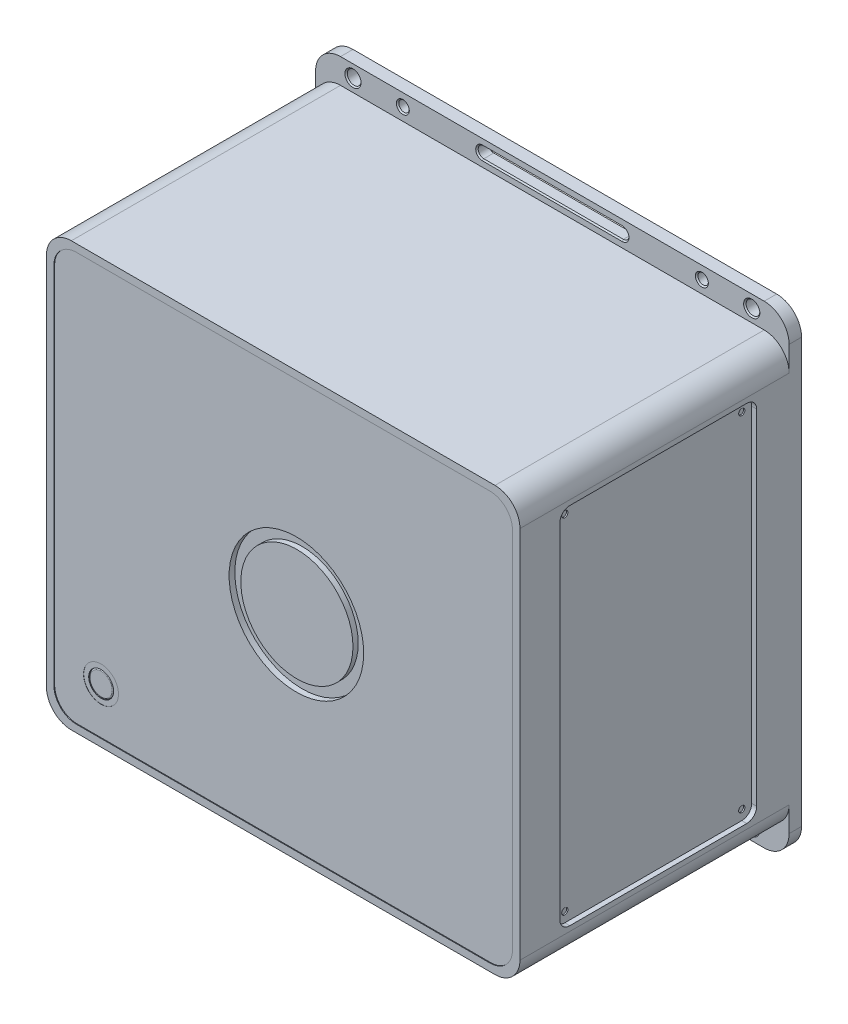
ISO-10303-21;
HEADER;
FILE_DESCRIPTION(('STEP AP214'),'2;1');
FILE_NAME('part.step','',(''),(''),'','','');
FILE_SCHEMA(('AUTOMOTIVE_DESIGN { 1 0 10303 214 1 1 1 1 }'));
ENDSEC;
DATA;
#1=APPLICATION_CONTEXT('core data for automotive mechanical design processes');
#2=APPLICATION_PROTOCOL_DEFINITION('international standard','automotive_design',2000,#1);
#3=PRODUCT_CONTEXT('',#1,'mechanical');
#4=PRODUCT('Part','Part','',(#3));
#5=PRODUCT_RELATED_PRODUCT_CATEGORY('part','',(#4));
#6=PRODUCT_DEFINITION_FORMATION('','',#4);
#7=PRODUCT_DEFINITION_CONTEXT('part definition',#1,'design');
#8=PRODUCT_DEFINITION('design','',#6,#7);
#9=PRODUCT_DEFINITION_SHAPE('','',#8);
#10=(LENGTH_UNIT() NAMED_UNIT(*) SI_UNIT(.MILLI.,.METRE.));
#11=(NAMED_UNIT(*) PLANE_ANGLE_UNIT() SI_UNIT($,.RADIAN.));
#12=(NAMED_UNIT(*) SI_UNIT($,.STERADIAN.) SOLID_ANGLE_UNIT());
#13=UNCERTAINTY_MEASURE_WITH_UNIT(LENGTH_MEASURE(1.E-05),#10,'distance_accuracy_value','');
#14=(GEOMETRIC_REPRESENTATION_CONTEXT(3) GLOBAL_UNCERTAINTY_ASSIGNED_CONTEXT((#13)) GLOBAL_UNIT_ASSIGNED_CONTEXT((#10,
#11,#12)) REPRESENTATION_CONTEXT('',''));
#15=CARTESIAN_POINT('',(0.,0.,0.));
#16=DIRECTION('',(0.,0.,1.));
#17=DIRECTION('',(1.,0.,0.));
#18=AXIS2_PLACEMENT_3D('',#15,#16,#17);
#19=CARTESIAN_POINT('',(0.,0.,112.64));
#20=DIRECTION('',(0.,0.,1.));
#21=DIRECTION('',(1.,0.,0.));
#22=AXIS2_PLACEMENT_3D('',#19,#20,#21);
#23=PLANE('',#22);
#24=CARTESIAN_POINT('',(-73.4,-63.4,112.64));
#25=DIRECTION('',(0.,0.,-1.));
#26=DIRECTION('',(-3.01004539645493E-10,-1.,0.));
#27=AXIS2_PLACEMENT_3D('',#24,#25,#26);
#28=CIRCLE('',#27,4.45);
#29=CARTESIAN_POINT('',(-73.4000000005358,-67.85,112.64));
#30=VERTEX_POINT('',#29);
#31=CARTESIAN_POINT('',(-73.4,-58.95,112.64));
#32=VERTEX_POINT('',#31);
#33=EDGE_CURVE('E1026',#30,#32,#28,.T.);
#34=ORIENTED_EDGE('',*,*,#33,.F.);
#35=CARTESIAN_POINT('',(-73.4,-58.95,112.64));
#36=CARTESIAN_POINT('',(-73.3086129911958,-58.9499853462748,112.640000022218));
#37=CARTESIAN_POINT('',(-73.2172501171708,-58.9527052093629,112.640000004));
#38=CARTESIAN_POINT('',(-73.0831903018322,-58.9608077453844,112.639999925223));
#39=CARTESIAN_POINT('',(-73.040359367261,-58.9640156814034,112.639999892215));
#40=CARTESIAN_POINT('',(-72.9255080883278,-58.9743008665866,112.639999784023));
#41=CARTESIAN_POINT('',(-72.8535858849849,-58.9825234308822,112.639999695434));
#42=CARTESIAN_POINT('',(-72.7309232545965,-58.9996317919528,112.639999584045));
#43=CARTESIAN_POINT('',(-72.6800580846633,-59.0076418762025,112.639999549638));
#44=CARTESIAN_POINT('',(-72.5797231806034,-59.0252554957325,112.639999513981));
#45=CARTESIAN_POINT('',(-72.5302468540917,-59.034821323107,112.639999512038));
#46=CARTESIAN_POINT('',(-72.433569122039,-59.0552458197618,112.639999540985));
#47=CARTESIAN_POINT('',(-72.3863540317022,-59.0660397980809,112.639999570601));
#48=CARTESIAN_POINT('',(-72.2933416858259,-59.0889378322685,112.639999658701));
#49=CARTESIAN_POINT('',(-72.2475360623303,-59.1010079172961,112.639999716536));
#50=CARTESIAN_POINT('',(-72.1525559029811,-59.1276702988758,112.639999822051));
#51=CARTESIAN_POINT('',(-72.1034167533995,-59.1423887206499,112.639999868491));
#52=CARTESIAN_POINT('',(-72.0046914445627,-59.1738081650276,112.639999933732));
#53=CARTESIAN_POINT('',(-71.9551160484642,-59.1905429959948,112.63999995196));
#54=CARTESIAN_POINT('',(-71.8564898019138,-59.2257716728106,112.639999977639));
#55=CARTESIAN_POINT('',(-71.8074400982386,-59.2442687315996,112.63999998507));
#56=CARTESIAN_POINT('',(-71.7090979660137,-59.2833379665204,112.639999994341));
#57=CARTESIAN_POINT('',(-71.6598185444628,-59.3039428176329,112.639999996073));
#58=CARTESIAN_POINT('',(-71.545970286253,-59.3539540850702,112.639999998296));
#59=CARTESIAN_POINT('',(-71.4816930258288,-59.384029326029,112.639999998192));
#60=CARTESIAN_POINT('',(-71.3835293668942,-59.4328428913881,112.639999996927));
#61=CARTESIAN_POINT('',(-71.3491100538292,-59.4505200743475,112.639999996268));
#62=CARTESIAN_POINT('',(-71.2660586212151,-59.4945544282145,112.639999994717));
#63=CARTESIAN_POINT('',(-71.2176724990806,-59.5213782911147,112.639999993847));
#64=CARTESIAN_POINT('',(-71.1219354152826,-59.5768114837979,112.639999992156));
#65=CARTESIAN_POINT('',(-71.074584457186,-59.6054208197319,112.639999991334));
#66=CARTESIAN_POINT('',(-70.9809824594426,-59.664386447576,112.639999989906));
#67=CARTESIAN_POINT('',(-70.9347314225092,-59.6947427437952,112.639999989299));
#68=CARTESIAN_POINT('',(-70.8433940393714,-59.7571596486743,112.639999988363));
#69=CARTESIAN_POINT('',(-70.7983076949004,-59.7892202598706,112.639999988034));
#70=CARTESIAN_POINT('',(-70.7093624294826,-59.8550012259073,112.639999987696));
#71=CARTESIAN_POINT('',(-70.6655035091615,-59.8887215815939,112.639999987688));
#72=CARTESIAN_POINT('',(-70.5790742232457,-59.9577750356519,112.639999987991));
#73=CARTESIAN_POINT('',(-70.5365038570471,-59.9931081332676,112.639999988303));
#74=CARTESIAN_POINT('',(-70.4527109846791,-60.0653378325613,112.63999998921));
#75=CARTESIAN_POINT('',(-70.4114884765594,-60.1022344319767,112.639999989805));
#76=CARTESIAN_POINT('',(-70.3304487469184,-60.1775397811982,112.639999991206));
#77=CARTESIAN_POINT('',(-70.2906315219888,-60.2159485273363,112.639999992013));
#78=CARTESIAN_POINT('',(-70.2130076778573,-60.293673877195,112.639999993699));
#79=CARTESIAN_POINT('',(-70.1751806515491,-60.332970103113,112.639999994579));
#80=CARTESIAN_POINT('',(-70.100998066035,-60.4129273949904,112.639999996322));
#81=CARTESIAN_POINT('',(-70.0646425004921,-60.4535884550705,112.639999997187));
#82=CARTESIAN_POINT('',(-69.9926718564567,-60.5371230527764,112.639999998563));
#83=CARTESIAN_POINT('',(-69.9570903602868,-60.5800255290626,112.639999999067));
#84=CARTESIAN_POINT('',(-69.8875624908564,-60.6671352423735,112.639999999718));
#85=CARTESIAN_POINT('',(-69.8536161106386,-60.7113424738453,112.639999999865));
#86=CARTESIAN_POINT('',(-69.7878659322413,-60.8003778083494,112.64000000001));
#87=CARTESIAN_POINT('',(-69.7560389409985,-60.8451887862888,112.640000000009));
#88=CARTESIAN_POINT('',(-69.6940652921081,-60.9359579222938,112.639999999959));
#89=CARTESIAN_POINT('',(-69.6639186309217,-60.9819160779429,112.63999999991));
#90=CARTESIAN_POINT('',(-69.6053469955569,-61.0749165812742,112.639999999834));
#91=CARTESIAN_POINT('',(-69.5769220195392,-61.1219589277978,112.639999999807));
#92=CARTESIAN_POINT('',(-69.5218325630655,-61.2170635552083,112.639999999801));
#93=CARTESIAN_POINT('',(-69.4951680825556,-61.2651258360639,112.639999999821));
#94=CARTESIAN_POINT('',(-69.4436364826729,-61.3622039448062,112.639999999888));
#95=CARTESIAN_POINT('',(-69.4187693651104,-61.4112197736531,112.639999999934));
#96=CARTESIAN_POINT('',(-69.3708652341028,-61.5101400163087,112.640000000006));
#97=CARTESIAN_POINT('',(-69.3478282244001,-61.5600444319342,112.640000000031));
#98=CARTESIAN_POINT('',(-69.3144743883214,-61.6359614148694,112.639999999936));
#99=CARTESIAN_POINT('',(-69.303466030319,-61.6616731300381,112.639999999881));
#100=CARTESIAN_POINT('',(-69.2633631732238,-61.757825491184,112.639999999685));
#101=CARTESIAN_POINT('',(-69.2358223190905,-61.8289250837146,112.639999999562));
#102=CARTESIAN_POINT('',(-69.1928757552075,-61.9487960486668,112.639999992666));
#103=CARTESIAN_POINT('',(-69.176460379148,-61.997210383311,112.639999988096));
#104=CARTESIAN_POINT('',(-69.1452981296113,-62.0945754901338,112.639999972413));
#105=CARTESIAN_POINT('',(-69.1305512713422,-62.1435262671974,112.639999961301));
#106=CARTESIAN_POINT('',(-69.1027402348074,-62.2419041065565,112.639999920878));
#107=CARTESIAN_POINT('',(-69.0896760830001,-62.2913311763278,112.639999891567));
#108=CARTESIAN_POINT('',(-69.0652597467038,-62.3906069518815,112.639999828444));
#109=CARTESIAN_POINT('',(-69.053907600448,-62.4404556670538,112.639999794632));
#110=CARTESIAN_POINT('',(-69.0338035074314,-62.5360933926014,112.639999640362));
#111=CARTESIAN_POINT('',(-69.0249105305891,-62.5818526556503,112.63999952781));
#112=CARTESIAN_POINT('',(-69.0118841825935,-62.6555901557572,112.63999948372));
#113=CARTESIAN_POINT('',(-69.0072547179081,-62.683481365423,112.63999949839));
#114=CARTESIAN_POINT('',(-68.9945877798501,-62.7646973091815,112.639999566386));
#115=CARTESIAN_POINT('',(-68.9872697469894,-62.8181350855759,112.639999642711));
#116=CARTESIAN_POINT('',(-68.9715241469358,-62.9511468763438,112.63999981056));
#117=CARTESIAN_POINT('',(-68.964271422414,-63.030863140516,112.639999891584));
#118=CARTESIAN_POINT('',(-68.9557823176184,-63.1635798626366,112.639999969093));
#119=CARTESIAN_POINT('',(-68.9533411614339,-63.2165072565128,112.63999998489));
#120=CARTESIAN_POINT('',(-68.950425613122,-63.3185071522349,112.639999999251));
#121=CARTESIAN_POINT('',(-68.9498193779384,-63.3675759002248,112.639999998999));
#122=CARTESIAN_POINT('',(-68.9502374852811,-63.4784957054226,112.639999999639));
#123=CARTESIAN_POINT('',(-68.9517278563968,-63.5403459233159,112.640000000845));
#124=CARTESIAN_POINT('',(-68.9560450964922,-63.6371493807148,112.639999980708));
#125=CARTESIAN_POINT('',(-68.9580129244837,-63.6721435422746,112.63999996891));
#126=CARTESIAN_POINT('',(-68.9638790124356,-63.7581245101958,112.6399999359));
#127=CARTESIAN_POINT('',(-68.9682487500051,-63.8090802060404,112.639999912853));
#128=CARTESIAN_POINT('',(-68.9787497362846,-63.9108097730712,112.639999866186));
#129=CARTESIAN_POINT('',(-68.984881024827,-63.9615836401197,112.639999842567));
#130=CARTESIAN_POINT('',(-68.9989009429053,-64.0628893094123,112.639999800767));
#131=CARTESIAN_POINT('',(-69.0067895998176,-64.113421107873,112.639999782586));
#132=CARTESIAN_POINT('',(-69.0243139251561,-64.2141812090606,112.639999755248));
#133=CARTESIAN_POINT('',(-69.0339496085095,-64.2644095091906,112.639999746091));
#134=CARTESIAN_POINT('',(-69.0549565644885,-64.3645019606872,112.639999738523));
#135=CARTESIAN_POINT('',(-69.066327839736,-64.4143661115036,112.639999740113));
#136=CARTESIAN_POINT('',(-69.090792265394,-64.5136699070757,112.639999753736));
#137=CARTESIAN_POINT('',(-69.1038854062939,-64.5631095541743,112.63999976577));
#138=CARTESIAN_POINT('',(-69.1317773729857,-64.6615046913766,112.639999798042));
#139=CARTESIAN_POINT('',(-69.1465761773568,-64.7104601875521,112.63999981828));
#140=CARTESIAN_POINT('',(-69.1778628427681,-64.8078273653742,112.639999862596));
#141=CARTESIAN_POINT('',(-69.1943506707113,-64.8562390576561,112.639999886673));
#142=CARTESIAN_POINT('',(-69.2288686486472,-64.9521234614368,112.639999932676));
#143=CARTESIAN_POINT('',(-69.2468870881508,-64.9996003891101,112.639999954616));
#144=CARTESIAN_POINT('',(-69.2845612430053,-65.0938988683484,112.639999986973));
#145=CARTESIAN_POINT('',(-69.3042169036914,-65.140720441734,112.63999999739));
#146=CARTESIAN_POINT('',(-69.3407299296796,-65.2237925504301,112.640000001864));
#147=CARTESIAN_POINT('',(-69.3572931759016,-65.2601731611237,112.639999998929));
#148=CARTESIAN_POINT('',(-69.4052321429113,-65.3618509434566,112.639999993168));
#149=CARTESIAN_POINT('',(-69.4377117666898,-65.4266336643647,112.639999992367));
#150=CARTESIAN_POINT('',(-69.4945189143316,-65.5333591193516,112.639999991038));
#151=CARTESIAN_POINT('',(-69.5179859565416,-65.5757637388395,112.639999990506));
#152=CARTESIAN_POINT('',(-69.5703574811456,-65.6668597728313,112.639999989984));
#153=CARTESIAN_POINT('',(-69.5995122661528,-65.7154077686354,112.639999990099));
#154=CARTESIAN_POINT('',(-69.6639847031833,-65.8182694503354,112.639999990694));
#155=CARTESIAN_POINT('',(-69.6995850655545,-65.8724060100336,112.639999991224));
#156=CARTESIAN_POINT('',(-69.7777449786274,-65.9857924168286,112.639999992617));
#157=CARTESIAN_POINT('',(-69.8206163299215,-66.0448276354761,112.639999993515));
#158=CARTESIAN_POINT('',(-69.914161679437,-66.1672012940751,112.639999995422));
#159=CARTESIAN_POINT('',(-69.9651720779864,-66.2302825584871,112.639999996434));
#160=CARTESIAN_POINT('',(-70.0758705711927,-66.3597717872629,112.639999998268));
#161=CARTESIAN_POINT('',(-70.1359154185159,-66.4258761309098,112.639999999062));
#162=CARTESIAN_POINT('',(-70.219486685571,-66.5124981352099,112.639999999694));
#163=CARTESIAN_POINT('',(-70.2413249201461,-66.5346634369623,112.639999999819));
#164=CARTESIAN_POINT('',(-70.2860865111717,-66.5791528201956,112.639999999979));
#165=CARTESIAN_POINT('',(-70.309023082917,-66.6014636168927,112.640000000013));
#166=CARTESIAN_POINT('',(-70.3836100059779,-66.6724654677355,112.639999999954));
#167=CARTESIAN_POINT('',(-70.4361979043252,-66.720179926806,112.639999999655));
#168=CARTESIAN_POINT('',(-70.5298859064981,-66.8011833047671,112.639999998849));
#169=CARTESIAN_POINT('',(-70.5704927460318,-66.8350460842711,112.639999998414));
#170=CARTESIAN_POINT('',(-70.6528888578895,-66.9013038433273,112.639999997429));
#171=CARTESIAN_POINT('',(-70.6946781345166,-66.9336988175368,112.639999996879));
#172=CARTESIAN_POINT('',(-70.7793846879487,-66.9969784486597,112.639999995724));
#173=CARTESIAN_POINT('',(-70.8223019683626,-67.0278631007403,112.639999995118));
#174=CARTESIAN_POINT('',(-70.9092103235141,-67.0880831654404,112.639999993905));
#175=CARTESIAN_POINT('',(-70.9532014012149,-67.1174185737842,112.639999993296));
#176=CARTESIAN_POINT('',(-71.0422013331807,-67.1745027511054,112.63999999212));
#177=CARTESIAN_POINT('',(-71.0872101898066,-67.2022515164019,112.639999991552));
#178=CARTESIAN_POINT('',(-71.1781884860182,-67.2561271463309,112.639999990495));
#179=CARTESIAN_POINT('',(-71.2241579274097,-67.2822540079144,112.639999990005));
#180=CARTESIAN_POINT('',(-71.3169989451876,-67.3328526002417,112.639999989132));
#181=CARTESIAN_POINT('',(-71.363870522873,-67.3573243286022,112.639999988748));
#182=CARTESIAN_POINT('',(-71.4584562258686,-67.4045815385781,112.639999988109));
#183=CARTESIAN_POINT('',(-71.5061703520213,-67.4273670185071,112.639999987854));
#184=CARTESIAN_POINT('',(-71.6023804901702,-67.4712227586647,112.639999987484));
#185=CARTESIAN_POINT('',(-71.6508765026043,-67.4922930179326,112.63999998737));
#186=CARTESIAN_POINT('',(-71.7485887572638,-67.5326915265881,112.639999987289));
#187=CARTESIAN_POINT('',(-71.7978049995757,-67.5520197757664,112.639999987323));
#188=CARTESIAN_POINT('',(-71.8968951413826,-67.5889096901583,112.639999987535));
#189=CARTESIAN_POINT('',(-71.9467690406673,-67.6064713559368,112.639999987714));
#190=CARTESIAN_POINT('',(-72.0471110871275,-67.6398057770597,112.639999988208));
#191=CARTESIAN_POINT('',(-72.0975792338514,-67.655578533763,112.639999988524));
#192=CARTESIAN_POINT('',(-72.1990456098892,-67.6853150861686,112.639999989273));
#193=CARTESIAN_POINT('',(-72.250043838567,-67.6992788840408,112.639999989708));
#194=CARTESIAN_POINT('',(-72.3525055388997,-67.72537976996,112.639999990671));
#195=CARTESIAN_POINT('',(-72.4039690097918,-67.737516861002,112.6399999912));
#196=CARTESIAN_POINT('',(-72.5072957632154,-67.7599489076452,112.63999999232));
#197=CARTESIAN_POINT('',(-72.5591590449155,-67.770243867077,112.639999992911));
#198=CARTESIAN_POINT('',(-72.6632194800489,-67.7889785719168,112.639999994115));
#199=CARTESIAN_POINT('',(-72.7154166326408,-67.7974183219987,112.639999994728));
#200=CARTESIAN_POINT('',(-72.8200784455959,-67.8124318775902,112.639999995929));
#201=CARTESIAN_POINT('',(-72.8725431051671,-67.8190056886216,112.639999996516));
#202=CARTESIAN_POINT('',(-72.9776732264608,-67.8302790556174,112.639999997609));
#203=CARTESIAN_POINT('',(-73.0303386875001,-67.8349786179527,112.639999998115));
#204=CARTESIAN_POINT('',(-73.1358034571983,-67.8424973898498,112.639999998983));
#205=CARTESIAN_POINT('',(-73.1886027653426,-67.8453166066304,112.639999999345));
#206=CARTESIAN_POINT('',(-73.2942680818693,-67.8490716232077,112.639999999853));
#207=CARTESIAN_POINT('',(-73.3471340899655,-67.8500074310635,112.639999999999));
#208=CARTESIAN_POINT('',(-73.4,-67.85,112.64));
#209=B_SPLINE_CURVE_WITH_KNOTS('',3,(#35,#36,#37,#38,#39,#40,#41,#42,#43,#44,#45,#46,#47,#48,
#49,#50,#51,#52,#53,#54,#55,#56,#57,#58,#59,#60,#61,#62,#63,#64,#65,#66,#67,#68,#69,#70,#71,#72,
#73,#74,#75,#76,#77,#78,#79,#80,#81,#82,#83,#84,#85,#86,#87,#88,#89,#90,#91,#92,#93,#94,#95,#96,
#97,#98,#99,#100,#101,#102,#103,#104,#105,#106,#107,#108,#109,#110,#111,#112,#113,#114,#115,
#116,#117,#118,#119,#120,#121,#122,#123,#124,#125,#126,#127,#128,#129,#130,#131,#132,#133,#134,
#135,#136,#137,#138,#139,#140,#141,#142,#143,#144,#145,#146,#147,#148,#149,#150,#151,#152,#153,
#154,#155,#156,#157,#158,#159,#160,#161,#162,#163,#164,#165,#166,#167,#168,#169,#170,#171,#172,
#173,#174,#175,#176,#177,#178,#179,#180,#181,#182,#183,#184,#185,#186,#187,#188,#189,#190,#191,
#192,#193,#194,#195,#196,#197,#198,#199,#200,#201,#202,#203,#204,#205,#206,#207,#208),
.UNSPECIFIED.,.F.,.F.,(4,2,2,2,2,2,2,2,2,2,2,2,2,2,2,2,2,2,2,2,2,2,2,2,2,2,2,2,2,2,2,2,2,2,2,2,
2,2,2,2,2,2,2,2,2,2,2,2,2,2,2,2,2,2,2,2,2,2,2,2,2,2,2,2,2,2,2,2,2,2,2,2,2,2,2,2,2,2,2,2,2,2,2,2,
2,2,4),(0.,0.274063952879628,0.402901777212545,0.619974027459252,0.774421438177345,
0.925568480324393,1.0708415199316,1.21292467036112,1.36678227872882,1.5237218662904,
1.68095327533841,1.84116351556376,2.05396806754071,2.17003805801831,2.33596811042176,
2.5018987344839,2.6678297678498,2.83376104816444,2.99969241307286,3.16562370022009,
3.33155474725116,3.4974853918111,3.66108133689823,3.82467657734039,3.99184958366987,
4.15902187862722,4.32387466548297,4.4887271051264,4.6535793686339,4.81843162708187,
4.98328405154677,5.14813681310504,5.23204199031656,5.46066458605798,5.61400373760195,
5.76734428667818,5.92068724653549,6.07403363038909,6.21385395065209,6.2986672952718,
6.46044168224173,6.70044888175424,6.85936986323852,7.00656331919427,7.19211003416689,
7.29725081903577,7.45064555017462,7.60404375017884,7.75744434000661,7.91084624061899,
8.06424837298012,8.21764965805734,8.3710490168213,8.52444537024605,8.67675875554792,
8.8290670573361,8.94897749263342,9.16628445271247,9.31165749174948,9.4815037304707,
9.67582217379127,9.89461176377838,10.1378713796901,10.4055998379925,10.4989431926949,
10.5949304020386,10.8078614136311,10.9664516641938,11.1250424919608,11.2836338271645,
11.4422256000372,11.6008177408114,11.7594101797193,11.9180028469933,12.076595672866,
12.2351885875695,12.3937815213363,12.5523744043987,12.7109671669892,12.8695597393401,
13.0281520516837,13.1867440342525,13.3453356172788,13.5039267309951,13.6625173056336,
13.8211072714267,13.9796965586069),.UNSPECIFIED.);
#210=EDGE_CURVE('E294',#32,#30,#209,.T.);
#211=ORIENTED_EDGE('',*,*,#210,.F.);
#212=EDGE_LOOP('',(#34,#211));
#213=FACE_BOUND('',#212,.T.);
#214=ADVANCED_FACE('F16',(#213),#23,.T.);
#215=CARTESIAN_POINT('',(-73.4,-63.4,112.14));
#216=DIRECTION('',(0.,0.,1.));
#217=DIRECTION('',(0.09042323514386,0.995903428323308,0.));
#218=AXIS2_PLACEMENT_3D('',#215,#216,#217);
#219=TOROIDAL_SURFACE('',#218,4.45,0.5);
#220=CARTESIAN_POINT('',(-73.4,-63.4,112.14));
#221=DIRECTION('',(0.,0.,1.));
#222=DIRECTION('',(1.,0.,0.));
#223=AXIS2_PLACEMENT_3D('',#220,#221,#222);
#224=CIRCLE('',#223,4.95);
#225=CARTESIAN_POINT('',(-68.45,-63.4,112.14));
#226=VERTEX_POINT('',#225);
#227=EDGE_CURVE('E816',#226,#226,#224,.F.);
#228=ORIENTED_EDGE('',*,*,#227,.F.);
#229=EDGE_LOOP('',(#228));
#230=FACE_BOUND('',#229,.T.);
#231=ORIENTED_EDGE('',*,*,#33,.T.);
#232=ORIENTED_EDGE('',*,*,#210,.T.);
#233=EDGE_LOOP('',(#231,#232));
#234=FACE_BOUND('',#233,.T.);
#235=ADVANCED_FACE('F818',(#230,#234),#219,.T.);
#236=CARTESIAN_POINT('',(-73.4,-63.4,110.4));
#237=DIRECTION('',(0.,0.,1.));
#238=DIRECTION('',(1.,0.,0.));
#239=AXIS2_PLACEMENT_3D('',#236,#237,#238);
#240=CYLINDRICAL_SURFACE('',#239,4.95);
#241=CARTESIAN_POINT('',(-73.4,-63.4,110.4));
#242=DIRECTION('',(0.,0.,1.));
#243=DIRECTION('',(1.,0.,0.));
#244=AXIS2_PLACEMENT_3D('',#241,#242,#243);
#245=CIRCLE('',#244,4.95);
#246=CARTESIAN_POINT('',(-68.45,-63.4,110.4));
#247=VERTEX_POINT('',#246);
#248=EDGE_CURVE('E1021',#247,#247,#245,.F.);
#249=ORIENTED_EDGE('',*,*,#248,.F.);
#250=EDGE_LOOP('',(#249));
#251=FACE_BOUND('',#250,.T.);
#252=ORIENTED_EDGE('',*,*,#227,.T.);
#253=EDGE_LOOP('',(#252));
#254=FACE_BOUND('',#253,.T.);
#255=ADVANCED_FACE('F822',(#251,#254),#240,.T.);
#256=CARTESIAN_POINT('',(0.,0.,112.5));
#257=DIRECTION('',(0.,0.,1.));
#258=DIRECTION('',(1.,0.,0.));
#259=AXIS2_PLACEMENT_3D('',#256,#257,#258);
#260=PLANE('',#259);
#261=CARTESIAN_POINT('',(5.,0.,112.5));
#262=DIRECTION('',(0.,0.,1.));
#263=DIRECTION('',(1.,0.,0.));
#264=AXIS2_PLACEMENT_3D('',#261,#262,#263);
#265=CIRCLE('',#264,22.5);
#266=CARTESIAN_POINT('',(27.5,0.,112.5));
#267=VERTEX_POINT('',#266);
#268=EDGE_CURVE('E1018',#267,#267,#265,.F.);
#269=ORIENTED_EDGE('',*,*,#268,.F.);
#270=EDGE_LOOP('',(#269));
#271=FACE_BOUND('',#270,.T.);
#272=ADVANCED_FACE('F1611',(#271),#260,.T.);
#273=CARTESIAN_POINT('',(0.,0.,110.4));
#274=DIRECTION('',(0.,0.,1.));
#275=DIRECTION('',(1.,0.,0.));
#276=AXIS2_PLACEMENT_3D('',#273,#274,#275);
#277=PLANE('',#276);
#278=ORIENTED_EDGE('',*,*,#248,.T.);
#279=EDGE_LOOP('',(#278));
#280=FACE_BOUND('',#279,.T.);
#281=CARTESIAN_POINT('',(-73.4,-63.4,110.4));
#282=DIRECTION('',(0.,0.,1.));
#283=DIRECTION('',(1.,0.,0.));
#284=AXIS2_PLACEMENT_3D('',#281,#282,#283);
#285=CIRCLE('',#284,5.);
#286=CARTESIAN_POINT('',(-68.4,-63.4,110.4));
#287=VERTEX_POINT('',#286);
#288=EDGE_CURVE('E1015',#287,#287,#285,.T.);
#289=ORIENTED_EDGE('',*,*,#288,.T.);
#290=EDGE_LOOP('',(#289));
#291=FACE_BOUND('',#290,.T.);
#292=ADVANCED_FACE('F1608',(#280,#291),#277,.T.);
#293=CARTESIAN_POINT('',(5.,0.,110.4));
#294=DIRECTION('',(0.,0.,1.));
#295=DIRECTION('',(1.,0.,0.));
#296=AXIS2_PLACEMENT_3D('',#293,#294,#295);
#297=CYLINDRICAL_SURFACE('',#296,22.5);
#298=ORIENTED_EDGE('',*,*,#268,.T.);
#299=EDGE_LOOP('',(#298));
#300=FACE_BOUND('',#299,.T.);
#301=CARTESIAN_POINT('',(5.,0.,110.4));
#302=DIRECTION('',(0.,0.,1.));
#303=DIRECTION('',(1.,0.,0.));
#304=AXIS2_PLACEMENT_3D('',#301,#302,#303);
#305=CIRCLE('',#304,22.5);
#306=CARTESIAN_POINT('',(27.5,0.,110.4));
#307=VERTEX_POINT('',#306);
#308=EDGE_CURVE('E1012',#307,#307,#305,.F.);
#309=ORIENTED_EDGE('',*,*,#308,.F.);
#310=EDGE_LOOP('',(#309));
#311=FACE_BOUND('',#310,.T.);
#312=ADVANCED_FACE('F1604',(#300,#311),#297,.T.);
#313=CARTESIAN_POINT('',(-73.4,-63.4,110.4));
#314=DIRECTION('',(0.,0.,1.));
#315=DIRECTION('',(1.,0.,0.));
#316=AXIS2_PLACEMENT_3D('',#313,#314,#315);
#317=CYLINDRICAL_SURFACE('',#316,5.);
#318=ORIENTED_EDGE('',*,*,#288,.F.);
#319=EDGE_LOOP('',(#318));
#320=FACE_BOUND('',#319,.T.);
#321=CARTESIAN_POINT('',(-73.4,-63.4,112.64));
#322=DIRECTION('',(0.,0.,1.));
#323=DIRECTION('',(1.,0.,0.));
#324=AXIS2_PLACEMENT_3D('',#321,#322,#323);
#325=CIRCLE('',#324,5.);
#326=CARTESIAN_POINT('',(-68.4,-63.4,112.64));
#327=VERTEX_POINT('',#326);
#328=EDGE_CURVE('E1009',#327,#327,#325,.F.);
#329=ORIENTED_EDGE('',*,*,#328,.F.);
#330=EDGE_LOOP('',(#329));
#331=FACE_BOUND('',#330,.T.);
#332=ADVANCED_FACE('F1600',(#320,#331),#317,.F.);
#333=CARTESIAN_POINT('',(0.,0.,110.4));
#334=DIRECTION('',(0.,0.,1.));
#335=DIRECTION('',(1.,0.,0.));
#336=AXIS2_PLACEMENT_3D('',#333,#334,#335);
#337=PLANE('',#336);
#338=ORIENTED_EDGE('',*,*,#308,.T.);
#339=EDGE_LOOP('',(#338));
#340=FACE_BOUND('',#339,.T.);
#341=CARTESIAN_POINT('',(5.,0.,110.4));
#342=DIRECTION('',(0.,0.,1.));
#343=DIRECTION('',(1.,0.,0.));
#344=AXIS2_PLACEMENT_3D('',#341,#342,#343);
#345=CIRCLE('',#344,27.);
#346=CARTESIAN_POINT('',(32.,0.,110.4));
#347=VERTEX_POINT('',#346);
#348=EDGE_CURVE('E1006',#347,#347,#345,.T.);
#349=ORIENTED_EDGE('',*,*,#348,.T.);
#350=EDGE_LOOP('',(#349));
#351=FACE_BOUND('',#350,.T.);
#352=ADVANCED_FACE('F1596',(#340,#351),#337,.T.);
#353=CARTESIAN_POINT('',(0.,0.,112.64));
#354=DIRECTION('',(0.,0.,1.));
#355=DIRECTION('',(1.,0.,0.));
#356=AXIS2_PLACEMENT_3D('',#353,#354,#355);
#357=PLANE('',#356);
#358=ORIENTED_EDGE('',*,*,#328,.T.);
#359=EDGE_LOOP('',(#358));
#360=FACE_BOUND('',#359,.T.);
#361=CARTESIAN_POINT('',(-73.4,-63.4,112.64));
#362=DIRECTION('',(0.,0.,1.));
#363=DIRECTION('',(1.,0.,0.));
#364=AXIS2_PLACEMENT_3D('',#361,#362,#363);
#365=CIRCLE('',#364,7.);
#366=CARTESIAN_POINT('',(-66.4,-63.4,112.64));
#367=VERTEX_POINT('',#366);
#368=EDGE_CURVE('E1003',#367,#367,#365,.T.);
#369=ORIENTED_EDGE('',*,*,#368,.T.);
#370=EDGE_LOOP('',(#369));
#371=FACE_BOUND('',#370,.T.);
#372=ADVANCED_FACE('F1592',(#360,#371),#357,.T.);
#373=CARTESIAN_POINT('',(92.5,78.,0.));
#374=DIRECTION('',(1.,0.,0.));
#375=DIRECTION('',(0.,0.,-1.));
#376=AXIS2_PLACEMENT_3D('',#373,#374,#375);
#377=PLANE('',#376);
#378=CARTESIAN_POINT('',(92.5,69.,22.));
#379=DIRECTION('',(1.,0.,0.));
#380=DIRECTION('',(0.,0.,-1.));
#381=AXIS2_PLACEMENT_3D('',#378,#379,#380);
#382=CIRCLE('',#381,1.25);
#383=CARTESIAN_POINT('',(92.5,69.,20.75));
#384=VERTEX_POINT('',#383);
#385=EDGE_CURVE('E1000',#384,#384,#382,.T.);
#386=ORIENTED_EDGE('',*,*,#385,.T.);
#387=EDGE_LOOP('',(#386));
#388=FACE_BOUND('',#387,.T.);
#389=ADVANCED_FACE('F1588',(#388),#377,.T.);
#390=CARTESIAN_POINT('',(92.5,78.,0.));
#391=DIRECTION('',(1.,0.,0.));
#392=DIRECTION('',(0.,0.,-1.));
#393=AXIS2_PLACEMENT_3D('',#390,#391,#392);
#394=PLANE('',#393);
#395=CARTESIAN_POINT('',(92.5,-69.,22.));
#396=DIRECTION('',(1.,0.,0.));
#397=DIRECTION('',(0.,0.,-1.));
#398=AXIS2_PLACEMENT_3D('',#395,#396,#397);
#399=CIRCLE('',#398,1.25);
#400=CARTESIAN_POINT('',(92.5,-69.,20.75));
#401=VERTEX_POINT('',#400);
#402=EDGE_CURVE('E997',#401,#401,#399,.T.);
#403=ORIENTED_EDGE('',*,*,#402,.T.);
#404=EDGE_LOOP('',(#403));
#405=FACE_BOUND('',#404,.T.);
#406=ADVANCED_FACE('F1584',(#405),#394,.T.);
#407=CARTESIAN_POINT('',(92.5,78.,0.));
#408=DIRECTION('',(1.,0.,0.));
#409=DIRECTION('',(0.,0.,-1.));
#410=AXIS2_PLACEMENT_3D('',#407,#408,#409);
#411=PLANE('',#410);
#412=CARTESIAN_POINT('',(92.5,69.,93.));
#413=DIRECTION('',(1.,0.,0.));
#414=DIRECTION('',(0.,0.,-1.));
#415=AXIS2_PLACEMENT_3D('',#412,#413,#414);
#416=CIRCLE('',#415,1.25);
#417=CARTESIAN_POINT('',(92.5,69.,91.75));
#418=VERTEX_POINT('',#417);
#419=EDGE_CURVE('E994',#418,#418,#416,.T.);
#420=ORIENTED_EDGE('',*,*,#419,.T.);
#421=EDGE_LOOP('',(#420));
#422=FACE_BOUND('',#421,.T.);
#423=ADVANCED_FACE('F1580',(#422),#411,.T.);
#424=CARTESIAN_POINT('',(92.5,78.,0.));
#425=DIRECTION('',(1.,0.,0.));
#426=DIRECTION('',(0.,0.,-1.));
#427=AXIS2_PLACEMENT_3D('',#424,#425,#426);
#428=PLANE('',#427);
#429=CARTESIAN_POINT('',(92.5,-69.,93.));
#430=DIRECTION('',(1.,0.,0.));
#431=DIRECTION('',(0.,0.,-1.));
#432=AXIS2_PLACEMENT_3D('',#429,#430,#431);
#433=CIRCLE('',#432,1.25);
#434=CARTESIAN_POINT('',(92.5,-69.,91.75));
#435=VERTEX_POINT('',#434);
#436=EDGE_CURVE('E991',#435,#435,#433,.T.);
#437=ORIENTED_EDGE('',*,*,#436,.T.);
#438=EDGE_LOOP('',(#437));
#439=FACE_BOUND('',#438,.T.);
#440=ADVANCED_FACE('F1576',(#439),#428,.T.);
#441=CARTESIAN_POINT('',(5.,0.,110.4));
#442=DIRECTION('',(0.,0.,1.));
#443=DIRECTION('',(1.,0.,0.));
#444=AXIS2_PLACEMENT_3D('',#441,#442,#443);
#445=CYLINDRICAL_SURFACE('',#444,27.);
#446=CARTESIAN_POINT('',(5.,0.,112.7));
#447=DIRECTION('',(0.,0.,1.));
#448=DIRECTION('',(1.,0.,0.));
#449=AXIS2_PLACEMENT_3D('',#446,#447,#448);
#450=CIRCLE('',#449,27.);
#451=CARTESIAN_POINT('',(32.,0.,112.7));
#452=VERTEX_POINT('',#451);
#453=EDGE_CURVE('E988',#452,#452,#450,.F.);
#454=ORIENTED_EDGE('',*,*,#453,.F.);
#455=EDGE_LOOP('',(#454));
#456=FACE_BOUND('',#455,.T.);
#457=ORIENTED_EDGE('',*,*,#348,.F.);
#458=EDGE_LOOP('',(#457));
#459=FACE_BOUND('',#458,.T.);
#460=ADVANCED_FACE('F1572',(#456,#459),#445,.F.);
#461=CARTESIAN_POINT('',(-73.4,-63.4,112.7));
#462=DIRECTION('',(0.,0.,1.));
#463=DIRECTION('',(1.,0.,0.));
#464=AXIS2_PLACEMENT_3D('',#461,#462,#463);
#465=CYLINDRICAL_SURFACE('',#464,7.);
#466=ORIENTED_EDGE('',*,*,#368,.F.);
#467=EDGE_LOOP('',(#466));
#468=FACE_BOUND('',#467,.T.);
#469=CARTESIAN_POINT('',(-73.4,-63.4,112.7));
#470=DIRECTION('',(0.,0.,1.));
#471=DIRECTION('',(1.,0.,0.));
#472=AXIS2_PLACEMENT_3D('',#469,#470,#471);
#473=CIRCLE('',#472,7.);
#474=CARTESIAN_POINT('',(-66.4,-63.4,112.7));
#475=VERTEX_POINT('',#474);
#476=EDGE_CURVE('E985',#475,#475,#473,.F.);
#477=ORIENTED_EDGE('',*,*,#476,.F.);
#478=EDGE_LOOP('',(#477));
#479=FACE_BOUND('',#478,.T.);
#480=ADVANCED_FACE('F1568',(#468,#479),#465,.F.);
#481=CARTESIAN_POINT('',(84.33637043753,69.,22.));
#482=DIRECTION('',(1.,0.,0.));
#483=DIRECTION('',(0.,0.,-1.));
#484=AXIS2_PLACEMENT_3D('',#481,#482,#483);
#485=CYLINDRICAL_SURFACE('',#484,1.25);
#486=CARTESIAN_POINT('',(93.,69.,22.));
#487=DIRECTION('',(1.,0.,0.));
#488=DIRECTION('',(0.,0.,-1.));
#489=AXIS2_PLACEMENT_3D('',#486,#487,#488);
#490=CIRCLE('',#489,1.25);
#491=CARTESIAN_POINT('',(93.,69.,20.75));
#492=VERTEX_POINT('',#491);
#493=EDGE_CURVE('E982',#492,#492,#490,.F.);
#494=ORIENTED_EDGE('',*,*,#493,.F.);
#495=EDGE_LOOP('',(#494));
#496=FACE_BOUND('',#495,.T.);
#497=ORIENTED_EDGE('',*,*,#385,.F.);
#498=EDGE_LOOP('',(#497));
#499=FACE_BOUND('',#498,.T.);
#500=ADVANCED_FACE('F1564',(#496,#499),#485,.F.);
#501=CARTESIAN_POINT('',(84.33637043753,-69.,22.));
#502=DIRECTION('',(1.,0.,0.));
#503=DIRECTION('',(0.,0.,-1.));
#504=AXIS2_PLACEMENT_3D('',#501,#502,#503);
#505=CYLINDRICAL_SURFACE('',#504,1.25);
#506=CARTESIAN_POINT('',(93.,-69.,22.));
#507=DIRECTION('',(1.,0.,0.));
#508=DIRECTION('',(0.,0.,-1.));
#509=AXIS2_PLACEMENT_3D('',#506,#507,#508);
#510=CIRCLE('',#509,1.25);
#511=CARTESIAN_POINT('',(93.,-69.,20.75));
#512=VERTEX_POINT('',#511);
#513=EDGE_CURVE('E979',#512,#512,#510,.F.);
#514=ORIENTED_EDGE('',*,*,#513,.F.);
#515=EDGE_LOOP('',(#514));
#516=FACE_BOUND('',#515,.T.);
#517=ORIENTED_EDGE('',*,*,#402,.F.);
#518=EDGE_LOOP('',(#517));
#519=FACE_BOUND('',#518,.T.);
#520=ADVANCED_FACE('F1560',(#516,#519),#505,.F.);
#521=CARTESIAN_POINT('',(84.33637043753,69.,93.));
#522=DIRECTION('',(1.,0.,0.));
#523=DIRECTION('',(0.,0.,-1.));
#524=AXIS2_PLACEMENT_3D('',#521,#522,#523);
#525=CYLINDRICAL_SURFACE('',#524,1.25);
#526=CARTESIAN_POINT('',(93.,69.,93.));
#527=DIRECTION('',(1.,0.,0.));
#528=DIRECTION('',(0.,0.,-1.));
#529=AXIS2_PLACEMENT_3D('',#526,#527,#528);
#530=CIRCLE('',#529,1.25);
#531=CARTESIAN_POINT('',(93.,69.,91.75));
#532=VERTEX_POINT('',#531);
#533=EDGE_CURVE('E976',#532,#532,#530,.F.);
#534=ORIENTED_EDGE('',*,*,#533,.F.);
#535=EDGE_LOOP('',(#534));
#536=FACE_BOUND('',#535,.T.);
#537=ORIENTED_EDGE('',*,*,#419,.F.);
#538=EDGE_LOOP('',(#537));
#539=FACE_BOUND('',#538,.T.);
#540=ADVANCED_FACE('F1556',(#536,#539),#525,.F.);
#541=CARTESIAN_POINT('',(84.33637043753,-69.,93.));
#542=DIRECTION('',(1.,0.,0.));
#543=DIRECTION('',(0.,0.,-1.));
#544=AXIS2_PLACEMENT_3D('',#541,#542,#543);
#545=CYLINDRICAL_SURFACE('',#544,1.25);
#546=CARTESIAN_POINT('',(93.,-69.,93.));
#547=DIRECTION('',(1.,0.,0.));
#548=DIRECTION('',(0.,0.,-1.));
#549=AXIS2_PLACEMENT_3D('',#546,#547,#548);
#550=CIRCLE('',#549,1.25);
#551=CARTESIAN_POINT('',(93.,-69.,91.75));
#552=VERTEX_POINT('',#551);
#553=EDGE_CURVE('E807',#552,#552,#550,.F.);
#554=ORIENTED_EDGE('',*,*,#553,.F.);
#555=EDGE_LOOP('',(#554));
#556=FACE_BOUND('',#555,.T.);
#557=ORIENTED_EDGE('',*,*,#436,.F.);
#558=EDGE_LOOP('',(#557));
#559=FACE_BOUND('',#558,.T.);
#560=ADVANCED_FACE('F1552',(#556,#559),#545,.F.);
#561=CARTESIAN_POINT('',(0.,0.,112.7));
#562=DIRECTION('',(0.,0.,1.));
#563=DIRECTION('',(1.,0.,0.));
#564=AXIS2_PLACEMENT_3D('',#561,#562,#563);
#565=PLANE('',#564);
#566=ORIENTED_EDGE('',*,*,#476,.T.);
#567=EDGE_LOOP('',(#566));
#568=FACE_BOUND('',#567,.T.);
#569=ORIENTED_EDGE('',*,*,#453,.T.);
#570=EDGE_LOOP('',(#569));
#571=FACE_BOUND('',#570,.T.);
#572=DIRECTION('',(0.,1.,0.));
#573=VECTOR('',#572,1.);
#574=CARTESIAN_POINT('',(92.,-73.,112.7));
#575=LINE('',#574,#573);
#576=CARTESIAN_POINT('',(92.,-73.,112.7));
#577=VERTEX_POINT('',#576);
#578=CARTESIAN_POINT('',(92.,73.,112.7));
#579=VERTEX_POINT('',#578);
#580=EDGE_CURVE('E289',#577,#579,#575,.T.);
#581=ORIENTED_EDGE('',*,*,#580,.T.);
#582=CARTESIAN_POINT('',(83.,73.,112.7));
#583=DIRECTION('',(0.,0.,1.));
#584=DIRECTION('',(1.,0.,0.));
#585=AXIS2_PLACEMENT_3D('',#582,#583,#584);
#586=CIRCLE('',#585,9.);
#587=CARTESIAN_POINT('',(83.,82.,112.7));
#588=VERTEX_POINT('',#587);
#589=EDGE_CURVE('E775',#579,#588,#586,.T.);
#590=ORIENTED_EDGE('',*,*,#589,.T.);
#591=DIRECTION('',(1.,0.,0.));
#592=VECTOR('',#591,1.);
#593=CARTESIAN_POINT('',(83.,82.,112.7));
#594=LINE('',#593,#592);
#595=CARTESIAN_POINT('',(-83.,82.,112.7));
#596=VERTEX_POINT('',#595);
#597=EDGE_CURVE('E780',#588,#596,#594,.F.);
#598=ORIENTED_EDGE('',*,*,#597,.T.);
#599=CARTESIAN_POINT('',(-83.,73.,112.7));
#600=DIRECTION('',(0.,0.,1.));
#601=DIRECTION('',(1.,0.,0.));
#602=AXIS2_PLACEMENT_3D('',#599,#600,#601);
#603=CIRCLE('',#602,9.);
#604=CARTESIAN_POINT('',(-92.,73.,112.7));
#605=VERTEX_POINT('',#604);
#606=EDGE_CURVE('E784',#596,#605,#603,.T.);
#607=ORIENTED_EDGE('',*,*,#606,.T.);
#608=DIRECTION('',(0.,1.,0.));
#609=VECTOR('',#608,1.);
#610=CARTESIAN_POINT('',(-92.,73.,112.7));
#611=LINE('',#610,#609);
#612=CARTESIAN_POINT('',(-92.,-73.,112.7));
#613=VERTEX_POINT('',#612);
#614=EDGE_CURVE('E788',#605,#613,#611,.F.);
#615=ORIENTED_EDGE('',*,*,#614,.T.);
#616=CARTESIAN_POINT('',(-83.,-73.,112.7));
#617=DIRECTION('',(0.,0.,1.));
#618=DIRECTION('',(1.,0.,0.));
#619=AXIS2_PLACEMENT_3D('',#616,#617,#618);
#620=CIRCLE('',#619,9.);
#621=CARTESIAN_POINT('',(-83.,-82.,112.7));
#622=VERTEX_POINT('',#621);
#623=EDGE_CURVE('E792',#613,#622,#620,.T.);
#624=ORIENTED_EDGE('',*,*,#623,.T.);
#625=DIRECTION('',(1.,0.,0.));
#626=VECTOR('',#625,1.);
#627=CARTESIAN_POINT('',(-83.,-82.,112.7));
#628=LINE('',#627,#626);
#629=CARTESIAN_POINT('',(83.,-82.,112.7));
#630=VERTEX_POINT('',#629);
#631=EDGE_CURVE('E795',#622,#630,#628,.T.);
#632=ORIENTED_EDGE('',*,*,#631,.T.);
#633=CARTESIAN_POINT('',(83.,-73.,112.7));
#634=DIRECTION('',(0.,0.,1.));
#635=DIRECTION('',(1.,0.,0.));
#636=AXIS2_PLACEMENT_3D('',#633,#634,#635);
#637=CIRCLE('',#636,9.);
#638=EDGE_CURVE('E281',#630,#577,#637,.T.);
#639=ORIENTED_EDGE('',*,*,#638,.T.);
#640=EDGE_LOOP('',(#581,#590,#598,#607,#615,#624,#632,#639));
#641=FACE_BOUND('',#640,.T.);
#642=ADVANCED_FACE('F1548',(#568,#571,#641),#565,.T.);
#643=CARTESIAN_POINT('',(93.,0.,0.));
#644=DIRECTION('',(1.,0.,0.));
#645=DIRECTION('',(0.,0.,-1.));
#646=AXIS2_PLACEMENT_3D('',#643,#644,#645);
#647=PLANE('',#646);
#648=ORIENTED_EDGE('',*,*,#553,.T.);
#649=EDGE_LOOP('',(#648));
#650=FACE_BOUND('',#649,.T.);
#651=ORIENTED_EDGE('',*,*,#533,.T.);
#652=EDGE_LOOP('',(#651));
#653=FACE_BOUND('',#652,.T.);
#654=ORIENTED_EDGE('',*,*,#513,.T.);
#655=EDGE_LOOP('',(#654));
#656=FACE_BOUND('',#655,.T.);
#657=ORIENTED_EDGE('',*,*,#493,.T.);
#658=EDGE_LOOP('',(#657));
#659=FACE_BOUND('',#658,.T.);
#660=DIRECTION('',(0.,1.,0.));
#661=VECTOR('',#660,1.);
#662=CARTESIAN_POINT('',(93.,73.,97.));
#663=LINE('',#662,#661);
#664=CARTESIAN_POINT('',(93.,69.,97.));
#665=VERTEX_POINT('',#664);
#666=CARTESIAN_POINT('',(93.,-69.,97.));
#667=VERTEX_POINT('',#666);
#668=EDGE_CURVE('E584',#665,#667,#663,.F.);
#669=ORIENTED_EDGE('',*,*,#668,.T.);
#670=CARTESIAN_POINT('',(93.,-69.,93.));
#671=DIRECTION('',(-1.,0.,0.));
#672=DIRECTION('',(0.,0.,1.));
#673=AXIS2_PLACEMENT_3D('',#670,#671,#672);
#674=CIRCLE('',#673,4.);
#675=CARTESIAN_POINT('',(93.,-73.,93.));
#676=VERTEX_POINT('',#675);
#677=EDGE_CURVE('E588',#667,#676,#674,.F.);
#678=ORIENTED_EDGE('',*,*,#677,.T.);
#679=DIRECTION('',(0.,0.,-1.));
#680=VECTOR('',#679,1.);
#681=CARTESIAN_POINT('',(93.,-73.,97.));
#682=LINE('',#681,#680);
#683=CARTESIAN_POINT('',(93.,-73.,22.));
#684=VERTEX_POINT('',#683);
#685=EDGE_CURVE('E592',#676,#684,#682,.T.);
#686=ORIENTED_EDGE('',*,*,#685,.T.);
#687=CARTESIAN_POINT('',(93.,-69.,22.));
#688=DIRECTION('',(-1.,0.,0.));
#689=DIRECTION('',(0.,0.,1.));
#690=AXIS2_PLACEMENT_3D('',#687,#688,#689);
#691=CIRCLE('',#690,4.);
#692=CARTESIAN_POINT('',(93.,-69.,18.));
#693=VERTEX_POINT('',#692);
#694=EDGE_CURVE('E596',#684,#693,#691,.F.);
#695=ORIENTED_EDGE('',*,*,#694,.T.);
#696=DIRECTION('',(0.,1.,0.));
#697=VECTOR('',#696,1.);
#698=CARTESIAN_POINT('',(93.,-73.,18.));
#699=LINE('',#698,#697);
#700=CARTESIAN_POINT('',(93.,69.,18.));
#701=VERTEX_POINT('',#700);
#702=EDGE_CURVE('E600',#693,#701,#699,.T.);
#703=ORIENTED_EDGE('',*,*,#702,.T.);
#704=CARTESIAN_POINT('',(93.,69.,22.));
#705=DIRECTION('',(-1.,0.,0.));
#706=DIRECTION('',(0.,0.,1.));
#707=AXIS2_PLACEMENT_3D('',#704,#705,#706);
#708=CIRCLE('',#707,4.);
#709=CARTESIAN_POINT('',(93.,73.,22.));
#710=VERTEX_POINT('',#709);
#711=EDGE_CURVE('E601',#701,#710,#708,.F.);
#712=ORIENTED_EDGE('',*,*,#711,.T.);
#713=DIRECTION('',(0.,0.,1.));
#714=VECTOR('',#713,1.);
#715=CARTESIAN_POINT('',(93.,73.,18.));
#716=LINE('',#715,#714);
#717=CARTESIAN_POINT('',(93.,73.,93.));
#718=VERTEX_POINT('',#717);
#719=EDGE_CURVE('E577',#710,#718,#716,.T.);
#720=ORIENTED_EDGE('',*,*,#719,.T.);
#721=CARTESIAN_POINT('',(93.,69.,93.));
#722=DIRECTION('',(-1.,0.,0.));
#723=DIRECTION('',(0.,0.,1.));
#724=AXIS2_PLACEMENT_3D('',#721,#722,#723);
#725=CIRCLE('',#724,4.);
#726=EDGE_CURVE('E580',#718,#665,#725,.F.);
#727=ORIENTED_EDGE('',*,*,#726,.T.);
#728=EDGE_LOOP('',(#669,#678,#686,#695,#703,#712,#720,#727));
#729=FACE_BOUND('',#728,.T.);
#730=ADVANCED_FACE('F1545',(#650,#653,#656,#659,#729),#647,.T.);
#731=CARTESIAN_POINT('',(92.,-73.,113.));
#732=DIRECTION('',(1.,0.,0.));
#733=DIRECTION('',(0.,0.,-1.));
#734=AXIS2_PLACEMENT_3D('',#731,#732,#733);
#735=PLANE('',#734);
#736=DIRECTION('',(0.,1.,0.));
#737=VECTOR('',#736,1.);
#738=CARTESIAN_POINT('',(92.,0.,113.));
#739=LINE('',#738,#737);
#740=CARTESIAN_POINT('',(92.,73.,113.));
#741=VERTEX_POINT('',#740);
#742=CARTESIAN_POINT('',(92.,-73.,113.));
#743=VERTEX_POINT('',#742);
#744=EDGE_CURVE('E551',#741,#743,#739,.F.);
#745=ORIENTED_EDGE('',*,*,#744,.F.);
#746=DIRECTION('',(0.,0.,1.));
#747=VECTOR('',#746,1.);
#748=CARTESIAN_POINT('',(92.,73.,113.));
#749=LINE('',#748,#747);
#750=EDGE_CURVE('E740',#741,#579,#749,.F.);
#751=ORIENTED_EDGE('',*,*,#750,.T.);
#752=ORIENTED_EDGE('',*,*,#580,.F.);
#753=DIRECTION('',(0.,0.,1.));
#754=VECTOR('',#753,1.);
#755=CARTESIAN_POINT('',(92.,-73.,113.));
#756=LINE('',#755,#754);
#757=EDGE_CURVE('E796',#577,#743,#756,.T.);
#758=ORIENTED_EDGE('',*,*,#757,.T.);
#759=EDGE_LOOP('',(#745,#751,#752,#758));
#760=FACE_BOUND('',#759,.T.);
#761=ADVANCED_FACE('F1542',(#760),#735,.F.);
#762=CARTESIAN_POINT('',(83.,-73.,113.));
#763=DIRECTION('',(0.,0.,1.));
#764=DIRECTION('',(1.,0.,0.));
#765=AXIS2_PLACEMENT_3D('',#762,#763,#764);
#766=CYLINDRICAL_SURFACE('',#765,9.);
#767=CARTESIAN_POINT('',(83.,-73.,113.));
#768=DIRECTION('',(0.,0.,1.));
#769=DIRECTION('',(1.,0.,0.));
#770=AXIS2_PLACEMENT_3D('',#767,#768,#769);
#771=CIRCLE('',#770,9.);
#772=CARTESIAN_POINT('',(83.,-82.,113.));
#773=VERTEX_POINT('',#772);
#774=EDGE_CURVE('E550',#743,#773,#771,.F.);
#775=ORIENTED_EDGE('',*,*,#774,.F.);
#776=ORIENTED_EDGE('',*,*,#757,.F.);
#777=ORIENTED_EDGE('',*,*,#638,.F.);
#778=DIRECTION('',(0.,0.,-1.));
#779=VECTOR('',#778,1.);
#780=CARTESIAN_POINT('',(83.,-82.,113.));
#781=LINE('',#780,#779);
#782=EDGE_CURVE('E793',#630,#773,#781,.F.);
#783=ORIENTED_EDGE('',*,*,#782,.T.);
#784=EDGE_LOOP('',(#775,#776,#777,#783));
#785=FACE_BOUND('',#784,.T.);
#786=ADVANCED_FACE('F1538',(#785),#766,.F.);
#787=CARTESIAN_POINT('',(-83.,-82.,113.));
#788=DIRECTION('',(0.,-1.,0.));
#789=DIRECTION('',(0.,0.,-1.));
#790=AXIS2_PLACEMENT_3D('',#787,#788,#789);
#791=PLANE('',#790);
#792=DIRECTION('',(1.,0.,0.));
#793=VECTOR('',#792,1.);
#794=CARTESIAN_POINT('',(0.,-82.,113.));
#795=LINE('',#794,#793);
#796=CARTESIAN_POINT('',(-83.,-82.,113.));
#797=VERTEX_POINT('',#796);
#798=EDGE_CURVE('E548',#773,#797,#795,.F.);
#799=ORIENTED_EDGE('',*,*,#798,.F.);
#800=ORIENTED_EDGE('',*,*,#782,.F.);
#801=ORIENTED_EDGE('',*,*,#631,.F.);
#802=DIRECTION('',(0.,0.,1.));
#803=VECTOR('',#802,1.);
#804=CARTESIAN_POINT('',(-83.,-82.,113.));
#805=LINE('',#804,#803);
#806=EDGE_CURVE('E789',#622,#797,#805,.T.);
#807=ORIENTED_EDGE('',*,*,#806,.T.);
#808=EDGE_LOOP('',(#799,#800,#801,#807));
#809=FACE_BOUND('',#808,.T.);
#810=ADVANCED_FACE('F1534',(#809),#791,.F.);
#811=CARTESIAN_POINT('',(-83.,-73.,113.));
#812=DIRECTION('',(0.,0.,1.));
#813=DIRECTION('',(1.,0.,0.));
#814=AXIS2_PLACEMENT_3D('',#811,#812,#813);
#815=CYLINDRICAL_SURFACE('',#814,9.);
#816=CARTESIAN_POINT('',(-83.,-73.,113.));
#817=DIRECTION('',(0.,0.,1.));
#818=DIRECTION('',(1.,0.,0.));
#819=AXIS2_PLACEMENT_3D('',#816,#817,#818);
#820=CIRCLE('',#819,9.);
#821=CARTESIAN_POINT('',(-92.,-73.,113.));
#822=VERTEX_POINT('',#821);
#823=EDGE_CURVE('E547',#797,#822,#820,.F.);
#824=ORIENTED_EDGE('',*,*,#823,.F.);
#825=ORIENTED_EDGE('',*,*,#806,.F.);
#826=ORIENTED_EDGE('',*,*,#623,.F.);
#827=DIRECTION('',(0.,0.,1.));
#828=VECTOR('',#827,1.);
#829=CARTESIAN_POINT('',(-92.,-73.,113.));
#830=LINE('',#829,#828);
#831=EDGE_CURVE('E785',#613,#822,#830,.T.);
#832=ORIENTED_EDGE('',*,*,#831,.T.);
#833=EDGE_LOOP('',(#824,#825,#826,#832));
#834=FACE_BOUND('',#833,.T.);
#835=ADVANCED_FACE('F1530',(#834),#815,.F.);
#836=CARTESIAN_POINT('',(-92.,73.,113.));
#837=DIRECTION('',(-1.,0.,0.));
#838=DIRECTION('',(0.,0.,1.));
#839=AXIS2_PLACEMENT_3D('',#836,#837,#838);
#840=PLANE('',#839);
#841=DIRECTION('',(0.,1.,0.));
#842=VECTOR('',#841,1.);
#843=CARTESIAN_POINT('',(-92.,0.,113.));
#844=LINE('',#843,#842);
#845=CARTESIAN_POINT('',(-92.,73.,113.));
#846=VERTEX_POINT('',#845);
#847=EDGE_CURVE('E545',#822,#846,#844,.T.);
#848=ORIENTED_EDGE('',*,*,#847,.F.);
#849=ORIENTED_EDGE('',*,*,#831,.F.);
#850=ORIENTED_EDGE('',*,*,#614,.F.);
#851=DIRECTION('',(0.,0.,1.));
#852=VECTOR('',#851,1.);
#853=CARTESIAN_POINT('',(-92.,73.,113.));
#854=LINE('',#853,#852);
#855=EDGE_CURVE('E781',#605,#846,#854,.T.);
#856=ORIENTED_EDGE('',*,*,#855,.T.);
#857=EDGE_LOOP('',(#848,#849,#850,#856));
#858=FACE_BOUND('',#857,.T.);
#859=ADVANCED_FACE('F1526',(#858),#840,.F.);
#860=CARTESIAN_POINT('',(-83.,73.,113.));
#861=DIRECTION('',(0.,0.,1.));
#862=DIRECTION('',(1.,0.,0.));
#863=AXIS2_PLACEMENT_3D('',#860,#861,#862);
#864=CYLINDRICAL_SURFACE('',#863,9.);
#865=CARTESIAN_POINT('',(-83.,73.,113.));
#866=DIRECTION('',(0.,0.,1.));
#867=DIRECTION('',(1.,0.,0.));
#868=AXIS2_PLACEMENT_3D('',#865,#866,#867);
#869=CIRCLE('',#868,9.);
#870=CARTESIAN_POINT('',(-83.,82.,113.));
#871=VERTEX_POINT('',#870);
#872=EDGE_CURVE('E544',#846,#871,#869,.F.);
#873=ORIENTED_EDGE('',*,*,#872,.F.);
#874=ORIENTED_EDGE('',*,*,#855,.F.);
#875=ORIENTED_EDGE('',*,*,#606,.F.);
#876=DIRECTION('',(0.,0.,1.));
#877=VECTOR('',#876,1.);
#878=CARTESIAN_POINT('',(-83.,82.,113.));
#879=LINE('',#878,#877);
#880=EDGE_CURVE('E777',#596,#871,#879,.T.);
#881=ORIENTED_EDGE('',*,*,#880,.T.);
#882=EDGE_LOOP('',(#873,#874,#875,#881));
#883=FACE_BOUND('',#882,.T.);
#884=ADVANCED_FACE('F1522',(#883),#864,.F.);
#885=CARTESIAN_POINT('',(83.,82.,113.));
#886=DIRECTION('',(0.,1.,0.));
#887=DIRECTION('',(0.,0.,1.));
#888=AXIS2_PLACEMENT_3D('',#885,#886,#887);
#889=PLANE('',#888);
#890=DIRECTION('',(1.,0.,0.));
#891=VECTOR('',#890,1.);
#892=CARTESIAN_POINT('',(0.,82.,113.));
#893=LINE('',#892,#891);
#894=CARTESIAN_POINT('',(83.,82.,113.));
#895=VERTEX_POINT('',#894);
#896=EDGE_CURVE('E541',#871,#895,#893,.T.);
#897=ORIENTED_EDGE('',*,*,#896,.F.);
#898=ORIENTED_EDGE('',*,*,#880,.F.);
#899=ORIENTED_EDGE('',*,*,#597,.F.);
#900=DIRECTION('',(0.,0.,1.));
#901=VECTOR('',#900,1.);
#902=CARTESIAN_POINT('',(83.,82.,113.));
#903=LINE('',#902,#901);
#904=EDGE_CURVE('E772',#588,#895,#903,.T.);
#905=ORIENTED_EDGE('',*,*,#904,.T.);
#906=EDGE_LOOP('',(#897,#898,#899,#905));
#907=FACE_BOUND('',#906,.T.);
#908=ADVANCED_FACE('F1518',(#907),#889,.F.);
#909=CARTESIAN_POINT('',(83.,73.,113.));
#910=DIRECTION('',(0.,0.,1.));
#911=DIRECTION('',(1.,0.,0.));
#912=AXIS2_PLACEMENT_3D('',#909,#910,#911);
#913=CYLINDRICAL_SURFACE('',#912,9.);
#914=CARTESIAN_POINT('',(83.,73.,113.));
#915=DIRECTION('',(0.,0.,1.));
#916=DIRECTION('',(1.,0.,0.));
#917=AXIS2_PLACEMENT_3D('',#914,#915,#916);
#918=CIRCLE('',#917,9.);
#919=EDGE_CURVE('E543',#895,#741,#918,.F.);
#920=ORIENTED_EDGE('',*,*,#919,.F.);
#921=ORIENTED_EDGE('',*,*,#904,.F.);
#922=ORIENTED_EDGE('',*,*,#589,.F.);
#923=ORIENTED_EDGE('',*,*,#750,.F.);
#924=EDGE_LOOP('',(#920,#921,#922,#923));
#925=FACE_BOUND('',#924,.T.);
#926=ADVANCED_FACE('F1515',(#925),#913,.F.);
#927=CARTESIAN_POINT('',(95.,85.,0.));
#928=DIRECTION('',(0.,1.,0.));
#929=DIRECTION('',(0.,0.,1.));
#930=AXIS2_PLACEMENT_3D('',#927,#928,#929);
#931=PLANE('',#930);
#932=DIRECTION('',(0.,0.,-1.));
#933=VECTOR('',#932,1.);
#934=CARTESIAN_POINT('',(85.,85.,264.914));
#935=LINE('',#934,#933);
#936=CARTESIAN_POINT('',(85.,85.,5.));
#937=VERTEX_POINT('',#936);
#938=CARTESIAN_POINT('',(85.,85.,113.));
#939=VERTEX_POINT('',#938);
#940=EDGE_CURVE('E661',#937,#939,#935,.F.);
#941=ORIENTED_EDGE('',*,*,#940,.F.);
#942=DIRECTION('',(-1.,0.,0.));
#943=VECTOR('',#942,1.);
#944=CARTESIAN_POINT('',(0.,85.,5.));
#945=LINE('',#944,#943);
#946=CARTESIAN_POINT('',(-85.,85.,5.));
#947=VERTEX_POINT('',#946);
#948=EDGE_CURVE('E534',#937,#947,#945,.T.);
#949=ORIENTED_EDGE('',*,*,#948,.T.);
#950=DIRECTION('',(0.,0.,-1.));
#951=VECTOR('',#950,1.);
#952=CARTESIAN_POINT('',(-85.,85.,264.914));
#953=LINE('',#952,#951);
#954=CARTESIAN_POINT('',(-85.,85.,113.));
#955=VERTEX_POINT('',#954);
#956=EDGE_CURVE('E769',#955,#947,#953,.T.);
#957=ORIENTED_EDGE('',*,*,#956,.F.);
#958=DIRECTION('',(1.,0.,0.));
#959=VECTOR('',#958,1.);
#960=CARTESIAN_POINT('',(0.,85.,113.));
#961=LINE('',#960,#959);
#962=EDGE_CURVE('E553',#939,#955,#961,.F.);
#963=ORIENTED_EDGE('',*,*,#962,.F.);
#964=EDGE_LOOP('',(#941,#949,#957,#963));
#965=FACE_BOUND('',#964,.T.);
#966=ADVANCED_FACE('F1319',(#965),#931,.T.);
#967=CARTESIAN_POINT('',(-95.,-85.,0.));
#968=DIRECTION('',(0.,-1.,0.));
#969=DIRECTION('',(0.,0.,-1.));
#970=AXIS2_PLACEMENT_3D('',#967,#968,#969);
#971=PLANE('',#970);
#972=DIRECTION('',(0.,0.,-1.));
#973=VECTOR('',#972,1.);
#974=CARTESIAN_POINT('',(-85.,-85.,264.914));
#975=LINE('',#974,#973);
#976=CARTESIAN_POINT('',(-85.,-85.,5.));
#977=VERTEX_POINT('',#976);
#978=CARTESIAN_POINT('',(-85.,-85.,113.));
#979=VERTEX_POINT('',#978);
#980=EDGE_CURVE('E767',#977,#979,#975,.F.);
#981=ORIENTED_EDGE('',*,*,#980,.F.);
#982=DIRECTION('',(-1.,0.,0.));
#983=VECTOR('',#982,1.);
#984=CARTESIAN_POINT('',(0.,-85.,5.));
#985=LINE('',#984,#983);
#986=CARTESIAN_POINT('',(85.,-85.,5.));
#987=VERTEX_POINT('',#986);
#988=EDGE_CURVE('E512',#977,#987,#985,.F.);
#989=ORIENTED_EDGE('',*,*,#988,.T.);
#990=DIRECTION('',(0.,0.,-1.));
#991=VECTOR('',#990,1.);
#992=CARTESIAN_POINT('',(85.,-85.,264.914));
#993=LINE('',#992,#991);
#994=CARTESIAN_POINT('',(85.,-85.,113.));
#995=VERTEX_POINT('',#994);
#996=EDGE_CURVE('E664',#995,#987,#993,.T.);
#997=ORIENTED_EDGE('',*,*,#996,.F.);
#998=DIRECTION('',(1.,0.,0.));
#999=VECTOR('',#998,1.);
#1000=CARTESIAN_POINT('',(0.,-85.,113.));
#1001=LINE('',#1000,#999);
#1002=EDGE_CURVE('E556',#979,#995,#1001,.T.);
#1003=ORIENTED_EDGE('',*,*,#1002,.F.);
#1004=EDGE_LOOP('',(#981,#989,#997,#1003));
#1005=FACE_BOUND('',#1004,.T.);
#1006=ADVANCED_FACE('F1505',(#1005),#971,.T.);
#1007=CARTESIAN_POINT('',(0.,87.5,4.75));
#1008=DIRECTION('',(0.,0.707106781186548,0.707106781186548));
#1009=DIRECTION('',(0.,-0.707106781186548,0.707106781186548));
#1010=AXIS2_PLACEMENT_3D('',#1007,#1008,#1009);
#1011=PLANE('',#1010);
#1012=CARTESIAN_POINT('',(-28.,87.7500000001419,4.49999999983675));
#1013=CARTESIAN_POINT('',(-28.0000000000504,87.7291666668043,4.52083333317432));
#1014=CARTESIAN_POINT('',(-28.0000000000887,87.7083333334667,4.5416666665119));
#1015=CARTESIAN_POINT('',(-28.0000000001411,87.6666666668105,4.58333333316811));
#1016=CARTESIAN_POINT('',(-28.0000000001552,87.6458333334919,4.60416666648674));
#1017=CARTESIAN_POINT('',(-28.0000000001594,87.6041666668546,4.645833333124));
#1018=CARTESIAN_POINT('',(-28.0000000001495,87.583333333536,4.66666666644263));
#1019=CARTESIAN_POINT('',(-28.0000000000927,87.5416666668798,4.70833333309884));
#1020=CARTESIAN_POINT('',(-28.0000000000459,87.5208333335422,4.72916666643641));
#1021=CARTESIAN_POINT('',(-27.9999999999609,87.4822607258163,4.76773927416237));
#1022=CARTESIAN_POINT('',(-27.9999999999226,87.4645214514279,4.78547854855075));
#1023=CARTESIAN_POINT('',(-27.9999999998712,87.4269801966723,4.82301980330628));
#1024=CARTESIAN_POINT('',(-27.9999999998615,87.4071782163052,4.84282178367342));
#1025=CARTESIAN_POINT('',(-27.9999999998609,87.3655115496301,4.88448845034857));
#1026=CARTESIAN_POINT('',(-27.9999999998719,87.343646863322,4.90635313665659));
#1027=CARTESIAN_POINT('',(-27.9999999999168,87.2978547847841,4.95214521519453));
#1028=CARTESIAN_POINT('',(-27.9999999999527,87.2739273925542,4.97607260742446));
#1029=CARTESIAN_POINT('',(-28.,87.2500000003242,4.99999999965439));
#1030=B_SPLINE_CURVE_WITH_KNOTS('',3,(#1012,#1013,#1014,#1015,#1016,#1017,#1018,#1019,#1020,
#1021,#1022,#1023,#1024,#1025,#1026,#1027,#1028,#1029),.UNSPECIFIED.,.F.,.F.,(4,2,2,2,2,2,2,2,
4),(0.,0.0883883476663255,0.176776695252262,0.265165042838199,0.353553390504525,
0.428814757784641,0.512827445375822,0.605591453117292,0.707106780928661),.UNSPECIFIED.);
#1031=CARTESIAN_POINT('',(-28.0000000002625,87.7500000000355,4.49999999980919));
#1032=VERTEX_POINT('',#1031);
#1033=CARTESIAN_POINT('',(-28.00000000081,87.2500000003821,4.9999999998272));
#1034=VERTEX_POINT('',#1033);
#1035=EDGE_CURVE('E736',#1032,#1034,#1030,.T.);
#1036=ORIENTED_EDGE('',*,*,#1035,.T.);
#1037=DIRECTION('',(-1.,0.,0.));
#1038=VECTOR('',#1037,1.);
#1039=CARTESIAN_POINT('',(0.,87.25000000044,5.));
#1040=LINE('',#1039,#1038);
#1041=CARTESIAN_POINT('',(28.,87.2500000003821,4.99999999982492));
#1042=VERTEX_POINT('',#1041);
#1043=EDGE_CURVE('E530',#1034,#1042,#1040,.F.);
#1044=ORIENTED_EDGE('',*,*,#1043,.T.);
#1045=CARTESIAN_POINT('',(28.,87.2500000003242,4.99999999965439));
#1046=CARTESIAN_POINT('',(27.9999999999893,87.2708333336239,4.97916666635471));
#1047=CARTESIAN_POINT('',(27.9999999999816,87.2916666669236,4.95833333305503));
#1048=CARTESIAN_POINT('',(27.9999999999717,87.3333333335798,4.91666666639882));
#1049=CARTESIAN_POINT('',(27.9999999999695,87.3541666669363,4.89583333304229));
#1050=CARTESIAN_POINT('',(27.9999999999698,87.3958333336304,4.85416666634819));
#1051=CARTESIAN_POINT('',(27.9999999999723,87.416666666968,4.83333333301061));
#1052=CARTESIAN_POINT('',(27.9999999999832,87.4583333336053,4.79166666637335));
#1053=CARTESIAN_POINT('',(27.9999999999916,87.479166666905,4.77083333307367));
#1054=CARTESIAN_POINT('',(28.0000000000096,87.5239273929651,4.72607260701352));
#1055=CARTESIAN_POINT('',(28.0000000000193,87.5478547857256,4.70214521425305));
#1056=CARTESIAN_POINT('',(28.0000000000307,87.5936468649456,4.65635313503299));
#1057=CARTESIAN_POINT('',(28.0000000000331,87.6155115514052,4.63448844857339));
#1058=CARTESIAN_POINT('',(28.0000000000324,87.6571782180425,4.59282178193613));
#1059=CARTESIAN_POINT('',(28.0000000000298,87.6769801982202,4.57301980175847));
#1060=CARTESIAN_POINT('',(28.0000000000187,87.7145214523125,4.53547854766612));
#1061=CARTESIAN_POINT('',(28.000000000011,87.7322607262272,4.51773927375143));
#1062=CARTESIAN_POINT('',(28.,87.7500000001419,4.49999999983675));
#1063=B_SPLINE_CURVE_WITH_KNOTS('',3,(#1045,#1046,#1047,#1048,#1049,#1050,#1051,#1052,#1053,
#1054,#1055,#1056,#1057,#1058,#1059,#1060,#1061,#1062),.UNSPECIFIED.,.F.,.F.,(4,2,2,2,2,2,2,2,
4),(0.,0.088388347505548,0.176776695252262,0.265165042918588,0.353553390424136,
0.455068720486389,0.547832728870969,0.631845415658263,0.707106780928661),.UNSPECIFIED.);
#1064=CARTESIAN_POINT('',(28.0000000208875,87.7500000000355,4.49999999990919));
#1065=VERTEX_POINT('',#1064);
#1066=EDGE_CURVE('E706',#1042,#1065,#1063,.T.);
#1067=ORIENTED_EDGE('',*,*,#1066,.T.);
#1068=DIRECTION('',(1.,0.,0.));
#1069=VECTOR('',#1068,1.);
#1070=CARTESIAN_POINT('',(-30.25,87.75,4.4999999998));
#1071=LINE('',#1070,#1069);
#1072=EDGE_CURVE('E496',#1065,#1032,#1071,.F.);
#1073=ORIENTED_EDGE('',*,*,#1072,.T.);
#1074=EDGE_LOOP('',(#1036,#1044,#1067,#1073));
#1075=FACE_BOUND('',#1074,.T.);
#1076=ADVANCED_FACE('F1503',(#1075),#1011,.T.);
#1077=CARTESIAN_POINT('',(-28.,90.,4.99999999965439));
#1078=DIRECTION('',(0.,0.,1.));
#1079=DIRECTION('',(1.,0.,0.));
#1080=AXIS2_PLACEMENT_3D('',#1077,#1078,#1079);
#1081=CONICAL_SURFACE('',#1080,2.74999999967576,0.785398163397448);
#1082=CARTESIAN_POINT('',(-28.,90.,4.4999999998));
#1083=DIRECTION('',(0.,0.,-1.));
#1084=DIRECTION('',(-1.,0.,0.));
#1085=AXIS2_PLACEMENT_3D('',#1082,#1083,#1084);
#1086=CIRCLE('',#1085,2.25);
#1087=CARTESIAN_POINT('',(-28.000000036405,92.249999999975,4.499999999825));
#1088=VERTEX_POINT('',#1087);
#1089=EDGE_CURVE('E490',#1032,#1088,#1086,.T.);
#1090=ORIENTED_EDGE('',*,*,#1089,.T.);
#1091=DIRECTION('',(0.,-0.707106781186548,-0.707106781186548));
#1092=VECTOR('',#1091,1.);
#1093=CARTESIAN_POINT('',(-28.00000003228,92.5,4.75));
#1094=LINE('',#1093,#1092);
#1095=CARTESIAN_POINT('',(-28.00000001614,92.7499999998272,4.99999999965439));
#1096=VERTEX_POINT('',#1095);
#1097=EDGE_CURVE('E733',#1096,#1088,#1094,.T.);
#1098=ORIENTED_EDGE('',*,*,#1097,.F.);
#1099=CARTESIAN_POINT('',(-28.,90.,4.99999999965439));
#1100=DIRECTION('',(0.,0.,1.));
#1101=DIRECTION('',(1.,0.,0.));
#1102=AXIS2_PLACEMENT_3D('',#1099,#1100,#1101);
#1103=CIRCLE('',#1102,2.74999999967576);
#1104=EDGE_CURVE('E528',#1096,#1034,#1103,.T.);
#1105=ORIENTED_EDGE('',*,*,#1104,.T.);
#1106=ORIENTED_EDGE('',*,*,#1035,.F.);
#1107=EDGE_LOOP('',(#1090,#1098,#1105,#1106));
#1108=FACE_BOUND('',#1107,.T.);
#1109=ADVANCED_FACE('F756',(#1108),#1081,.F.);
#1110=CARTESIAN_POINT('',(0.,92.5,4.75));
#1111=DIRECTION('',(0.,-0.707106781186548,0.707106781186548));
#1112=DIRECTION('',(0.,-0.707106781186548,-0.707106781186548));
#1113=AXIS2_PLACEMENT_3D('',#1110,#1111,#1112);
#1114=PLANE('',#1113);
#1115=CARTESIAN_POINT('',(28.00000000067,92.2499999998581,4.49999999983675));
#1116=CARTESIAN_POINT('',(28.0000000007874,92.2708333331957,4.52083333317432));
#1117=CARTESIAN_POINT('',(28.0000000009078,92.2916666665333,4.5416666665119));
#1118=CARTESIAN_POINT('',(28.000000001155,92.3333333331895,4.58333333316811));
#1119=CARTESIAN_POINT('',(28.0000000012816,92.3541666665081,4.60416666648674));
#1120=CARTESIAN_POINT('',(28.0000000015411,92.3958333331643,4.64583333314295));
#1121=CARTESIAN_POINT('',(28.0000000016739,92.4166666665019,4.66666666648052));
#1122=CARTESIAN_POINT('',(28.0000000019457,92.458333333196,4.70833333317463));
#1123=CARTESIAN_POINT('',(28.0000000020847,92.4791666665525,4.72916666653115));
#1124=CARTESIAN_POINT('',(28.0000000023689,92.5208333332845,4.77083333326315));
#1125=CARTESIAN_POINT('',(28.000000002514,92.54166666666,4.79166666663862));
#1126=CARTESIAN_POINT('',(28.0000000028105,92.5833333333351,4.83333333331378));
#1127=CARTESIAN_POINT('',(28.0000000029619,92.6041666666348,4.85416666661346));
#1128=CARTESIAN_POINT('',(28.0000000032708,92.645833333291,4.89583333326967));
#1129=CARTESIAN_POINT('',(28.0000000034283,92.6666666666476,4.91666666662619));
#1130=CARTESIAN_POINT('',(28.0000000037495,92.7083333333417,4.9583333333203));
#1131=CARTESIAN_POINT('',(28.0000000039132,92.7291666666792,4.97916666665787));
#1132=CARTESIAN_POINT('',(28.00000000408,92.7500000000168,4.99999999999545));
#1133=B_SPLINE_CURVE_WITH_KNOTS('',3,(#1115,#1116,#1117,#1118,#1119,#1120,#1121,#1122,#1123,
#1124,#1125,#1126,#1127,#1128,#1129,#1130,#1131,#1132),.UNSPECIFIED.,.F.,.F.,(4,2,2,2,2,2,2,2,
4),(0.,0.0883883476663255,0.176776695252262,0.265165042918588,0.353553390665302,
0.441941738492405,0.530330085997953,0.618718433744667,0.707106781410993),.UNSPECIFIED.);
#1134=CARTESIAN_POINT('',(28.000000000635,92.2499999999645,4.49999999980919));
#1135=VERTEX_POINT('',#1134);
#1136=CARTESIAN_POINT('',(28.00000000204,92.7500000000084,4.99999999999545));
#1137=VERTEX_POINT('',#1136);
#1138=EDGE_CURVE('E672',#1135,#1137,#1133,.T.);
#1139=ORIENTED_EDGE('',*,*,#1138,.T.);
#1140=DIRECTION('',(-1.,0.,0.));
#1141=VECTOR('',#1140,1.);
#1142=CARTESIAN_POINT('',(0.,92.75,5.));
#1143=LINE('',#1142,#1141);
#1144=EDGE_CURVE('E525',#1137,#1096,#1143,.T.);
#1145=ORIENTED_EDGE('',*,*,#1144,.T.);
#1146=ORIENTED_EDGE('',*,*,#1097,.T.);
#1147=DIRECTION('',(1.,0.,0.));
#1148=VECTOR('',#1147,1.);
#1149=CARTESIAN_POINT('',(30.25,92.25,4.4999999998));
#1150=LINE('',#1149,#1148);
#1151=EDGE_CURVE('E473',#1088,#1135,#1150,.T.);
#1152=ORIENTED_EDGE('',*,*,#1151,.T.);
#1153=EDGE_LOOP('',(#1139,#1145,#1146,#1152));
#1154=FACE_BOUND('',#1153,.T.);
#1155=ADVANCED_FACE('F755',(#1154),#1114,.T.);
#1156=CARTESIAN_POINT('',(28.,90.,4.99999999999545));
#1157=DIRECTION('',(0.,0.,1.));
#1158=DIRECTION('',(1.,0.,0.));
#1159=AXIS2_PLACEMENT_3D('',#1156,#1157,#1158);
#1160=CONICAL_SURFACE('',#1159,2.75000000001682,0.785398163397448);
#1161=ORIENTED_EDGE('',*,*,#1138,.F.);
#1162=CARTESIAN_POINT('',(28.,90.,4.5));
#1163=DIRECTION('',(0.,0.,-1.));
#1164=DIRECTION('',(-1.,0.,0.));
#1165=AXIS2_PLACEMENT_3D('',#1162,#1163,#1164);
#1166=CIRCLE('',#1165,2.25);
#1167=EDGE_CURVE('E467',#1135,#1065,#1166,.T.);
#1168=ORIENTED_EDGE('',*,*,#1167,.T.);
#1169=ORIENTED_EDGE('',*,*,#1066,.F.);
#1170=CARTESIAN_POINT('',(28.,90.,4.99999999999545));
#1171=DIRECTION('',(0.,0.,1.));
#1172=DIRECTION('',(1.,0.,0.));
#1173=AXIS2_PLACEMENT_3D('',#1170,#1171,#1172);
#1174=CIRCLE('',#1173,2.75000000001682);
#1175=EDGE_CURVE('E529',#1042,#1137,#1174,.T.);
#1176=ORIENTED_EDGE('',*,*,#1175,.T.);
#1177=EDGE_LOOP('',(#1161,#1168,#1169,#1176));
#1178=FACE_BOUND('',#1177,.T.);
#1179=ADVANCED_FACE('F713',(#1178),#1160,.F.);
#1180=CARTESIAN_POINT('',(-80.,-90.,4.99999999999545));
#1181=DIRECTION('',(0.,0.,1.));
#1182=DIRECTION('',(1.,0.,0.));
#1183=AXIS2_PLACEMENT_3D('',#1180,#1181,#1182);
#1184=CONICAL_SURFACE('',#1183,3.24999999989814,0.785398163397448);
#1185=CARTESIAN_POINT('',(-80.,-90.,4.5));
#1186=DIRECTION('',(0.,0.,1.));
#1187=DIRECTION('',(1.,0.,0.));
#1188=AXIS2_PLACEMENT_3D('',#1185,#1186,#1187);
#1189=CIRCLE('',#1188,2.75);
#1190=CARTESIAN_POINT('',(-77.25,-90.,4.5));
#1191=VERTEX_POINT('',#1190);
#1192=EDGE_CURVE('E448',#1191,#1191,#1189,.F.);
#1193=ORIENTED_EDGE('',*,*,#1192,.T.);
#1194=EDGE_LOOP('',(#1193));
#1195=FACE_BOUND('',#1194,.T.);
#1196=CARTESIAN_POINT('',(-80.,-90.,5.0000000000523));
#1197=DIRECTION('',(0.,0.,1.));
#1198=DIRECTION('',(1.,0.,0.));
#1199=AXIS2_PLACEMENT_3D('',#1196,#1197,#1198);
#1200=CIRCLE('',#1199,3.24999999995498);
#1201=CARTESIAN_POINT('',(-76.750000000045,-90.,5.0000000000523));
#1202=VERTEX_POINT('',#1201);
#1203=EDGE_CURVE('E917',#1202,#1202,#1200,.T.);
#1204=ORIENTED_EDGE('',*,*,#1203,.T.);
#1205=EDGE_LOOP('',(#1204));
#1206=FACE_BOUND('',#1205,.T.);
#1207=ADVANCED_FACE('F712',(#1195,#1206),#1184,.F.);
#1208=CARTESIAN_POINT('',(0.,-87.5,4.75));
#1209=DIRECTION('',(0.,-0.707106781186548,0.707106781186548));
#1210=DIRECTION('',(0.,-0.707106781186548,-0.707106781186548));
#1211=AXIS2_PLACEMENT_3D('',#1208,#1209,#1210);
#1212=PLANE('',#1211);
#1213=CARTESIAN_POINT('',(28.00000000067,-87.7500000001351,4.49999999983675));
#1214=CARTESIAN_POINT('',(28.0000000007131,-87.7291666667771,4.52083333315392));
#1215=CARTESIAN_POINT('',(28.0000000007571,-87.7083333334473,4.54166666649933));
#1216=CARTESIAN_POINT('',(28.0000000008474,-87.6666666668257,4.58333333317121));
#1217=CARTESIAN_POINT('',(28.0000000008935,-87.6458333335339,4.60416666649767));
#1218=CARTESIAN_POINT('',(28.0000000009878,-87.6041666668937,4.64583333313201));
#1219=CARTESIAN_POINT('',(28.000000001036,-87.5833333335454,4.6666666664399));
#1220=CARTESIAN_POINT('',(28.0000000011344,-87.5416666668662,4.70833333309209));
#1221=CARTESIAN_POINT('',(28.0000000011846,-87.5208333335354,4.72916666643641));
#1222=CARTESIAN_POINT('',(28.0000000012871,-87.4791666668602,4.77083333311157));
#1223=CARTESIAN_POINT('',(28.0000000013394,-87.4583333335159,4.7916666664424));
#1224=CARTESIAN_POINT('',(28.000000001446,-87.4166666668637,4.83333333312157));
#1225=CARTESIAN_POINT('',(28.0000000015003,-87.3958333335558,4.85416666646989));
#1226=CARTESIAN_POINT('',(28.000000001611,-87.3541666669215,4.89583333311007));
#1227=CARTESIAN_POINT('',(28.0000000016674,-87.333333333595,4.91666666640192));
#1228=CARTESIAN_POINT('',(28.0000000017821,-87.2916666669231,4.95833333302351));
#1229=CARTESIAN_POINT('',(28.0000000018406,-87.2708333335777,4.97916666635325));
#1230=CARTESIAN_POINT('',(28.0000000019,-87.2500000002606,4.99999999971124));
#1231=B_SPLINE_CURVE_WITH_KNOTS('',3,(#1213,#1214,#1215,#1216,#1217,#1218,#1219,#1220,#1221,
#1222,#1223,#1224,#1225,#1226,#1227,#1228,#1229,#1230),.UNSPECIFIED.,.F.,.F.,(4,2,2,2,2,2,2,2,
4),(0.,0.0883883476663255,0.176776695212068,0.265165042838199,0.353553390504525,
0.44194173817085,0.530330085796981,0.618718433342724,0.707106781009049),.UNSPECIFIED.);
#1232=CARTESIAN_POINT('',(28.00000000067,-87.7500000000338,4.49999999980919));
#1233=VERTEX_POINT('',#1232);
#1234=CARTESIAN_POINT('',(28.00000000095,-87.25000000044,4.99999999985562));
#1235=VERTEX_POINT('',#1234);
#1236=EDGE_CURVE('E669',#1233,#1235,#1231,.T.);
#1237=ORIENTED_EDGE('',*,*,#1236,.T.);
#1238=DIRECTION('',(-1.,0.,0.));
#1239=VECTOR('',#1238,1.);
#1240=CARTESIAN_POINT('',(0.,-87.25000000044,5.));
#1241=LINE('',#1240,#1239);
#1242=CARTESIAN_POINT('',(-28.000000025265,-87.2500000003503,4.99999999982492));
#1243=VERTEX_POINT('',#1242);
#1244=EDGE_CURVE('E508',#1235,#1243,#1241,.T.);
#1245=ORIENTED_EDGE('',*,*,#1244,.T.);
#1246=CARTESIAN_POINT('',(-28.00000005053,-87.2500000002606,4.99999999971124));
#1247=CARTESIAN_POINT('',(-28.0000000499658,-87.2708333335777,4.97916666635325));
#1248=CARTESIAN_POINT('',(-28.0000000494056,-87.2916666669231,4.95833333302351));
#1249=CARTESIAN_POINT('',(-28.0000000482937,-87.333333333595,4.91666666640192));
#1250=CARTESIAN_POINT('',(-28.0000000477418,-87.3541666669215,4.89583333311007));
#1251=CARTESIAN_POINT('',(-28.0000000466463,-87.3958333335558,4.85416666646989));
#1252=CARTESIAN_POINT('',(-28.0000000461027,-87.4166666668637,4.83333333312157));
#1253=CARTESIAN_POINT('',(-28.0000000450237,-87.4583333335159,4.7916666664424));
#1254=CARTESIAN_POINT('',(-28.0000000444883,-87.4791666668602,4.77083333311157));
#1255=CARTESIAN_POINT('',(-28.0000000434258,-87.5208333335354,4.72916666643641));
#1256=CARTESIAN_POINT('',(-28.0000000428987,-87.5416666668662,4.70833333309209));
#1257=CARTESIAN_POINT('',(-28.0000000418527,-87.5833333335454,4.6666666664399));
#1258=CARTESIAN_POINT('',(-28.0000000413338,-87.6041666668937,4.64583333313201));
#1259=CARTESIAN_POINT('',(-28.0000000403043,-87.6458333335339,4.60416666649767));
#1260=CARTESIAN_POINT('',(-28.0000000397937,-87.6666666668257,4.58333333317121));
#1261=CARTESIAN_POINT('',(-28.0000000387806,-87.7083333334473,4.54166666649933));
#1262=CARTESIAN_POINT('',(-28.0000000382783,-87.7291666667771,4.52083333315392));
#1263=CARTESIAN_POINT('',(-28.00000003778,-87.7500000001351,4.49999999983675));
#1264=B_SPLINE_CURVE_WITH_KNOTS('',3,(#1246,#1247,#1248,#1249,#1250,#1251,#1252,#1253,#1254,
#1255,#1256,#1257,#1258,#1259,#1260,#1261,#1262,#1263),.UNSPECIFIED.,.F.,.F.,(4,2,2,2,2,2,2,2,
4),(0.,0.0883883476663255,0.176776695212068,0.265165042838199,0.353553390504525,
0.44194173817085,0.530330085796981,0.618718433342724,0.707106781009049),.UNSPECIFIED.);
#1265=CARTESIAN_POINT('',(-28.00000003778,-87.7500000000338,4.49999999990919));
#1266=VERTEX_POINT('',#1265);
#1267=EDGE_CURVE('E637',#1243,#1266,#1264,.T.);
#1268=ORIENTED_EDGE('',*,*,#1267,.T.);
#1269=DIRECTION('',(1.,0.,0.));
#1270=VECTOR('',#1269,1.);
#1271=CARTESIAN_POINT('',(30.25,-87.75,4.4999999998));
#1272=LINE('',#1271,#1270);
#1273=EDGE_CURVE('E451',#1266,#1233,#1272,.T.);
#1274=ORIENTED_EDGE('',*,*,#1273,.T.);
#1275=EDGE_LOOP('',(#1237,#1245,#1268,#1274));
#1276=FACE_BOUND('',#1275,.T.);
#1277=ADVANCED_FACE('F1472',(#1276),#1212,.T.);
#1278=CARTESIAN_POINT('',(28.,-90.,4.99999999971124));
#1279=DIRECTION('',(0.,0.,1.));
#1280=DIRECTION('',(1.,0.,0.));
#1281=AXIS2_PLACEMENT_3D('',#1278,#1279,#1280);
#1282=CONICAL_SURFACE('',#1281,2.74999999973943,0.785398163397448);
#1283=ORIENTED_EDGE('',*,*,#1236,.F.);
#1284=CARTESIAN_POINT('',(28.,-90.,4.5));
#1285=DIRECTION('',(0.,0.,-1.));
#1286=DIRECTION('',(-1.,0.,0.));
#1287=AXIS2_PLACEMENT_3D('',#1284,#1285,#1286);
#1288=CIRCLE('',#1287,2.25);
#1289=CARTESIAN_POINT('',(28.00000002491,-92.2499999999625,4.4999999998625));
#1290=VERTEX_POINT('',#1289);
#1291=EDGE_CURVE('E442',#1233,#1290,#1288,.T.);
#1292=ORIENTED_EDGE('',*,*,#1291,.T.);
#1293=DIRECTION('',(0.,-0.707106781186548,0.707106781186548));
#1294=VECTOR('',#1293,1.);
#1295=CARTESIAN_POINT('',(28.00000001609,-92.5,4.75));
#1296=LINE('',#1295,#1294);
#1297=CARTESIAN_POINT('',(28.000000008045,-92.7499999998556,4.99999999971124));
#1298=VERTEX_POINT('',#1297);
#1299=EDGE_CURVE('E667',#1298,#1290,#1296,.F.);
#1300=ORIENTED_EDGE('',*,*,#1299,.F.);
#1301=CARTESIAN_POINT('',(28.,-90.,4.99999999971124));
#1302=DIRECTION('',(0.,0.,1.));
#1303=DIRECTION('',(1.,0.,0.));
#1304=AXIS2_PLACEMENT_3D('',#1301,#1302,#1303);
#1305=CIRCLE('',#1304,2.74999999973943);
#1306=EDGE_CURVE('E506',#1298,#1235,#1305,.T.);
#1307=ORIENTED_EDGE('',*,*,#1306,.T.);
#1308=EDGE_LOOP('',(#1283,#1292,#1300,#1307));
#1309=FACE_BOUND('',#1308,.T.);
#1310=ADVANCED_FACE('F685',(#1309),#1282,.F.);
#1311=CARTESIAN_POINT('',(0.,-92.5,4.75));
#1312=DIRECTION('',(0.,0.707106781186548,0.707106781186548));
#1313=DIRECTION('',(0.,-0.707106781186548,0.707106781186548));
#1314=AXIS2_PLACEMENT_3D('',#1311,#1312,#1313);
#1315=PLANE('',#1314);
#1316=CARTESIAN_POINT('',(-28.,-92.2499999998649,4.49999999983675));
#1317=CARTESIAN_POINT('',(-28.0000000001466,-92.270833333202,4.52083333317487));
#1318=CARTESIAN_POINT('',(-28.000000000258,-92.2916666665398,4.54166666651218));
#1319=CARTESIAN_POINT('',(-28.0000000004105,-92.3333333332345,4.58333333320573));
#1320=CARTESIAN_POINT('',(-28.0000000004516,-92.3541666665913,4.60416666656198));
#1321=CARTESIAN_POINT('',(-28.0000000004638,-92.3958333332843,4.64583333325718));
#1322=CARTESIAN_POINT('',(-28.0000000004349,-92.4166666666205,4.66666666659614));
#1323=CARTESIAN_POINT('',(-28.0000000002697,-92.4583333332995,4.70833333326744));
#1324=CARTESIAN_POINT('',(-28.0000000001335,-92.4791666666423,4.72916666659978));
#1325=CARTESIAN_POINT('',(-27.9999999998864,-92.5177392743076,4.76773927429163));
#1326=CARTESIAN_POINT('',(-27.9999999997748,-92.5354785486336,4.78547854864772));
#1327=CARTESIAN_POINT('',(-27.9999999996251,-92.5730198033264,4.8230198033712));
#1328=CARTESIAN_POINT('',(-27.9999999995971,-92.5928217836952,4.84282178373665));
#1329=CARTESIAN_POINT('',(-27.9999999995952,-92.6344884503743,4.88448845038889));
#1330=CARTESIAN_POINT('',(-27.9999999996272,-92.6563531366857,4.90635313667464));
#1331=CARTESIAN_POINT('',(-27.9999999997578,-92.7021452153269,4.95214521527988));
#1332=CARTESIAN_POINT('',(-27.9999999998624,-92.7260726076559,4.97607260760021));
#1333=CARTESIAN_POINT('',(-28.,-92.7499999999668,4.99999999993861));
#1334=B_SPLINE_CURVE_WITH_KNOTS('',3,(#1316,#1317,#1318,#1319,#1320,#1321,#1322,#1323,#1324,
#1325,#1326,#1327,#1328,#1329,#1330,#1331,#1332,#1333),.UNSPECIFIED.,.F.,.F.,(4,2,2,2,2,2,2,2,
4),(0.,0.0883883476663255,0.17677669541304,0.265165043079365,0.353553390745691,
0.428814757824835,0.512827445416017,0.605591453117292,0.707106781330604),.UNSPECIFIED.);
#1335=CARTESIAN_POINT('',(-28.00000000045,-92.2499999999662,4.49999999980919));
#1336=VERTEX_POINT('',#1335);
#1337=CARTESIAN_POINT('',(-28.,-92.7499999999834,4.99999999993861));
#1338=VERTEX_POINT('',#1337);
#1339=EDGE_CURVE('E655',#1336,#1338,#1334,.T.);
#1340=ORIENTED_EDGE('',*,*,#1339,.T.);
#1341=DIRECTION('',(-1.,0.,0.));
#1342=VECTOR('',#1341,1.);
#1343=CARTESIAN_POINT('',(0.,-92.75,5.));
#1344=LINE('',#1343,#1342);
#1345=EDGE_CURVE('E503',#1338,#1298,#1344,.F.);
#1346=ORIENTED_EDGE('',*,*,#1345,.T.);
#1347=ORIENTED_EDGE('',*,*,#1299,.T.);
#1348=DIRECTION('',(1.,0.,0.));
#1349=VECTOR('',#1348,1.);
#1350=CARTESIAN_POINT('',(-30.25,-92.25,4.4999999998));
#1351=LINE('',#1350,#1349);
#1352=EDGE_CURVE('E436',#1290,#1336,#1351,.F.);
#1353=ORIENTED_EDGE('',*,*,#1352,.T.);
#1354=EDGE_LOOP('',(#1340,#1346,#1347,#1353));
#1355=FACE_BOUND('',#1354,.T.);
#1356=ADVANCED_FACE('F684',(#1355),#1315,.T.);
#1357=CARTESIAN_POINT('',(-28.,-90.,4.99999999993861));
#1358=DIRECTION('',(0.,0.,1.));
#1359=DIRECTION('',(1.,0.,0.));
#1360=AXIS2_PLACEMENT_3D('',#1357,#1358,#1359);
#1361=CONICAL_SURFACE('',#1360,2.74999999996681,0.785398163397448);
#1362=ORIENTED_EDGE('',*,*,#1339,.F.);
#1363=CARTESIAN_POINT('',(-28.,-90.,4.5));
#1364=DIRECTION('',(0.,0.,-1.));
#1365=DIRECTION('',(-1.,0.,0.));
#1366=AXIS2_PLACEMENT_3D('',#1363,#1364,#1365);
#1367=CIRCLE('',#1366,2.25);
#1368=EDGE_CURVE('E354',#1336,#1266,#1367,.T.);
#1369=ORIENTED_EDGE('',*,*,#1368,.T.);
#1370=ORIENTED_EDGE('',*,*,#1267,.F.);
#1371=CARTESIAN_POINT('',(-28.,-90.,4.99999999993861));
#1372=DIRECTION('',(0.,0.,1.));
#1373=DIRECTION('',(1.,0.,0.));
#1374=AXIS2_PLACEMENT_3D('',#1371,#1372,#1373);
#1375=CIRCLE('',#1374,2.74999999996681);
#1376=EDGE_CURVE('E507',#1243,#1338,#1375,.T.);
#1377=ORIENTED_EDGE('',*,*,#1376,.T.);
#1378=EDGE_LOOP('',(#1362,#1369,#1370,#1377));
#1379=FACE_BOUND('',#1378,.T.);
#1380=ADVANCED_FACE('F645',(#1379),#1361,.F.);
#1381=CARTESIAN_POINT('',(80.,-90.,4.99999999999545));
#1382=DIRECTION('',(0.,0.,1.));
#1383=DIRECTION('',(1.,0.,0.));
#1384=AXIS2_PLACEMENT_3D('',#1381,#1382,#1383);
#1385=CONICAL_SURFACE('',#1384,3.24999999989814,0.785398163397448);
#1386=CARTESIAN_POINT('',(80.,-90.,4.5));
#1387=DIRECTION('',(0.,0.,1.));
#1388=DIRECTION('',(1.,0.,0.));
#1389=AXIS2_PLACEMENT_3D('',#1386,#1387,#1388);
#1390=CIRCLE('',#1389,2.75);
#1391=CARTESIAN_POINT('',(82.75,-90.,4.5));
#1392=VERTEX_POINT('',#1391);
#1393=EDGE_CURVE('E358',#1392,#1392,#1390,.F.);
#1394=ORIENTED_EDGE('',*,*,#1393,.T.);
#1395=EDGE_LOOP('',(#1394));
#1396=FACE_BOUND('',#1395,.T.);
#1397=CARTESIAN_POINT('',(80.,-90.,5.0000000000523));
#1398=DIRECTION('',(0.,0.,1.));
#1399=DIRECTION('',(1.,0.,0.));
#1400=AXIS2_PLACEMENT_3D('',#1397,#1398,#1399);
#1401=CIRCLE('',#1400,3.24999999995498);
#1402=CARTESIAN_POINT('',(83.249999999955,-90.,5.0000000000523));
#1403=VERTEX_POINT('',#1402);
#1404=EDGE_CURVE('E914',#1403,#1403,#1401,.T.);
#1405=ORIENTED_EDGE('',*,*,#1404,.T.);
#1406=EDGE_LOOP('',(#1405));
#1407=FACE_BOUND('',#1406,.T.);
#1408=ADVANCED_FACE('F643',(#1396,#1407),#1385,.F.);
#1409=CARTESIAN_POINT('',(-80.,90.,4.99999999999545));
#1410=DIRECTION('',(0.,0.,1.));
#1411=DIRECTION('',(1.,0.,0.));
#1412=AXIS2_PLACEMENT_3D('',#1409,#1410,#1411);
#1413=CONICAL_SURFACE('',#1412,3.250000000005,0.785398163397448);
#1414=CARTESIAN_POINT('',(-80.,90.,4.5));
#1415=DIRECTION('',(0.,0.,1.));
#1416=DIRECTION('',(1.,0.,0.));
#1417=AXIS2_PLACEMENT_3D('',#1414,#1415,#1416);
#1418=CIRCLE('',#1417,2.75);
#1419=CARTESIAN_POINT('',(-77.25,90.,4.5));
#1420=VERTEX_POINT('',#1419);
#1421=EDGE_CURVE('E618',#1420,#1420,#1418,.F.);
#1422=ORIENTED_EDGE('',*,*,#1421,.T.);
#1423=EDGE_LOOP('',(#1422));
#1424=FACE_BOUND('',#1423,.T.);
#1425=CARTESIAN_POINT('',(-80.,90.,4.99999999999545));
#1426=DIRECTION('',(0.,0.,1.));
#1427=DIRECTION('',(1.,0.,0.));
#1428=AXIS2_PLACEMENT_3D('',#1425,#1426,#1427);
#1429=CIRCLE('',#1428,3.250000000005);
#1430=CARTESIAN_POINT('',(-76.749999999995,90.,4.99999999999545));
#1431=VERTEX_POINT('',#1430);
#1432=EDGE_CURVE('E937',#1431,#1431,#1429,.T.);
#1433=ORIENTED_EDGE('',*,*,#1432,.T.);
#1434=EDGE_LOOP('',(#1433));
#1435=FACE_BOUND('',#1434,.T.);
#1436=ADVANCED_FACE('F1297',(#1424,#1435),#1413,.F.);
#1437=CARTESIAN_POINT('',(80.,90.,4.99999999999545));
#1438=DIRECTION('',(0.,0.,1.));
#1439=DIRECTION('',(1.,0.,0.));
#1440=AXIS2_PLACEMENT_3D('',#1437,#1438,#1439);
#1441=CONICAL_SURFACE('',#1440,3.250000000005,0.785398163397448);
#1442=CARTESIAN_POINT('',(80.,90.,4.5));
#1443=DIRECTION('',(0.,0.,1.));
#1444=DIRECTION('',(1.,0.,0.));
#1445=AXIS2_PLACEMENT_3D('',#1442,#1443,#1444);
#1446=CIRCLE('',#1445,2.75);
#1447=CARTESIAN_POINT('',(82.75,90.,4.5));
#1448=VERTEX_POINT('',#1447);
#1449=EDGE_CURVE('E621',#1448,#1448,#1446,.F.);
#1450=ORIENTED_EDGE('',*,*,#1449,.T.);
#1451=EDGE_LOOP('',(#1450));
#1452=FACE_BOUND('',#1451,.T.);
#1453=CARTESIAN_POINT('',(80.,90.,4.99999999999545));
#1454=DIRECTION('',(0.,0.,1.));
#1455=DIRECTION('',(1.,0.,0.));
#1456=AXIS2_PLACEMENT_3D('',#1453,#1454,#1455);
#1457=CIRCLE('',#1456,3.250000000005);
#1458=CARTESIAN_POINT('',(83.250000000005,90.,4.99999999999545));
#1459=VERTEX_POINT('',#1458);
#1460=EDGE_CURVE('E934',#1459,#1459,#1457,.T.);
#1461=ORIENTED_EDGE('',*,*,#1460,.T.);
#1462=EDGE_LOOP('',(#1461));
#1463=FACE_BOUND('',#1462,.T.);
#1464=ADVANCED_FACE('F1160',(#1452,#1463),#1441,.F.);
#1465=CARTESIAN_POINT('',(60.,-90.,4.99999999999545));
#1466=DIRECTION('',(0.,0.,1.));
#1467=DIRECTION('',(1.,0.,0.));
#1468=AXIS2_PLACEMENT_3D('',#1465,#1466,#1467);
#1469=CONICAL_SURFACE('',#1468,2.60000000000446,0.785398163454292);
#1470=CARTESIAN_POINT('',(60.,-90.,4.5));
#1471=DIRECTION('',(0.,0.,1.));
#1472=DIRECTION('',(1.,0.,0.));
#1473=AXIS2_PLACEMENT_3D('',#1470,#1471,#1472);
#1474=CIRCLE('',#1473,2.1);
#1475=CARTESIAN_POINT('',(62.1,-90.,4.5));
#1476=VERTEX_POINT('',#1475);
#1477=EDGE_CURVE('E1151',#1476,#1476,#1474,.F.);
#1478=ORIENTED_EDGE('',*,*,#1477,.T.);
#1479=EDGE_LOOP('',(#1478));
#1480=FACE_BOUND('',#1479,.T.);
#1481=CARTESIAN_POINT('',(60.,-90.,4.99999999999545));
#1482=DIRECTION('',(0.,0.,1.));
#1483=DIRECTION('',(1.,0.,0.));
#1484=AXIS2_PLACEMENT_3D('',#1481,#1482,#1483);
#1485=CIRCLE('',#1484,2.60000000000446);
#1486=CARTESIAN_POINT('',(62.6000000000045,-90.,4.99999999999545));
#1487=VERTEX_POINT('',#1486);
#1488=EDGE_CURVE('E911',#1487,#1487,#1485,.T.);
#1489=ORIENTED_EDGE('',*,*,#1488,.T.);
#1490=EDGE_LOOP('',(#1489));
#1491=FACE_BOUND('',#1490,.T.);
#1492=ADVANCED_FACE('F1291',(#1480,#1491),#1469,.F.);
#1493=CARTESIAN_POINT('',(-60.,-90.,4.99999999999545));
#1494=DIRECTION('',(0.,0.,1.));
#1495=DIRECTION('',(1.,0.,0.));
#1496=AXIS2_PLACEMENT_3D('',#1493,#1494,#1495);
#1497=CONICAL_SURFACE('',#1496,2.60000000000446,0.785398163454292);
#1498=CARTESIAN_POINT('',(-60.,-90.,4.5));
#1499=DIRECTION('',(0.,0.,1.));
#1500=DIRECTION('',(1.,0.,0.));
#1501=AXIS2_PLACEMENT_3D('',#1498,#1499,#1500);
#1502=CIRCLE('',#1501,2.1);
#1503=CARTESIAN_POINT('',(-57.9,-90.,4.5));
#1504=VERTEX_POINT('',#1503);
#1505=EDGE_CURVE('E617',#1504,#1504,#1502,.F.);
#1506=ORIENTED_EDGE('',*,*,#1505,.T.);
#1507=EDGE_LOOP('',(#1506));
#1508=FACE_BOUND('',#1507,.T.);
#1509=CARTESIAN_POINT('',(-60.,-90.,4.99999999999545));
#1510=DIRECTION('',(0.,0.,1.));
#1511=DIRECTION('',(1.,0.,0.));
#1512=AXIS2_PLACEMENT_3D('',#1509,#1510,#1511);
#1513=CIRCLE('',#1512,2.60000000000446);
#1514=CARTESIAN_POINT('',(-57.3999999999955,-90.,4.99999999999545));
#1515=VERTEX_POINT('',#1514);
#1516=EDGE_CURVE('E697',#1515,#1515,#1513,.T.);
#1517=ORIENTED_EDGE('',*,*,#1516,.T.);
#1518=EDGE_LOOP('',(#1517));
#1519=FACE_BOUND('',#1518,.T.);
#1520=ADVANCED_FACE('F1287',(#1508,#1519),#1497,.F.);
#1521=CARTESIAN_POINT('',(-60.,90.,4.99999999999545));
#1522=DIRECTION('',(0.,0.,1.));
#1523=DIRECTION('',(1.,0.,0.));
#1524=AXIS2_PLACEMENT_3D('',#1521,#1522,#1523);
#1525=CONICAL_SURFACE('',#1524,2.59999999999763,0.785398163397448);
#1526=CARTESIAN_POINT('',(-60.,90.,4.5));
#1527=DIRECTION('',(0.,0.,1.));
#1528=DIRECTION('',(1.,0.,0.));
#1529=AXIS2_PLACEMENT_3D('',#1526,#1527,#1528);
#1530=CIRCLE('',#1529,2.1);
#1531=CARTESIAN_POINT('',(-57.9,90.,4.5));
#1532=VERTEX_POINT('',#1531);
#1533=EDGE_CURVE('E614',#1532,#1532,#1530,.F.);
#1534=ORIENTED_EDGE('',*,*,#1533,.T.);
#1535=EDGE_LOOP('',(#1534));
#1536=FACE_BOUND('',#1535,.T.);
#1537=CARTESIAN_POINT('',(-60.,90.,4.99999999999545));
#1538=DIRECTION('',(0.,0.,1.));
#1539=DIRECTION('',(1.,0.,0.));
#1540=AXIS2_PLACEMENT_3D('',#1537,#1538,#1539);
#1541=CIRCLE('',#1540,2.59999999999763);
#1542=CARTESIAN_POINT('',(-57.4000000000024,90.,4.99999999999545));
#1543=VERTEX_POINT('',#1542);
#1544=EDGE_CURVE('E928',#1543,#1543,#1541,.T.);
#1545=ORIENTED_EDGE('',*,*,#1544,.T.);
#1546=EDGE_LOOP('',(#1545));
#1547=FACE_BOUND('',#1546,.T.);
#1548=ADVANCED_FACE('F1283',(#1536,#1547),#1525,.F.);
#1549=CARTESIAN_POINT('',(60.,90.,4.99999999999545));
#1550=DIRECTION('',(0.,0.,1.));
#1551=DIRECTION('',(1.,0.,0.));
#1552=AXIS2_PLACEMENT_3D('',#1549,#1550,#1551);
#1553=CONICAL_SURFACE('',#1552,2.59999999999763,0.785398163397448);
#1554=CARTESIAN_POINT('',(60.,90.,4.5));
#1555=DIRECTION('',(0.,0.,1.));
#1556=DIRECTION('',(1.,0.,0.));
#1557=AXIS2_PLACEMENT_3D('',#1554,#1555,#1556);
#1558=CIRCLE('',#1557,2.1);
#1559=CARTESIAN_POINT('',(62.1,90.,4.5));
#1560=VERTEX_POINT('',#1559);
#1561=EDGE_CURVE('E611',#1560,#1560,#1558,.F.);
#1562=ORIENTED_EDGE('',*,*,#1561,.T.);
#1563=EDGE_LOOP('',(#1562));
#1564=FACE_BOUND('',#1563,.T.);
#1565=CARTESIAN_POINT('',(60.,90.,4.99999999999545));
#1566=DIRECTION('',(0.,0.,1.));
#1567=DIRECTION('',(1.,0.,0.));
#1568=AXIS2_PLACEMENT_3D('',#1565,#1566,#1567);
#1569=CIRCLE('',#1568,2.59999999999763);
#1570=CARTESIAN_POINT('',(62.5999999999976,90.,4.99999999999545));
#1571=VERTEX_POINT('',#1570);
#1572=EDGE_CURVE('E931',#1571,#1571,#1569,.T.);
#1573=ORIENTED_EDGE('',*,*,#1572,.T.);
#1574=EDGE_LOOP('',(#1573));
#1575=FACE_BOUND('',#1574,.T.);
#1576=ADVANCED_FACE('F1279',(#1564,#1575),#1553,.F.);
#1577=CARTESIAN_POINT('',(85.,75.,264.914));
#1578=DIRECTION('',(0.,0.,-1.));
#1579=DIRECTION('',(-1.,0.,0.));
#1580=AXIS2_PLACEMENT_3D('',#1577,#1578,#1579);
#1581=CYLINDRICAL_SURFACE('',#1580,10.);
#1582=DIRECTION('',(0.,0.,-1.));
#1583=VECTOR('',#1582,1.);
#1584=CARTESIAN_POINT('',(95.,75.,0.));
#1585=LINE('',#1584,#1583);
#1586=CARTESIAN_POINT('',(95.,75.,5.));
#1587=VERTEX_POINT('',#1586);
#1588=CARTESIAN_POINT('',(95.,75.,113.));
#1589=VERTEX_POINT('',#1588);
#1590=EDGE_CURVE('E568',#1587,#1589,#1585,.F.);
#1591=ORIENTED_EDGE('',*,*,#1590,.F.);
#1592=CARTESIAN_POINT('',(85.,75.,5.));
#1593=DIRECTION('',(0.,0.,-1.));
#1594=DIRECTION('',(-1.,0.,0.));
#1595=AXIS2_PLACEMENT_3D('',#1592,#1593,#1594);
#1596=CIRCLE('',#1595,10.);
#1597=EDGE_CURVE('E537',#1587,#937,#1596,.F.);
#1598=ORIENTED_EDGE('',*,*,#1597,.T.);
#1599=ORIENTED_EDGE('',*,*,#940,.T.);
#1600=CARTESIAN_POINT('',(85.,75.,113.));
#1601=DIRECTION('',(0.,0.,-1.));
#1602=DIRECTION('',(-1.,0.,0.));
#1603=AXIS2_PLACEMENT_3D('',#1600,#1601,#1602);
#1604=CIRCLE('',#1603,10.);
#1605=EDGE_CURVE('E555',#1589,#939,#1604,.F.);
#1606=ORIENTED_EDGE('',*,*,#1605,.F.);
#1607=EDGE_LOOP('',(#1591,#1598,#1599,#1606));
#1608=FACE_BOUND('',#1607,.T.);
#1609=ADVANCED_FACE('F1275',(#1608),#1581,.T.);
#1610=CARTESIAN_POINT('',(85.,-75.,264.914));
#1611=DIRECTION('',(0.,0.,-1.));
#1612=DIRECTION('',(-1.,0.,0.));
#1613=AXIS2_PLACEMENT_3D('',#1610,#1611,#1612);
#1614=CYLINDRICAL_SURFACE('',#1613,10.);
#1615=ORIENTED_EDGE('',*,*,#996,.T.);
#1616=CARTESIAN_POINT('',(85.,-75.,5.));
#1617=DIRECTION('',(0.,0.,-1.));
#1618=DIRECTION('',(-1.,0.,0.));
#1619=AXIS2_PLACEMENT_3D('',#1616,#1617,#1618);
#1620=CIRCLE('',#1619,10.);
#1621=CARTESIAN_POINT('',(95.,-75.,5.));
#1622=VERTEX_POINT('',#1621);
#1623=EDGE_CURVE('E511',#987,#1622,#1620,.F.);
#1624=ORIENTED_EDGE('',*,*,#1623,.T.);
#1625=DIRECTION('',(0.,0.,-1.));
#1626=VECTOR('',#1625,1.);
#1627=CARTESIAN_POINT('',(95.,-75.,0.));
#1628=LINE('',#1627,#1626);
#1629=CARTESIAN_POINT('',(95.,-75.,113.));
#1630=VERTEX_POINT('',#1629);
#1631=EDGE_CURVE('E605',#1630,#1622,#1628,.T.);
#1632=ORIENTED_EDGE('',*,*,#1631,.F.);
#1633=CARTESIAN_POINT('',(85.,-75.,113.));
#1634=DIRECTION('',(0.,0.,-1.));
#1635=DIRECTION('',(-1.,0.,0.));
#1636=AXIS2_PLACEMENT_3D('',#1633,#1634,#1635);
#1637=CIRCLE('',#1636,10.);
#1638=EDGE_CURVE('E558',#995,#1630,#1637,.F.);
#1639=ORIENTED_EDGE('',*,*,#1638,.F.);
#1640=EDGE_LOOP('',(#1615,#1624,#1632,#1639));
#1641=FACE_BOUND('',#1640,.T.);
#1642=ADVANCED_FACE('F1271',(#1641),#1614,.T.);
#1643=CARTESIAN_POINT('',(342.684,69.,22.));
#1644=DIRECTION('',(-1.,0.,0.));
#1645=DIRECTION('',(0.,0.,1.));
#1646=AXIS2_PLACEMENT_3D('',#1643,#1644,#1645);
#1647=CYLINDRICAL_SURFACE('',#1646,4.);
#1648=CARTESIAN_POINT('',(95.,69.,22.));
#1649=DIRECTION('',(-1.,0.,0.));
#1650=DIRECTION('',(0.,0.,1.));
#1651=AXIS2_PLACEMENT_3D('',#1648,#1649,#1650);
#1652=CIRCLE('',#1651,4.);
#1653=CARTESIAN_POINT('',(95.,73.,22.));
#1654=VERTEX_POINT('',#1653);
#1655=CARTESIAN_POINT('',(95.,69.,18.));
#1656=VERTEX_POINT('',#1655);
#1657=EDGE_CURVE('E906',#1654,#1656,#1652,.T.);
#1658=ORIENTED_EDGE('',*,*,#1657,.F.);
#1659=DIRECTION('',(1.,0.,0.));
#1660=VECTOR('',#1659,1.);
#1661=CARTESIAN_POINT('',(95.,73.,22.));
#1662=LINE('',#1661,#1660);
#1663=EDGE_CURVE('E573',#1654,#710,#1662,.F.);
#1664=ORIENTED_EDGE('',*,*,#1663,.T.);
#1665=ORIENTED_EDGE('',*,*,#711,.F.);
#1666=DIRECTION('',(-1.,0.,0.));
#1667=VECTOR('',#1666,1.);
#1668=CARTESIAN_POINT('',(95.,69.,18.));
#1669=LINE('',#1668,#1667);
#1670=EDGE_CURVE('E597',#701,#1656,#1669,.F.);
#1671=ORIENTED_EDGE('',*,*,#1670,.T.);
#1672=EDGE_LOOP('',(#1658,#1664,#1665,#1671));
#1673=FACE_BOUND('',#1672,.T.);
#1674=ADVANCED_FACE('F1267',(#1673),#1647,.F.);
#1675=CARTESIAN_POINT('',(95.,-73.,18.));
#1676=DIRECTION('',(0.,0.,-1.));
#1677=DIRECTION('',(-1.,0.,0.));
#1678=AXIS2_PLACEMENT_3D('',#1675,#1676,#1677);
#1679=PLANE('',#1678);
#1680=DIRECTION('',(-1.,0.,0.));
#1681=VECTOR('',#1680,1.);
#1682=CARTESIAN_POINT('',(342.684,-69.,18.));
#1683=LINE('',#1682,#1681);
#1684=CARTESIAN_POINT('',(95.,-69.,18.));
#1685=VERTEX_POINT('',#1684);
#1686=EDGE_CURVE('E593',#693,#1685,#1683,.F.);
#1687=ORIENTED_EDGE('',*,*,#1686,.T.);
#1688=DIRECTION('',(0.,1.,0.));
#1689=VECTOR('',#1688,1.);
#1690=CARTESIAN_POINT('',(95.,-85.,18.));
#1691=LINE('',#1690,#1689);
#1692=EDGE_CURVE('E905',#1656,#1685,#1691,.F.);
#1693=ORIENTED_EDGE('',*,*,#1692,.F.);
#1694=ORIENTED_EDGE('',*,*,#1670,.F.);
#1695=ORIENTED_EDGE('',*,*,#702,.F.);
#1696=EDGE_LOOP('',(#1687,#1693,#1694,#1695));
#1697=FACE_BOUND('',#1696,.T.);
#1698=ADVANCED_FACE('F1263',(#1697),#1679,.F.);
#1699=CARTESIAN_POINT('',(342.684,-69.,22.));
#1700=DIRECTION('',(-1.,0.,0.));
#1701=DIRECTION('',(0.,0.,1.));
#1702=AXIS2_PLACEMENT_3D('',#1699,#1700,#1701);
#1703=CYLINDRICAL_SURFACE('',#1702,4.);
#1704=CARTESIAN_POINT('',(95.,-69.,22.));
#1705=DIRECTION('',(-1.,0.,0.));
#1706=DIRECTION('',(0.,0.,1.));
#1707=AXIS2_PLACEMENT_3D('',#1704,#1705,#1706);
#1708=CIRCLE('',#1707,4.);
#1709=CARTESIAN_POINT('',(95.,-73.,22.));
#1710=VERTEX_POINT('',#1709);
#1711=EDGE_CURVE('E903',#1685,#1710,#1708,.T.);
#1712=ORIENTED_EDGE('',*,*,#1711,.F.);
#1713=ORIENTED_EDGE('',*,*,#1686,.F.);
#1714=ORIENTED_EDGE('',*,*,#694,.F.);
#1715=DIRECTION('',(1.,0.,0.));
#1716=VECTOR('',#1715,1.);
#1717=CARTESIAN_POINT('',(95.,-73.,22.));
#1718=LINE('',#1717,#1716);
#1719=EDGE_CURVE('E589',#684,#1710,#1718,.T.);
#1720=ORIENTED_EDGE('',*,*,#1719,.T.);
#1721=EDGE_LOOP('',(#1712,#1713,#1714,#1720));
#1722=FACE_BOUND('',#1721,.T.);
#1723=ADVANCED_FACE('F1259',(#1722),#1703,.F.);
#1724=CARTESIAN_POINT('',(95.,-73.,97.));
#1725=DIRECTION('',(0.,-1.,0.));
#1726=DIRECTION('',(0.,0.,-1.));
#1727=AXIS2_PLACEMENT_3D('',#1724,#1725,#1726);
#1728=PLANE('',#1727);
#1729=ORIENTED_EDGE('',*,*,#1719,.F.);
#1730=ORIENTED_EDGE('',*,*,#685,.F.);
#1731=DIRECTION('',(-1.,0.,0.));
#1732=VECTOR('',#1731,1.);
#1733=CARTESIAN_POINT('',(342.684,-73.,93.));
#1734=LINE('',#1733,#1732);
#1735=CARTESIAN_POINT('',(95.,-73.,93.));
#1736=VERTEX_POINT('',#1735);
#1737=EDGE_CURVE('E585',#676,#1736,#1734,.F.);
#1738=ORIENTED_EDGE('',*,*,#1737,.T.);
#1739=DIRECTION('',(0.,0.,-1.));
#1740=VECTOR('',#1739,1.);
#1741=CARTESIAN_POINT('',(95.,-73.,0.));
#1742=LINE('',#1741,#1740);
#1743=EDGE_CURVE('E902',#1710,#1736,#1742,.F.);
#1744=ORIENTED_EDGE('',*,*,#1743,.F.);
#1745=EDGE_LOOP('',(#1729,#1730,#1738,#1744));
#1746=FACE_BOUND('',#1745,.T.);
#1747=ADVANCED_FACE('F1255',(#1746),#1728,.F.);
#1748=CARTESIAN_POINT('',(342.684,-69.,93.));
#1749=DIRECTION('',(-1.,0.,0.));
#1750=DIRECTION('',(0.,0.,1.));
#1751=AXIS2_PLACEMENT_3D('',#1748,#1749,#1750);
#1752=CYLINDRICAL_SURFACE('',#1751,4.);
#1753=CARTESIAN_POINT('',(95.,-69.,93.));
#1754=DIRECTION('',(-1.,0.,0.));
#1755=DIRECTION('',(0.,0.,1.));
#1756=AXIS2_PLACEMENT_3D('',#1753,#1754,#1755);
#1757=CIRCLE('',#1756,4.);
#1758=CARTESIAN_POINT('',(95.,-69.,97.));
#1759=VERTEX_POINT('',#1758);
#1760=EDGE_CURVE('E900',#1736,#1759,#1757,.T.);
#1761=ORIENTED_EDGE('',*,*,#1760,.F.);
#1762=ORIENTED_EDGE('',*,*,#1737,.F.);
#1763=ORIENTED_EDGE('',*,*,#677,.F.);
#1764=DIRECTION('',(1.,0.,0.));
#1765=VECTOR('',#1764,1.);
#1766=CARTESIAN_POINT('',(95.,-69.,97.));
#1767=LINE('',#1766,#1765);
#1768=EDGE_CURVE('E581',#667,#1759,#1767,.T.);
#1769=ORIENTED_EDGE('',*,*,#1768,.T.);
#1770=EDGE_LOOP('',(#1761,#1762,#1763,#1769));
#1771=FACE_BOUND('',#1770,.T.);
#1772=ADVANCED_FACE('F1251',(#1771),#1752,.F.);
#1773=CARTESIAN_POINT('',(95.,73.,97.));
#1774=DIRECTION('',(0.,0.,1.));
#1775=DIRECTION('',(1.,0.,0.));
#1776=AXIS2_PLACEMENT_3D('',#1773,#1774,#1775);
#1777=PLANE('',#1776);
#1778=DIRECTION('',(-1.,0.,0.));
#1779=VECTOR('',#1778,1.);
#1780=CARTESIAN_POINT('',(342.684,69.,97.));
#1781=LINE('',#1780,#1779);
#1782=CARTESIAN_POINT('',(95.,69.,97.));
#1783=VERTEX_POINT('',#1782);
#1784=EDGE_CURVE('E574',#665,#1783,#1781,.F.);
#1785=ORIENTED_EDGE('',*,*,#1784,.T.);
#1786=DIRECTION('',(0.,1.,0.));
#1787=VECTOR('',#1786,1.);
#1788=CARTESIAN_POINT('',(95.,-85.,97.));
#1789=LINE('',#1788,#1787);
#1790=EDGE_CURVE('E899',#1759,#1783,#1789,.T.);
#1791=ORIENTED_EDGE('',*,*,#1790,.F.);
#1792=ORIENTED_EDGE('',*,*,#1768,.F.);
#1793=ORIENTED_EDGE('',*,*,#668,.F.);
#1794=EDGE_LOOP('',(#1785,#1791,#1792,#1793));
#1795=FACE_BOUND('',#1794,.T.);
#1796=ADVANCED_FACE('F1247',(#1795),#1777,.F.);
#1797=CARTESIAN_POINT('',(342.684,69.,93.));
#1798=DIRECTION('',(-1.,0.,0.));
#1799=DIRECTION('',(0.,0.,1.));
#1800=AXIS2_PLACEMENT_3D('',#1797,#1798,#1799);
#1801=CYLINDRICAL_SURFACE('',#1800,4.);
#1802=CARTESIAN_POINT('',(95.,69.,93.));
#1803=DIRECTION('',(-1.,0.,0.));
#1804=DIRECTION('',(0.,0.,1.));
#1805=AXIS2_PLACEMENT_3D('',#1802,#1803,#1804);
#1806=CIRCLE('',#1805,4.);
#1807=CARTESIAN_POINT('',(95.,73.,93.));
#1808=VERTEX_POINT('',#1807);
#1809=EDGE_CURVE('E896',#1783,#1808,#1806,.T.);
#1810=ORIENTED_EDGE('',*,*,#1809,.F.);
#1811=ORIENTED_EDGE('',*,*,#1784,.F.);
#1812=ORIENTED_EDGE('',*,*,#726,.F.);
#1813=DIRECTION('',(1.,0.,0.));
#1814=VECTOR('',#1813,1.);
#1815=CARTESIAN_POINT('',(95.,73.,93.));
#1816=LINE('',#1815,#1814);
#1817=EDGE_CURVE('E570',#718,#1808,#1816,.T.);
#1818=ORIENTED_EDGE('',*,*,#1817,.T.);
#1819=EDGE_LOOP('',(#1810,#1811,#1812,#1818));
#1820=FACE_BOUND('',#1819,.T.);
#1821=ADVANCED_FACE('F1243',(#1820),#1801,.F.);
#1822=CARTESIAN_POINT('',(95.,73.,18.));
#1823=DIRECTION('',(0.,1.,0.));
#1824=DIRECTION('',(0.,0.,1.));
#1825=AXIS2_PLACEMENT_3D('',#1822,#1823,#1824);
#1826=PLANE('',#1825);
#1827=ORIENTED_EDGE('',*,*,#1663,.F.);
#1828=DIRECTION('',(0.,0.,-1.));
#1829=VECTOR('',#1828,1.);
#1830=CARTESIAN_POINT('',(95.,73.,0.));
#1831=LINE('',#1830,#1829);
#1832=EDGE_CURVE('E898',#1808,#1654,#1831,.T.);
#1833=ORIENTED_EDGE('',*,*,#1832,.F.);
#1834=ORIENTED_EDGE('',*,*,#1817,.F.);
#1835=ORIENTED_EDGE('',*,*,#719,.F.);
#1836=EDGE_LOOP('',(#1827,#1833,#1834,#1835));
#1837=FACE_BOUND('',#1836,.T.);
#1838=ADVANCED_FACE('F1239',(#1837),#1826,.F.);
#1839=CARTESIAN_POINT('',(-85.,-75.,264.914));
#1840=DIRECTION('',(0.,0.,-1.));
#1841=DIRECTION('',(-1.,0.,0.));
#1842=AXIS2_PLACEMENT_3D('',#1839,#1840,#1841);
#1843=CYLINDRICAL_SURFACE('',#1842,10.);
#1844=DIRECTION('',(0.,0.,1.));
#1845=VECTOR('',#1844,1.);
#1846=CARTESIAN_POINT('',(-95.,-75.,0.));
#1847=LINE('',#1846,#1845);
#1848=CARTESIAN_POINT('',(-95.,-75.,5.));
#1849=VERTEX_POINT('',#1848);
#1850=CARTESIAN_POINT('',(-95.,-75.,113.));
#1851=VERTEX_POINT('',#1850);
#1852=EDGE_CURVE('E519',#1849,#1851,#1847,.T.);
#1853=ORIENTED_EDGE('',*,*,#1852,.F.);
#1854=CARTESIAN_POINT('',(-85.,-75.,5.));
#1855=DIRECTION('',(0.,0.,-1.));
#1856=DIRECTION('',(-1.,0.,0.));
#1857=AXIS2_PLACEMENT_3D('',#1854,#1855,#1856);
#1858=CIRCLE('',#1857,10.);
#1859=EDGE_CURVE('E515',#1849,#977,#1858,.F.);
#1860=ORIENTED_EDGE('',*,*,#1859,.T.);
#1861=ORIENTED_EDGE('',*,*,#980,.T.);
#1862=CARTESIAN_POINT('',(-85.,-75.,113.));
#1863=DIRECTION('',(0.,0.,-1.));
#1864=DIRECTION('',(-1.,0.,0.));
#1865=AXIS2_PLACEMENT_3D('',#1862,#1863,#1864);
#1866=CIRCLE('',#1865,10.);
#1867=EDGE_CURVE('E559',#1851,#979,#1866,.F.);
#1868=ORIENTED_EDGE('',*,*,#1867,.F.);
#1869=EDGE_LOOP('',(#1853,#1860,#1861,#1868));
#1870=FACE_BOUND('',#1869,.T.);
#1871=ADVANCED_FACE('F1235',(#1870),#1843,.T.);
#1872=CARTESIAN_POINT('',(0.,0.,113.));
#1873=DIRECTION('',(0.,0.,1.));
#1874=DIRECTION('',(1.,0.,0.));
#1875=AXIS2_PLACEMENT_3D('',#1872,#1873,#1874);
#1876=PLANE('',#1875);
#1877=ORIENTED_EDGE('',*,*,#896,.T.);
#1878=ORIENTED_EDGE('',*,*,#919,.T.);
#1879=ORIENTED_EDGE('',*,*,#744,.T.);
#1880=ORIENTED_EDGE('',*,*,#774,.T.);
#1881=ORIENTED_EDGE('',*,*,#798,.T.);
#1882=ORIENTED_EDGE('',*,*,#823,.T.);
#1883=ORIENTED_EDGE('',*,*,#847,.T.);
#1884=ORIENTED_EDGE('',*,*,#872,.T.);
#1885=EDGE_LOOP('',(#1877,#1878,#1879,#1880,#1881,#1882,#1883,#1884));
#1886=FACE_BOUND('',#1885,.T.);
#1887=ORIENTED_EDGE('',*,*,#1605,.T.);
#1888=ORIENTED_EDGE('',*,*,#962,.T.);
#1889=CARTESIAN_POINT('',(-85.,75.,113.));
#1890=DIRECTION('',(0.,0.,-1.));
#1891=DIRECTION('',(-1.,0.,0.));
#1892=AXIS2_PLACEMENT_3D('',#1889,#1890,#1891);
#1893=CIRCLE('',#1892,10.);
#1894=CARTESIAN_POINT('',(-95.,75.,113.));
#1895=VERTEX_POINT('',#1894);
#1896=EDGE_CURVE('E770',#1895,#955,#1893,.T.);
#1897=ORIENTED_EDGE('',*,*,#1896,.F.);
#1898=DIRECTION('',(0.,1.,0.));
#1899=VECTOR('',#1898,1.);
#1900=CARTESIAN_POINT('',(-95.,85.,113.));
#1901=LINE('',#1900,#1899);
#1902=EDGE_CURVE('E539',#1851,#1895,#1901,.T.);
#1903=ORIENTED_EDGE('',*,*,#1902,.F.);
#1904=ORIENTED_EDGE('',*,*,#1867,.T.);
#1905=ORIENTED_EDGE('',*,*,#1002,.T.);
#1906=ORIENTED_EDGE('',*,*,#1638,.T.);
#1907=DIRECTION('',(0.,1.,0.));
#1908=VECTOR('',#1907,1.);
#1909=CARTESIAN_POINT('',(95.,-85.,113.));
#1910=LINE('',#1909,#1908);
#1911=EDGE_CURVE('E607',#1589,#1630,#1910,.F.);
#1912=ORIENTED_EDGE('',*,*,#1911,.F.);
#1913=EDGE_LOOP('',(#1887,#1888,#1897,#1903,#1904,#1905,#1906,#1912));
#1914=FACE_BOUND('',#1913,.T.);
#1915=ADVANCED_FACE('F1231',(#1886,#1914),#1876,.T.);
#1916=CARTESIAN_POINT('',(-85.,75.,264.914));
#1917=DIRECTION('',(0.,0.,-1.));
#1918=DIRECTION('',(-1.,0.,0.));
#1919=AXIS2_PLACEMENT_3D('',#1916,#1917,#1918);
#1920=CYLINDRICAL_SURFACE('',#1919,10.);
#1921=ORIENTED_EDGE('',*,*,#956,.T.);
#1922=CARTESIAN_POINT('',(-85.,75.,5.));
#1923=DIRECTION('',(0.,0.,-1.));
#1924=DIRECTION('',(-1.,0.,0.));
#1925=AXIS2_PLACEMENT_3D('',#1922,#1923,#1924);
#1926=CIRCLE('',#1925,10.);
#1927=CARTESIAN_POINT('',(-95.,75.,5.));
#1928=VERTEX_POINT('',#1927);
#1929=EDGE_CURVE('E533',#947,#1928,#1926,.F.);
#1930=ORIENTED_EDGE('',*,*,#1929,.T.);
#1931=DIRECTION('',(0.,0.,1.));
#1932=VECTOR('',#1931,1.);
#1933=CARTESIAN_POINT('',(-95.,75.,0.));
#1934=LINE('',#1933,#1932);
#1935=EDGE_CURVE('E524',#1895,#1928,#1934,.F.);
#1936=ORIENTED_EDGE('',*,*,#1935,.F.);
#1937=ORIENTED_EDGE('',*,*,#1896,.T.);
#1938=EDGE_LOOP('',(#1921,#1930,#1936,#1937));
#1939=FACE_BOUND('',#1938,.T.);
#1940=ADVANCED_FACE('F1227',(#1939),#1920,.T.);
#1941=CARTESIAN_POINT('',(0.,0.,5.));
#1942=DIRECTION('',(0.,0.,-1.));
#1943=DIRECTION('',(-1.,0.,0.));
#1944=AXIS2_PLACEMENT_3D('',#1941,#1942,#1943);
#1945=PLANE('',#1944);
#1946=ORIENTED_EDGE('',*,*,#1544,.F.);
#1947=EDGE_LOOP('',(#1946));
#1948=FACE_BOUND('',#1947,.T.);
#1949=ORIENTED_EDGE('',*,*,#1572,.F.);
#1950=EDGE_LOOP('',(#1949));
#1951=FACE_BOUND('',#1950,.T.);
#1952=ORIENTED_EDGE('',*,*,#1460,.F.);
#1953=EDGE_LOOP('',(#1952));
#1954=FACE_BOUND('',#1953,.T.);
#1955=ORIENTED_EDGE('',*,*,#1432,.F.);
#1956=EDGE_LOOP('',(#1955));
#1957=FACE_BOUND('',#1956,.T.);
#1958=ORIENTED_EDGE('',*,*,#1144,.F.);
#1959=ORIENTED_EDGE('',*,*,#1175,.F.);
#1960=ORIENTED_EDGE('',*,*,#1043,.F.);
#1961=ORIENTED_EDGE('',*,*,#1104,.F.);
#1962=EDGE_LOOP('',(#1958,#1959,#1960,#1961));
#1963=FACE_BOUND('',#1962,.T.);
#1964=ORIENTED_EDGE('',*,*,#1929,.F.);
#1965=ORIENTED_EDGE('',*,*,#948,.F.);
#1966=ORIENTED_EDGE('',*,*,#1597,.F.);
#1967=DIRECTION('',(0.,1.,0.));
#1968=VECTOR('',#1967,1.);
#1969=CARTESIAN_POINT('',(95.,-85.,5.));
#1970=LINE('',#1969,#1968);
#1971=CARTESIAN_POINT('',(95.,85.,5.));
#1972=VERTEX_POINT('',#1971);
#1973=EDGE_CURVE('E565',#1972,#1587,#1970,.F.);
#1974=ORIENTED_EDGE('',*,*,#1973,.F.);
#1975=CARTESIAN_POINT('',(85.,85.,5.));
#1976=DIRECTION('',(0.,0.,1.));
#1977=DIRECTION('',(1.,0.,0.));
#1978=AXIS2_PLACEMENT_3D('',#1975,#1976,#1977);
#1979=CIRCLE('',#1978,10.);
#1980=CARTESIAN_POINT('',(85.,95.,5.));
#1981=VERTEX_POINT('',#1980);
#1982=EDGE_CURVE('E564',#1981,#1972,#1979,.F.);
#1983=ORIENTED_EDGE('',*,*,#1982,.F.);
#1984=DIRECTION('',(1.,0.,0.));
#1985=VECTOR('',#1984,1.);
#1986=CARTESIAN_POINT('',(-95.,95.,5.));
#1987=LINE('',#1986,#1985);
#1988=CARTESIAN_POINT('',(-85.,95.,5.));
#1989=VERTEX_POINT('',#1988);
#1990=EDGE_CURVE('E561',#1989,#1981,#1987,.T.);
#1991=ORIENTED_EDGE('',*,*,#1990,.F.);
#1992=CARTESIAN_POINT('',(-85.,85.,5.));
#1993=DIRECTION('',(0.,0.,1.));
#1994=DIRECTION('',(1.,0.,0.));
#1995=AXIS2_PLACEMENT_3D('',#1992,#1993,#1994);
#1996=CIRCLE('',#1995,10.);
#1997=CARTESIAN_POINT('',(-95.,85.,5.));
#1998=VERTEX_POINT('',#1997);
#1999=EDGE_CURVE('E520',#1998,#1989,#1996,.F.);
#2000=ORIENTED_EDGE('',*,*,#1999,.F.);
#2001=DIRECTION('',(0.,1.,0.));
#2002=VECTOR('',#2001,1.);
#2003=CARTESIAN_POINT('',(-95.,85.,5.));
#2004=LINE('',#2003,#2002);
#2005=EDGE_CURVE('E521',#1928,#1998,#2004,.T.);
#2006=ORIENTED_EDGE('',*,*,#2005,.F.);
#2007=EDGE_LOOP('',(#1964,#1965,#1966,#1974,#1983,#1991,#2000,#2006));
#2008=FACE_BOUND('',#2007,.T.);
#2009=ADVANCED_FACE('F1223',(#1948,#1951,#1954,#1957,#1963,#2008),#1945,.F.);
#2010=CARTESIAN_POINT('',(0.,0.,5.));
#2011=DIRECTION('',(0.,0.,-1.));
#2012=DIRECTION('',(-1.,0.,0.));
#2013=AXIS2_PLACEMENT_3D('',#2010,#2011,#2012);
#2014=PLANE('',#2013);
#2015=ORIENTED_EDGE('',*,*,#1516,.F.);
#2016=EDGE_LOOP('',(#2015));
#2017=FACE_BOUND('',#2016,.T.);
#2018=ORIENTED_EDGE('',*,*,#1488,.F.);
#2019=EDGE_LOOP('',(#2018));
#2020=FACE_BOUND('',#2019,.T.);
#2021=ORIENTED_EDGE('',*,*,#1404,.F.);
#2022=EDGE_LOOP('',(#2021));
#2023=FACE_BOUND('',#2022,.T.);
#2024=ORIENTED_EDGE('',*,*,#1203,.F.);
#2025=EDGE_LOOP('',(#2024));
#2026=FACE_BOUND('',#2025,.T.);
#2027=ORIENTED_EDGE('',*,*,#1345,.F.);
#2028=ORIENTED_EDGE('',*,*,#1376,.F.);
#2029=ORIENTED_EDGE('',*,*,#1244,.F.);
#2030=ORIENTED_EDGE('',*,*,#1306,.F.);
#2031=EDGE_LOOP('',(#2027,#2028,#2029,#2030));
#2032=FACE_BOUND('',#2031,.T.);
#2033=ORIENTED_EDGE('',*,*,#1623,.F.);
#2034=ORIENTED_EDGE('',*,*,#988,.F.);
#2035=ORIENTED_EDGE('',*,*,#1859,.F.);
#2036=DIRECTION('',(0.,1.,0.));
#2037=VECTOR('',#2036,1.);
#2038=CARTESIAN_POINT('',(-95.,85.,5.));
#2039=LINE('',#2038,#2037);
#2040=CARTESIAN_POINT('',(-95.,-85.,5.));
#2041=VERTEX_POINT('',#2040);
#2042=EDGE_CURVE('E516',#2041,#1849,#2039,.T.);
#2043=ORIENTED_EDGE('',*,*,#2042,.F.);
#2044=CARTESIAN_POINT('',(-85.,-85.,5.));
#2045=DIRECTION('',(0.,0.,1.));
#2046=DIRECTION('',(1.,0.,0.));
#2047=AXIS2_PLACEMENT_3D('',#2044,#2045,#2046);
#2048=CIRCLE('',#2047,10.);
#2049=CARTESIAN_POINT('',(-85.,-95.,5.));
#2050=VERTEX_POINT('',#2049);
#2051=EDGE_CURVE('E502',#2050,#2041,#2048,.F.);
#2052=ORIENTED_EDGE('',*,*,#2051,.F.);
#2053=DIRECTION('',(1.,0.,0.));
#2054=VECTOR('',#2053,1.);
#2055=CARTESIAN_POINT('',(95.,-95.,5.));
#2056=LINE('',#2055,#2054);
#2057=CARTESIAN_POINT('',(85.,-95.,5.));
#2058=VERTEX_POINT('',#2057);
#2059=EDGE_CURVE('E499',#2058,#2050,#2056,.F.);
#2060=ORIENTED_EDGE('',*,*,#2059,.F.);
#2061=CARTESIAN_POINT('',(85.,-85.,5.));
#2062=DIRECTION('',(0.,0.,1.));
#2063=DIRECTION('',(1.,0.,0.));
#2064=AXIS2_PLACEMENT_3D('',#2061,#2062,#2063);
#2065=CIRCLE('',#2064,10.);
#2066=CARTESIAN_POINT('',(95.,-85.,5.));
#2067=VERTEX_POINT('',#2066);
#2068=EDGE_CURVE('E569',#2067,#2058,#2065,.F.);
#2069=ORIENTED_EDGE('',*,*,#2068,.F.);
#2070=DIRECTION('',(0.,1.,0.));
#2071=VECTOR('',#2070,1.);
#2072=CARTESIAN_POINT('',(95.,-85.,5.));
#2073=LINE('',#2072,#2071);
#2074=EDGE_CURVE('E602',#1622,#2067,#2073,.F.);
#2075=ORIENTED_EDGE('',*,*,#2074,.F.);
#2076=EDGE_LOOP('',(#2033,#2034,#2035,#2043,#2052,#2060,#2069,#2075));
#2077=FACE_BOUND('',#2076,.T.);
#2078=ADVANCED_FACE('F1219',(#2017,#2020,#2023,#2026,#2032,#2077),#2014,.F.);
#2079=CARTESIAN_POINT('',(-30.25,87.75,5.));
#2080=DIRECTION('',(0.,-1.,0.));
#2081=DIRECTION('',(0.,0.,-1.));
#2082=AXIS2_PLACEMENT_3D('',#2079,#2080,#2081);
#2083=PLANE('',#2082);
#2084=ORIENTED_EDGE('',*,*,#1072,.F.);
#2085=DIRECTION('',(0.,0.,-1.));
#2086=VECTOR('',#2085,1.);
#2087=CARTESIAN_POINT('',(28.00000002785,87.75,260.3068));
#2088=LINE('',#2087,#2086);
#2089=CARTESIAN_POINT('',(28.0000000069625,87.7500000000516,0.500000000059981));
#2090=VERTEX_POINT('',#2089);
#2091=EDGE_CURVE('E452',#1065,#2090,#2088,.T.);
#2092=ORIENTED_EDGE('',*,*,#2091,.T.);
#2093=DIRECTION('',(1.,0.,0.));
#2094=VECTOR('',#2093,1.);
#2095=CARTESIAN_POINT('',(0.,87.75000000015,0.500000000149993));
#2096=LINE('',#2095,#2094);
#2097=CARTESIAN_POINT('',(-28.00000000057,87.75000000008,0.500000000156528));
#2098=VERTEX_POINT('',#2097);
#2099=EDGE_CURVE('E453',#2098,#2090,#2096,.T.);
#2100=ORIENTED_EDGE('',*,*,#2099,.F.);
#2101=DIRECTION('',(0.,0.,-1.));
#2102=VECTOR('',#2101,1.);
#2103=CARTESIAN_POINT('',(-28.00000000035,87.75,260.3068));
#2104=LINE('',#2103,#2102);
#2105=EDGE_CURVE('E493',#2098,#1032,#2104,.F.);
#2106=ORIENTED_EDGE('',*,*,#2105,.T.);
#2107=EDGE_LOOP('',(#2084,#2092,#2100,#2106));
#2108=FACE_BOUND('',#2107,.T.);
#2109=ADVANCED_FACE('F1215',(#2108),#2083,.F.);
#2110=CARTESIAN_POINT('',(-28.,90.,260.3068));
#2111=DIRECTION('',(0.,0.,-1.));
#2112=DIRECTION('',(-1.,0.,0.));
#2113=AXIS2_PLACEMENT_3D('',#2110,#2111,#2112);
#2114=CYLINDRICAL_SURFACE('',#2113,2.25);
#2115=ORIENTED_EDGE('',*,*,#1089,.F.);
#2116=ORIENTED_EDGE('',*,*,#2105,.F.);
#2117=CARTESIAN_POINT('',(-28.,90.,0.500000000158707));
#2118=DIRECTION('',(0.,0.,-1.));
#2119=DIRECTION('',(0.,-1.,0.));
#2120=AXIS2_PLACEMENT_3D('',#2117,#2118,#2119);
#2121=CIRCLE('',#2120,2.24999999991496);
#2122=CARTESIAN_POINT('',(-28.00000003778,92.2499999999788,0.500000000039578));
#2123=VERTEX_POINT('',#2122);
#2124=EDGE_CURVE('E480',#2098,#2123,#2121,.T.);
#2125=ORIENTED_EDGE('',*,*,#2124,.T.);
#2126=DIRECTION('',(0.,0.,1.));
#2127=VECTOR('',#2126,1.);
#2128=CARTESIAN_POINT('',(-28.00000003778,92.25,5.));
#2129=LINE('',#2128,#2127);
#2130=EDGE_CURVE('E487',#2123,#1088,#2129,.T.);
#2131=ORIENTED_EDGE('',*,*,#2130,.T.);
#2132=EDGE_LOOP('',(#2115,#2116,#2125,#2131));
#2133=FACE_BOUND('',#2132,.T.);
#2134=ADVANCED_FACE('F1211',(#2133),#2114,.F.);
#2135=CARTESIAN_POINT('',(30.25,92.25,5.));
#2136=DIRECTION('',(0.,1.,0.));
#2137=DIRECTION('',(0.,0.,1.));
#2138=AXIS2_PLACEMENT_3D('',#2135,#2136,#2137);
#2139=PLANE('',#2138);
#2140=ORIENTED_EDGE('',*,*,#1151,.F.);
#2141=ORIENTED_EDGE('',*,*,#2130,.F.);
#2142=DIRECTION('',(1.,0.,0.));
#2143=VECTOR('',#2142,1.);
#2144=CARTESIAN_POINT('',(0.,92.2500000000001,0.499999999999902));
#2145=LINE('',#2144,#2143);
#2146=CARTESIAN_POINT('',(28.000000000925,92.2499999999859,0.50000000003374));
#2147=VERTEX_POINT('',#2146);
#2148=EDGE_CURVE('E476',#2147,#2123,#2145,.F.);
#2149=ORIENTED_EDGE('',*,*,#2148,.F.);
#2150=DIRECTION('',(0.,0.,-1.));
#2151=VECTOR('',#2150,1.);
#2152=CARTESIAN_POINT('',(28.0000000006,92.25,260.3068));
#2153=LINE('',#2152,#2151);
#2154=EDGE_CURVE('E470',#2147,#1135,#2153,.F.);
#2155=ORIENTED_EDGE('',*,*,#2154,.T.);
#2156=EDGE_LOOP('',(#2140,#2141,#2149,#2155));
#2157=FACE_BOUND('',#2156,.T.);
#2158=ADVANCED_FACE('F1207',(#2157),#2139,.F.);
#2159=CARTESIAN_POINT('',(28.,90.,260.3068));
#2160=DIRECTION('',(0.,0.,-1.));
#2161=DIRECTION('',(-1.,0.,0.));
#2162=AXIS2_PLACEMENT_3D('',#2159,#2160,#2161);
#2163=CYLINDRICAL_SURFACE('',#2162,2.25);
#2164=ORIENTED_EDGE('',*,*,#1167,.F.);
#2165=ORIENTED_EDGE('',*,*,#2154,.F.);
#2166=CARTESIAN_POINT('',(28.,90.,0.50000000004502));
#2167=DIRECTION('',(0.,0.,-1.));
#2168=DIRECTION('',(0.,-1.,0.));
#2169=AXIS2_PLACEMENT_3D('',#2166,#2167,#2168);
#2170=CIRCLE('',#2169,2.2499999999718);
#2171=EDGE_CURVE('E459',#2147,#2090,#2170,.T.);
#2172=ORIENTED_EDGE('',*,*,#2171,.T.);
#2173=ORIENTED_EDGE('',*,*,#2091,.F.);
#2174=EDGE_LOOP('',(#2164,#2165,#2172,#2173));
#2175=FACE_BOUND('',#2174,.T.);
#2176=ADVANCED_FACE('F1203',(#2175),#2163,.F.);
#2177=CARTESIAN_POINT('',(-80.,-90.,5.));
#2178=DIRECTION('',(0.,0.,1.));
#2179=DIRECTION('',(1.,0.,0.));
#2180=AXIS2_PLACEMENT_3D('',#2177,#2178,#2179);
#2181=CYLINDRICAL_SURFACE('',#2180,2.75);
#2182=CARTESIAN_POINT('',(-80.,-90.,0.50000000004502));
#2183=DIRECTION('',(0.,0.,-1.));
#2184=DIRECTION('',(0.,-1.,0.));
#2185=AXIS2_PLACEMENT_3D('',#2182,#2183,#2184);
#2186=CIRCLE('',#2185,2.74999999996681);
#2187=CARTESIAN_POINT('',(-80.,-92.7499999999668,0.50000000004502));
#2188=VERTEX_POINT('',#2187);
#2189=EDGE_CURVE('E419',#2188,#2188,#2186,.T.);
#2190=ORIENTED_EDGE('',*,*,#2189,.T.);
#2191=EDGE_LOOP('',(#2190));
#2192=FACE_BOUND('',#2191,.T.);
#2193=ORIENTED_EDGE('',*,*,#1192,.F.);
#2194=EDGE_LOOP('',(#2193));
#2195=FACE_BOUND('',#2194,.T.);
#2196=ADVANCED_FACE('F1199',(#2192,#2195),#2181,.F.);
#2197=CARTESIAN_POINT('',(30.25,-87.75,5.));
#2198=DIRECTION('',(0.,1.,0.));
#2199=DIRECTION('',(0.,0.,1.));
#2200=AXIS2_PLACEMENT_3D('',#2197,#2198,#2199);
#2201=PLANE('',#2200);
#2202=DIRECTION('',(1.,0.,0.));
#2203=VECTOR('',#2202,1.);
#2204=CARTESIAN_POINT('',(0.,-87.75000000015,0.500000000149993));
#2205=LINE('',#2204,#2203);
#2206=CARTESIAN_POINT('',(28.0000000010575,-87.750000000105,0.500000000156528));
#2207=VERTEX_POINT('',#2206);
#2208=CARTESIAN_POINT('',(-28.00000003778,-87.7500000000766,0.500000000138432));
#2209=VERTEX_POINT('',#2208);
#2210=EDGE_CURVE('E416',#2207,#2209,#2205,.F.);
#2211=ORIENTED_EDGE('',*,*,#2210,.F.);
#2212=DIRECTION('',(0.,0.,-1.));
#2213=VECTOR('',#2212,1.);
#2214=CARTESIAN_POINT('',(28.00000000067,-87.75,260.3068));
#2215=LINE('',#2214,#2213);
#2216=EDGE_CURVE('E439',#2207,#1233,#2215,.F.);
#2217=ORIENTED_EDGE('',*,*,#2216,.T.);
#2218=ORIENTED_EDGE('',*,*,#1273,.F.);
#2219=DIRECTION('',(0.,0.,-1.));
#2220=VECTOR('',#2219,1.);
#2221=CARTESIAN_POINT('',(-28.00000003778,-87.75,260.3068));
#2222=LINE('',#2221,#2220);
#2223=EDGE_CURVE('E359',#1266,#2209,#2222,.T.);
#2224=ORIENTED_EDGE('',*,*,#2223,.T.);
#2225=EDGE_LOOP('',(#2211,#2217,#2218,#2224));
#2226=FACE_BOUND('',#2225,.T.);
#2227=ADVANCED_FACE('F1195',(#2226),#2201,.F.);
#2228=CARTESIAN_POINT('',(28.,-90.,260.3068));
#2229=DIRECTION('',(0.,0.,-1.));
#2230=DIRECTION('',(-1.,0.,0.));
#2231=AXIS2_PLACEMENT_3D('',#2228,#2229,#2230);
#2232=CYLINDRICAL_SURFACE('',#2231,2.25);
#2233=ORIENTED_EDGE('',*,*,#2216,.F.);
#2234=CARTESIAN_POINT('',(28.,-90.,0.50000000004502));
#2235=DIRECTION('',(0.,0.,-1.));
#2236=DIRECTION('',(0.,-1.,0.));
#2237=AXIS2_PLACEMENT_3D('',#2234,#2235,#2236);
#2238=CIRCLE('',#2237,2.24999999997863);
#2239=CARTESIAN_POINT('',(28.00000002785,-92.2499999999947,0.500000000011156));
#2240=VERTEX_POINT('',#2239);
#2241=EDGE_CURVE('E369',#2207,#2240,#2238,.T.);
#2242=ORIENTED_EDGE('',*,*,#2241,.T.);
#2243=DIRECTION('',(0.,0.,-1.));
#2244=VECTOR('',#2243,1.);
#2245=CARTESIAN_POINT('',(28.00000002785,-92.25,5.));
#2246=LINE('',#2245,#2244);
#2247=EDGE_CURVE('E365',#2240,#1290,#2246,.F.);
#2248=ORIENTED_EDGE('',*,*,#2247,.T.);
#2249=ORIENTED_EDGE('',*,*,#1291,.F.);
#2250=EDGE_LOOP('',(#2233,#2242,#2248,#2249));
#2251=FACE_BOUND('',#2250,.T.);
#2252=ADVANCED_FACE('F1192',(#2251),#2232,.F.);
#2253=CARTESIAN_POINT('',(-30.25,-92.25,5.));
#2254=DIRECTION('',(0.,-1.,0.));
#2255=DIRECTION('',(0.,0.,-1.));
#2256=AXIS2_PLACEMENT_3D('',#2253,#2254,#2255);
#2257=PLANE('',#2256);
#2258=DIRECTION('',(1.,0.,0.));
#2259=VECTOR('',#2258,1.);
#2260=CARTESIAN_POINT('',(0.,-92.2500000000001,0.499999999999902));
#2261=LINE('',#2260,#2259);
#2262=CARTESIAN_POINT('',(-28.0000000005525,-92.2499999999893,0.50000000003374));
#2263=VERTEX_POINT('',#2262);
#2264=EDGE_CURVE('E362',#2263,#2240,#2261,.T.);
#2265=ORIENTED_EDGE('',*,*,#2264,.F.);
#2266=DIRECTION('',(0.,0.,-1.));
#2267=VECTOR('',#2266,1.);
#2268=CARTESIAN_POINT('',(-28.0000000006,-92.25,260.3068));
#2269=LINE('',#2268,#2267);
#2270=EDGE_CURVE('E350',#2263,#1336,#2269,.F.);
#2271=ORIENTED_EDGE('',*,*,#2270,.T.);
#2272=ORIENTED_EDGE('',*,*,#1352,.F.);
#2273=ORIENTED_EDGE('',*,*,#2247,.F.);
#2274=EDGE_LOOP('',(#2265,#2271,#2272,#2273));
#2275=FACE_BOUND('',#2274,.T.);
#2276=ADVANCED_FACE('F363',(#2275),#2257,.F.);
#2277=CARTESIAN_POINT('',(-28.,-90.,260.3068));
#2278=DIRECTION('',(0.,0.,-1.));
#2279=DIRECTION('',(-1.,0.,0.));
#2280=AXIS2_PLACEMENT_3D('',#2277,#2278,#2279);
#2281=CYLINDRICAL_SURFACE('',#2280,2.25);
#2282=ORIENTED_EDGE('',*,*,#2270,.F.);
#2283=CARTESIAN_POINT('',(-28.,-90.,0.50000000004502));
#2284=DIRECTION('',(0.,0.,-1.));
#2285=DIRECTION('',(0.,-1.,0.));
#2286=AXIS2_PLACEMENT_3D('',#2283,#2284,#2285);
#2287=CIRCLE('',#2286,2.24999999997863);
#2288=EDGE_CURVE('E341',#2263,#2209,#2287,.T.);
#2289=ORIENTED_EDGE('',*,*,#2288,.T.);
#2290=ORIENTED_EDGE('',*,*,#2223,.F.);
#2291=ORIENTED_EDGE('',*,*,#1368,.F.);
#2292=EDGE_LOOP('',(#2282,#2289,#2290,#2291));
#2293=FACE_BOUND('',#2292,.T.);
#2294=ADVANCED_FACE('F352',(#2293),#2281,.F.);
#2295=CARTESIAN_POINT('',(80.,-90.,5.));
#2296=DIRECTION('',(0.,0.,1.));
#2297=DIRECTION('',(1.,0.,0.));
#2298=AXIS2_PLACEMENT_3D('',#2295,#2296,#2297);
#2299=CYLINDRICAL_SURFACE('',#2298,2.75);
#2300=ORIENTED_EDGE('',*,*,#1393,.F.);
#2301=EDGE_LOOP('',(#2300));
#2302=FACE_BOUND('',#2301,.T.);
#2303=CARTESIAN_POINT('',(80.,-90.,0.50000000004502));
#2304=DIRECTION('',(0.,0.,-1.));
#2305=DIRECTION('',(0.,-1.,0.));
#2306=AXIS2_PLACEMENT_3D('',#2303,#2304,#2305);
#2307=CIRCLE('',#2306,2.74999999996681);
#2308=CARTESIAN_POINT('',(80.,-92.7499999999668,0.50000000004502));
#2309=VERTEX_POINT('',#2308);
#2310=EDGE_CURVE('E403',#2309,#2309,#2307,.T.);
#2311=ORIENTED_EDGE('',*,*,#2310,.T.);
#2312=EDGE_LOOP('',(#2311));
#2313=FACE_BOUND('',#2312,.T.);
#2314=ADVANCED_FACE('F1180',(#2302,#2313),#2299,.F.);
#2315=CARTESIAN_POINT('',(-80.,90.,5.));
#2316=DIRECTION('',(0.,0.,1.));
#2317=DIRECTION('',(1.,0.,0.));
#2318=AXIS2_PLACEMENT_3D('',#2315,#2316,#2317);
#2319=CYLINDRICAL_SURFACE('',#2318,2.75);
#2320=CARTESIAN_POINT('',(-80.,90.,0.50000000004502));
#2321=DIRECTION('',(0.,0.,-1.));
#2322=DIRECTION('',(0.,-1.,0.));
#2323=AXIS2_PLACEMENT_3D('',#2320,#2321,#2322);
#2324=CIRCLE('',#2323,2.75000000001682);
#2325=CARTESIAN_POINT('',(-80.,87.2499999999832,0.50000000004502));
#2326=VERTEX_POINT('',#2325);
#2327=EDGE_CURVE('E407',#2326,#2326,#2324,.T.);
#2328=ORIENTED_EDGE('',*,*,#2327,.T.);
#2329=EDGE_LOOP('',(#2328));
#2330=FACE_BOUND('',#2329,.T.);
#2331=ORIENTED_EDGE('',*,*,#1421,.F.);
#2332=EDGE_LOOP('',(#2331));
#2333=FACE_BOUND('',#2332,.T.);
#2334=ADVANCED_FACE('F1167',(#2330,#2333),#2319,.F.);
#2335=CARTESIAN_POINT('',(80.,90.,5.));
#2336=DIRECTION('',(0.,0.,1.));
#2337=DIRECTION('',(1.,0.,0.));
#2338=AXIS2_PLACEMENT_3D('',#2335,#2336,#2337);
#2339=CYLINDRICAL_SURFACE('',#2338,2.75);
#2340=ORIENTED_EDGE('',*,*,#1449,.F.);
#2341=EDGE_LOOP('',(#2340));
#2342=FACE_BOUND('',#2341,.T.);
#2343=CARTESIAN_POINT('',(80.,90.,0.50000000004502));
#2344=DIRECTION('',(0.,0.,-1.));
#2345=DIRECTION('',(0.,-1.,0.));
#2346=AXIS2_PLACEMENT_3D('',#2343,#2344,#2345);
#2347=CIRCLE('',#2346,2.75000000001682);
#2348=CARTESIAN_POINT('',(80.,87.2499999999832,0.50000000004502));
#2349=VERTEX_POINT('',#2348);
#2350=EDGE_CURVE('E412',#2349,#2349,#2347,.T.);
#2351=ORIENTED_EDGE('',*,*,#2350,.T.);
#2352=EDGE_LOOP('',(#2351));
#2353=FACE_BOUND('',#2352,.T.);
#2354=ADVANCED_FACE('F1163',(#2342,#2353),#2339,.F.);
#2355=CARTESIAN_POINT('',(60.,-90.,-12.11500000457));
#2356=DIRECTION('',(0.,0.,1.));
#2357=DIRECTION('',(1.,0.,0.));
#2358=AXIS2_PLACEMENT_3D('',#2355,#2356,#2357);
#2359=CYLINDRICAL_SURFACE('',#2358,2.1);
#2360=CARTESIAN_POINT('',(60.,-90.,0.499999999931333));
#2361=DIRECTION('',(0.,0.,-1.));
#2362=DIRECTION('',(0.,-1.,0.));
#2363=AXIS2_PLACEMENT_3D('',#2360,#2361,#2362);
#2364=CIRCLE('',#2363,2.09999999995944);
#2365=CARTESIAN_POINT('',(60.,-92.0999999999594,0.499999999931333));
#2366=VERTEX_POINT('',#2365);
#2367=EDGE_CURVE('E1148',#2366,#2366,#2364,.T.);
#2368=ORIENTED_EDGE('',*,*,#2367,.T.);
#2369=EDGE_LOOP('',(#2368));
#2370=FACE_BOUND('',#2369,.T.);
#2371=ORIENTED_EDGE('',*,*,#1477,.F.);
#2372=EDGE_LOOP('',(#2371));
#2373=FACE_BOUND('',#2372,.T.);
#2374=ADVANCED_FACE('F1166',(#2370,#2373),#2359,.F.);
#2375=CARTESIAN_POINT('',(-60.,-90.,-12.11500000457));
#2376=DIRECTION('',(0.,0.,1.));
#2377=DIRECTION('',(1.,0.,0.));
#2378=AXIS2_PLACEMENT_3D('',#2375,#2376,#2377);
#2379=CYLINDRICAL_SURFACE('',#2378,2.1);
#2380=CARTESIAN_POINT('',(-60.,-90.,0.499999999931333));
#2381=DIRECTION('',(0.,0.,-1.));
#2382=DIRECTION('',(0.,-1.,0.));
#2383=AXIS2_PLACEMENT_3D('',#2380,#2381,#2382);
#2384=CIRCLE('',#2383,2.09999999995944);
#2385=CARTESIAN_POINT('',(-60.,-92.0999999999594,0.499999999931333));
#2386=VERTEX_POINT('',#2385);
#2387=EDGE_CURVE('E1145',#2386,#2386,#2384,.T.);
#2388=ORIENTED_EDGE('',*,*,#2387,.T.);
#2389=EDGE_LOOP('',(#2388));
#2390=FACE_BOUND('',#2389,.T.);
#2391=ORIENTED_EDGE('',*,*,#1505,.F.);
#2392=EDGE_LOOP('',(#2391));
#2393=FACE_BOUND('',#2392,.T.);
#2394=ADVANCED_FACE('F1177',(#2390,#2393),#2379,.F.);
#2395=CARTESIAN_POINT('',(-60.,90.,-12.11500000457));
#2396=DIRECTION('',(0.,0.,1.));
#2397=DIRECTION('',(1.,0.,0.));
#2398=AXIS2_PLACEMENT_3D('',#2395,#2396,#2397);
#2399=CYLINDRICAL_SURFACE('',#2398,2.1);
#2400=ORIENTED_EDGE('',*,*,#1533,.F.);
#2401=EDGE_LOOP('',(#2400));
#2402=FACE_BOUND('',#2401,.T.);
#2403=CARTESIAN_POINT('',(-60.,90.,0.499999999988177));
#2404=DIRECTION('',(0.,0.,-1.));
#2405=DIRECTION('',(0.,-1.,0.));
#2406=AXIS2_PLACEMENT_3D('',#2403,#2404,#2405);
#2407=CIRCLE('',#2406,2.09999999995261);
#2408=CARTESIAN_POINT('',(-60.,87.9000000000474,0.499999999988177));
#2409=VERTEX_POINT('',#2408);
#2410=EDGE_CURVE('E1142',#2409,#2409,#2407,.T.);
#2411=ORIENTED_EDGE('',*,*,#2410,.T.);
#2412=EDGE_LOOP('',(#2411));
#2413=FACE_BOUND('',#2412,.T.);
#2414=ADVANCED_FACE('F1445',(#2402,#2413),#2399,.F.);
#2415=CARTESIAN_POINT('',(60.,90.,-12.11500000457));
#2416=DIRECTION('',(0.,0.,1.));
#2417=DIRECTION('',(1.,0.,0.));
#2418=AXIS2_PLACEMENT_3D('',#2415,#2416,#2417);
#2419=CYLINDRICAL_SURFACE('',#2418,2.1);
#2420=ORIENTED_EDGE('',*,*,#1561,.F.);
#2421=EDGE_LOOP('',(#2420));
#2422=FACE_BOUND('',#2421,.T.);
#2423=CARTESIAN_POINT('',(60.,90.,0.499999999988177));
#2424=DIRECTION('',(0.,0.,-1.));
#2425=DIRECTION('',(0.,-1.,0.));
#2426=AXIS2_PLACEMENT_3D('',#2423,#2424,#2425);
#2427=CIRCLE('',#2426,2.09999999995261);
#2428=CARTESIAN_POINT('',(60.,87.9000000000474,0.499999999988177));
#2429=VERTEX_POINT('',#2428);
#2430=EDGE_CURVE('E886',#2429,#2429,#2427,.T.);
#2431=ORIENTED_EDGE('',*,*,#2430,.T.);
#2432=EDGE_LOOP('',(#2431));
#2433=FACE_BOUND('',#2432,.T.);
#2434=ADVANCED_FACE('F1442',(#2422,#2433),#2419,.F.);
#2435=CARTESIAN_POINT('',(85.,-85.,-147.3068));
#2436=DIRECTION('',(0.,0.,1.));
#2437=DIRECTION('',(1.,0.,0.));
#2438=AXIS2_PLACEMENT_3D('',#2435,#2436,#2437);
#2439=CYLINDRICAL_SURFACE('',#2438,10.);
#2440=DIRECTION('',(0.,0.,-1.));
#2441=VECTOR('',#2440,1.);
#2442=CARTESIAN_POINT('',(95.,-85.,0.));
#2443=LINE('',#2442,#2441);
#2444=CARTESIAN_POINT('',(95.,-85.,0.));
#2445=VERTEX_POINT('',#2444);
#2446=EDGE_CURVE('E604',#2067,#2445,#2443,.T.);
#2447=ORIENTED_EDGE('',*,*,#2446,.F.);
#2448=ORIENTED_EDGE('',*,*,#2068,.T.);
#2449=DIRECTION('',(0.,0.,-1.));
#2450=VECTOR('',#2449,1.);
#2451=CARTESIAN_POINT('',(85.,-95.,0.));
#2452=LINE('',#2451,#2450);
#2453=CARTESIAN_POINT('',(85.,-95.,0.));
#2454=VERTEX_POINT('',#2453);
#2455=EDGE_CURVE('E456',#2454,#2058,#2452,.F.);
#2456=ORIENTED_EDGE('',*,*,#2455,.F.);
#2457=CARTESIAN_POINT('',(85.,-85.,0.));
#2458=DIRECTION('',(0.,0.,1.));
#2459=DIRECTION('',(1.,0.,0.));
#2460=AXIS2_PLACEMENT_3D('',#2457,#2458,#2459);
#2461=CIRCLE('',#2460,10.);
#2462=EDGE_CURVE('E883',#2454,#2445,#2461,.T.);
#2463=ORIENTED_EDGE('',*,*,#2462,.T.);
#2464=EDGE_LOOP('',(#2447,#2448,#2456,#2463));
#2465=FACE_BOUND('',#2464,.T.);
#2466=ADVANCED_FACE('F1339',(#2465),#2439,.T.);
#2467=CARTESIAN_POINT('',(95.,-85.,0.));
#2468=DIRECTION('',(1.,0.,0.));
#2469=DIRECTION('',(0.,0.,-1.));
#2470=AXIS2_PLACEMENT_3D('',#2467,#2468,#2469);
#2471=PLANE('',#2470);
#2472=ORIENTED_EDGE('',*,*,#1809,.T.);
#2473=ORIENTED_EDGE('',*,*,#1832,.T.);
#2474=ORIENTED_EDGE('',*,*,#1657,.T.);
#2475=ORIENTED_EDGE('',*,*,#1692,.T.);
#2476=ORIENTED_EDGE('',*,*,#1711,.T.);
#2477=ORIENTED_EDGE('',*,*,#1743,.T.);
#2478=ORIENTED_EDGE('',*,*,#1760,.T.);
#2479=ORIENTED_EDGE('',*,*,#1790,.T.);
#2480=EDGE_LOOP('',(#2472,#2473,#2474,#2475,#2476,#2477,#2478,#2479));
#2481=FACE_BOUND('',#2480,.T.);
#2482=ORIENTED_EDGE('',*,*,#2074,.T.);
#2483=ORIENTED_EDGE('',*,*,#2446,.T.);
#2484=DIRECTION('',(0.,1.,0.));
#2485=VECTOR('',#2484,1.);
#2486=CARTESIAN_POINT('',(95.,0.,0.));
#2487=LINE('',#2486,#2485);
#2488=CARTESIAN_POINT('',(95.,85.,0.));
#2489=VERTEX_POINT('',#2488);
#2490=EDGE_CURVE('E401',#2445,#2489,#2487,.T.);
#2491=ORIENTED_EDGE('',*,*,#2490,.T.);
#2492=DIRECTION('',(0.,0.,1.));
#2493=VECTOR('',#2492,1.);
#2494=CARTESIAN_POINT('',(95.,85.,-147.3068));
#2495=LINE('',#2494,#2493);
#2496=EDGE_CURVE('E895',#1972,#2489,#2495,.F.);
#2497=ORIENTED_EDGE('',*,*,#2496,.F.);
#2498=ORIENTED_EDGE('',*,*,#1973,.T.);
#2499=ORIENTED_EDGE('',*,*,#1590,.T.);
#2500=ORIENTED_EDGE('',*,*,#1911,.T.);
#2501=ORIENTED_EDGE('',*,*,#1631,.T.);
#2502=EDGE_LOOP('',(#2482,#2483,#2491,#2497,#2498,#2499,#2500,#2501));
#2503=FACE_BOUND('',#2502,.T.);
#2504=ADVANCED_FACE('F1328',(#2481,#2503),#2471,.T.);
#2505=CARTESIAN_POINT('',(85.,85.,-147.3068));
#2506=DIRECTION('',(0.,0.,1.));
#2507=DIRECTION('',(1.,0.,0.));
#2508=AXIS2_PLACEMENT_3D('',#2505,#2506,#2507);
#2509=CYLINDRICAL_SURFACE('',#2508,10.);
#2510=DIRECTION('',(0.,0.,1.));
#2511=VECTOR('',#2510,1.);
#2512=CARTESIAN_POINT('',(85.,95.,0.));
#2513=LINE('',#2512,#2511);
#2514=CARTESIAN_POINT('',(85.,95.,0.));
#2515=VERTEX_POINT('',#2514);
#2516=EDGE_CURVE('E563',#1981,#2515,#2513,.F.);
#2517=ORIENTED_EDGE('',*,*,#2516,.F.);
#2518=ORIENTED_EDGE('',*,*,#1982,.T.);
#2519=ORIENTED_EDGE('',*,*,#2496,.T.);
#2520=CARTESIAN_POINT('',(85.,85.,0.));
#2521=DIRECTION('',(0.,0.,1.));
#2522=DIRECTION('',(1.,0.,0.));
#2523=AXIS2_PLACEMENT_3D('',#2520,#2521,#2522);
#2524=CIRCLE('',#2523,10.);
#2525=EDGE_CURVE('E880',#2489,#2515,#2524,.T.);
#2526=ORIENTED_EDGE('',*,*,#2525,.T.);
#2527=EDGE_LOOP('',(#2517,#2518,#2519,#2526));
#2528=FACE_BOUND('',#2527,.T.);
#2529=ADVANCED_FACE('F1126',(#2528),#2509,.T.);
#2530=CARTESIAN_POINT('',(-95.,95.,0.));
#2531=DIRECTION('',(0.,1.,0.));
#2532=DIRECTION('',(0.,0.,1.));
#2533=AXIS2_PLACEMENT_3D('',#2530,#2531,#2532);
#2534=PLANE('',#2533);
#2535=DIRECTION('',(1.,0.,0.));
#2536=VECTOR('',#2535,1.);
#2537=CARTESIAN_POINT('',(0.,95.,0.));
#2538=LINE('',#2537,#2536);
#2539=CARTESIAN_POINT('',(-85.,95.,0.));
#2540=VERTEX_POINT('',#2539);
#2541=EDGE_CURVE('E879',#2515,#2540,#2538,.F.);
#2542=ORIENTED_EDGE('',*,*,#2541,.T.);
#2543=DIRECTION('',(0.,0.,1.));
#2544=VECTOR('',#2543,1.);
#2545=CARTESIAN_POINT('',(-85.,95.,-147.3068));
#2546=LINE('',#2545,#2544);
#2547=EDGE_CURVE('E892',#1989,#2540,#2546,.F.);
#2548=ORIENTED_EDGE('',*,*,#2547,.F.);
#2549=ORIENTED_EDGE('',*,*,#1990,.T.);
#2550=ORIENTED_EDGE('',*,*,#2516,.T.);
#2551=EDGE_LOOP('',(#2542,#2548,#2549,#2550));
#2552=FACE_BOUND('',#2551,.T.);
#2553=ADVANCED_FACE('F1120',(#2552),#2534,.T.);
#2554=CARTESIAN_POINT('',(-85.,85.,-147.3068));
#2555=DIRECTION('',(0.,0.,1.));
#2556=DIRECTION('',(1.,0.,0.));
#2557=AXIS2_PLACEMENT_3D('',#2554,#2555,#2556);
#2558=CYLINDRICAL_SURFACE('',#2557,10.);
#2559=DIRECTION('',(0.,0.,1.));
#2560=VECTOR('',#2559,1.);
#2561=CARTESIAN_POINT('',(-95.,85.,0.));
#2562=LINE('',#2561,#2560);
#2563=CARTESIAN_POINT('',(-95.,85.,0.));
#2564=VERTEX_POINT('',#2563);
#2565=EDGE_CURVE('E523',#1998,#2564,#2562,.F.);
#2566=ORIENTED_EDGE('',*,*,#2565,.F.);
#2567=ORIENTED_EDGE('',*,*,#1999,.T.);
#2568=ORIENTED_EDGE('',*,*,#2547,.T.);
#2569=CARTESIAN_POINT('',(-85.,85.,0.));
#2570=DIRECTION('',(0.,0.,1.));
#2571=DIRECTION('',(1.,0.,0.));
#2572=AXIS2_PLACEMENT_3D('',#2569,#2570,#2571);
#2573=CIRCLE('',#2572,10.);
#2574=EDGE_CURVE('E876',#2540,#2564,#2573,.T.);
#2575=ORIENTED_EDGE('',*,*,#2574,.T.);
#2576=EDGE_LOOP('',(#2566,#2567,#2568,#2575));
#2577=FACE_BOUND('',#2576,.T.);
#2578=ADVANCED_FACE('F1423',(#2577),#2558,.T.);
#2579=CARTESIAN_POINT('',(-95.,85.,0.));
#2580=DIRECTION('',(-1.,0.,0.));
#2581=DIRECTION('',(0.,0.,1.));
#2582=AXIS2_PLACEMENT_3D('',#2579,#2580,#2581);
#2583=PLANE('',#2582);
#2584=DIRECTION('',(0.,1.,0.));
#2585=VECTOR('',#2584,1.);
#2586=CARTESIAN_POINT('',(-95.,0.,0.));
#2587=LINE('',#2586,#2585);
#2588=CARTESIAN_POINT('',(-95.,-85.,0.));
#2589=VERTEX_POINT('',#2588);
#2590=EDGE_CURVE('E875',#2564,#2589,#2587,.F.);
#2591=ORIENTED_EDGE('',*,*,#2590,.T.);
#2592=DIRECTION('',(0.,0.,1.));
#2593=VECTOR('',#2592,1.);
#2594=CARTESIAN_POINT('',(-95.,-85.,-147.3068));
#2595=LINE('',#2594,#2593);
#2596=EDGE_CURVE('E889',#2041,#2589,#2595,.F.);
#2597=ORIENTED_EDGE('',*,*,#2596,.F.);
#2598=ORIENTED_EDGE('',*,*,#2042,.T.);
#2599=ORIENTED_EDGE('',*,*,#1852,.T.);
#2600=ORIENTED_EDGE('',*,*,#1902,.T.);
#2601=ORIENTED_EDGE('',*,*,#1935,.T.);
#2602=ORIENTED_EDGE('',*,*,#2005,.T.);
#2603=ORIENTED_EDGE('',*,*,#2565,.T.);
#2604=EDGE_LOOP('',(#2591,#2597,#2598,#2599,#2600,#2601,#2602,#2603));
#2605=FACE_BOUND('',#2604,.T.);
#2606=ADVANCED_FACE('F1111',(#2605),#2583,.T.);
#2607=CARTESIAN_POINT('',(-85.,-85.,-147.3068));
#2608=DIRECTION('',(0.,0.,1.));
#2609=DIRECTION('',(1.,0.,0.));
#2610=AXIS2_PLACEMENT_3D('',#2607,#2608,#2609);
#2611=CYLINDRICAL_SURFACE('',#2610,10.);
#2612=DIRECTION('',(0.,0.,-1.));
#2613=VECTOR('',#2612,1.);
#2614=CARTESIAN_POINT('',(-85.,-95.,0.));
#2615=LINE('',#2614,#2613);
#2616=CARTESIAN_POINT('',(-85.,-95.,0.));
#2617=VERTEX_POINT('',#2616);
#2618=EDGE_CURVE('E501',#2050,#2617,#2615,.T.);
#2619=ORIENTED_EDGE('',*,*,#2618,.F.);
#2620=ORIENTED_EDGE('',*,*,#2051,.T.);
#2621=ORIENTED_EDGE('',*,*,#2596,.T.);
#2622=CARTESIAN_POINT('',(-85.,-85.,0.));
#2623=DIRECTION('',(0.,0.,1.));
#2624=DIRECTION('',(1.,0.,0.));
#2625=AXIS2_PLACEMENT_3D('',#2622,#2623,#2624);
#2626=CIRCLE('',#2625,10.);
#2627=EDGE_CURVE('E871',#2589,#2617,#2626,.T.);
#2628=ORIENTED_EDGE('',*,*,#2627,.T.);
#2629=EDGE_LOOP('',(#2619,#2620,#2621,#2628));
#2630=FACE_BOUND('',#2629,.T.);
#2631=ADVANCED_FACE('F1430',(#2630),#2611,.T.);
#2632=CARTESIAN_POINT('',(95.,-95.,0.));
#2633=DIRECTION('',(0.,-1.,0.));
#2634=DIRECTION('',(0.,0.,-1.));
#2635=AXIS2_PLACEMENT_3D('',#2632,#2633,#2634);
#2636=PLANE('',#2635);
#2637=DIRECTION('',(1.,0.,0.));
#2638=VECTOR('',#2637,1.);
#2639=CARTESIAN_POINT('',(0.,-95.,0.));
#2640=LINE('',#2639,#2638);
#2641=EDGE_CURVE('E874',#2617,#2454,#2640,.T.);
#2642=ORIENTED_EDGE('',*,*,#2641,.T.);
#2643=ORIENTED_EDGE('',*,*,#2455,.T.);
#2644=ORIENTED_EDGE('',*,*,#2059,.T.);
#2645=ORIENTED_EDGE('',*,*,#2618,.T.);
#2646=EDGE_LOOP('',(#2642,#2643,#2644,#2645));
#2647=FACE_BOUND('',#2646,.T.);
#2648=ADVANCED_FACE('F1343',(#2647),#2636,.T.);
#2649=CARTESIAN_POINT('',(0.,87.5,0.25));
#2650=DIRECTION('',(0.,0.707106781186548,-0.707106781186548));
#2651=DIRECTION('',(0.,0.707106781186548,0.707106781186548));
#2652=AXIS2_PLACEMENT_3D('',#2649,#2650,#2651);
#2653=PLANE('',#2652);
#2654=CARTESIAN_POINT('',(28.,87.7500000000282,0.50000000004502));
#2655=CARTESIAN_POINT('',(27.9999999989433,87.7291666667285,0.479166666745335));
#2656=CARTESIAN_POINT('',(27.9999999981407,87.7083333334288,0.458333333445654));
#2657=CARTESIAN_POINT('',(27.9999999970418,87.6666666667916,0.416666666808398));
#2658=CARTESIAN_POINT('',(27.9999999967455,87.645833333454,0.395833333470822));
#2659=CARTESIAN_POINT('',(27.9999999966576,87.6041666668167,0.354166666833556));
#2660=CARTESIAN_POINT('',(27.9999999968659,87.5833333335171,0.333333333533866));
#2661=CARTESIAN_POINT('',(27.9999999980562,87.5416666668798,0.291666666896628));
#2662=CARTESIAN_POINT('',(27.9999999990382,87.5208333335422,0.27083333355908));
#2663=CARTESIAN_POINT('',(28.000000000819,87.48226072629,0.232260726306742));
#2664=CARTESIAN_POINT('',(28.0000000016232,87.4645214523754,0.214521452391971));
#2665=CARTESIAN_POINT('',(28.0000000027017,87.4269801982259,0.176980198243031));
#2666=CARTESIAN_POINT('',(28.0000000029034,87.407178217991,0.157178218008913));
#2667=CARTESIAN_POINT('',(28.0000000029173,87.365511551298,0.115511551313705));
#2668=CARTESIAN_POINT('',(28.0000000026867,87.3436468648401,0.0936468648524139));
#2669=CARTESIAN_POINT('',(28.0000000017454,87.2978547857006,0.0478547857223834));
#2670=CARTESIAN_POINT('',(28.0000000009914,87.2739273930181,0.0239273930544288));
#2671=CARTESIAN_POINT('',(28.,87.2500000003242,3.97903932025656E-10));
#2672=B_SPLINE_CURVE_WITH_KNOTS('',3,(#2654,#2655,#2656,#2657,#2658,#2659,#2660,#2661,#2662,
#2663,#2664,#2665,#2666,#2667,#2668,#2669,#2670,#2671),.UNSPECIFIED.,.F.,.F.,(4,2,2,2,2,2,2,2,
4),(0.,0.0883883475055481,0.176776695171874,0.265165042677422,0.353553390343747,
0.428814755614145,0.512827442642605,0.605591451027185,0.707106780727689),.UNSPECIFIED.);
#2673=CARTESIAN_POINT('',(28.00000000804,87.2500000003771,1.98951966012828E-10));
#2674=VERTEX_POINT('',#2673);
#2675=EDGE_CURVE('E447',#2090,#2674,#2672,.T.);
#2676=ORIENTED_EDGE('',*,*,#2675,.T.);
#2677=DIRECTION('',(1.,0.,0.));
#2678=VECTOR('',#2677,1.);
#2679=CARTESIAN_POINT('',(0.,87.25000000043,0.));
#2680=LINE('',#2679,#2678);
#2681=CARTESIAN_POINT('',(-28.,87.2500000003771,2.27373675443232E-10));
#2682=VERTEX_POINT('',#2681);
#2683=EDGE_CURVE('E870',#2674,#2682,#2680,.F.);
#2684=ORIENTED_EDGE('',*,*,#2683,.T.);
#2685=CARTESIAN_POINT('',(-28.,87.2500000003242,3.97903932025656E-10));
#2686=CARTESIAN_POINT('',(-27.9999999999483,87.2708333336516,0.0208333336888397));
#2687=CARTESIAN_POINT('',(-27.9999999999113,87.2916666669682,0.0416666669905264));
#2688=CARTESIAN_POINT('',(-27.9999999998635,87.3333333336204,0.0833333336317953));
#2689=CARTESIAN_POINT('',(-27.9999999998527,87.354166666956,0.104166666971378));
#2690=CARTESIAN_POINT('',(-27.999999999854,87.3958333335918,0.145833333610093));
#2691=CARTESIAN_POINT('',(-27.9999999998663,87.416666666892,0.166666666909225));
#2692=CARTESIAN_POINT('',(-27.999999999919,87.4583333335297,0.208333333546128));
#2693=CARTESIAN_POINT('',(-27.9999999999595,87.479166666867,0.229166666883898));
#2694=CARTESIAN_POINT('',(-28.0000000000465,87.5239273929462,0.273927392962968));
#2695=CARTESIAN_POINT('',(-28.000000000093,87.547854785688,0.297854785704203));
#2696=CARTESIAN_POINT('',(-28.0000000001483,87.5936468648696,0.343646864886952));
#2697=CARTESIAN_POINT('',(-28.00000000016,87.6155115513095,0.365511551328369));
#2698=CARTESIAN_POINT('',(-28.0000000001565,87.6571782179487,0.407178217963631));
#2699=CARTESIAN_POINT('',(-28.0000000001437,87.6769801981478,0.426980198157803));
#2700=CARTESIAN_POINT('',(-28.0000000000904,87.7145214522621,0.464521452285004));
#2701=CARTESIAN_POINT('',(-28.0000000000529,87.7322607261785,0.482260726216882));
#2702=CARTESIAN_POINT('',(-28.,87.750000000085,0.500000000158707));
#2703=B_SPLINE_CURVE_WITH_KNOTS('',3,(#2685,#2686,#2687,#2688,#2689,#2690,#2691,#2692,#2693,
#2694,#2695,#2696,#2697,#2698,#2699,#2700,#2701,#2702),.UNSPECIFIED.,.F.,.F.,(4,2,2,2,2,2,2,2,
4),(0.,0.0883883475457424,0.176776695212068,0.265165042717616,0.353553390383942,
0.455068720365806,0.547832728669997,0.63184541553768,0.707106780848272),.UNSPECIFIED.);
#2704=EDGE_CURVE('E455',#2682,#2098,#2703,.T.);
#2705=ORIENTED_EDGE('',*,*,#2704,.T.);
#2706=ORIENTED_EDGE('',*,*,#2099,.T.);
#2707=EDGE_LOOP('',(#2676,#2684,#2705,#2706));
#2708=FACE_BOUND('',#2707,.T.);
#2709=ADVANCED_FACE('F1497',(#2708),#2653,.T.);
#2710=CARTESIAN_POINT('',(-28.,90.,5.6843418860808E-11));
#2711=DIRECTION('',(0.,0.,-1.));
#2712=DIRECTION('',(-1.,0.,0.));
#2713=AXIS2_PLACEMENT_3D('',#2710,#2711,#2712);
#2714=CONICAL_SURFACE('',#2713,2.74999999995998,0.785398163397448);
#2715=ORIENTED_EDGE('',*,*,#2124,.F.);
#2716=ORIENTED_EDGE('',*,*,#2704,.F.);
#2717=CARTESIAN_POINT('',(-28.,90.,5.6843418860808E-11));
#2718=DIRECTION('',(0.,0.,-1.));
#2719=DIRECTION('',(-1.,0.,0.));
#2720=AXIS2_PLACEMENT_3D('',#2717,#2718,#2719);
#2721=CIRCLE('',#2720,2.74999999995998);
#2722=CARTESIAN_POINT('',(-28.00000001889,92.75,2.84216823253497E-11));
#2723=VERTEX_POINT('',#2722);
#2724=EDGE_CURVE('E867',#2682,#2723,#2721,.T.);
#2725=ORIENTED_EDGE('',*,*,#2724,.T.);
#2726=DIRECTION('',(0.,0.707106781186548,-0.707106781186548));
#2727=VECTOR('',#2726,1.);
#2728=CARTESIAN_POINT('',(-28.00000003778,92.5,0.25));
#2729=LINE('',#2728,#2727);
#2730=EDGE_CURVE('E479',#2123,#2723,#2729,.T.);
#2731=ORIENTED_EDGE('',*,*,#2730,.F.);
#2732=EDGE_LOOP('',(#2715,#2716,#2725,#2731));
#2733=FACE_BOUND('',#2732,.T.);
#2734=ADVANCED_FACE('F1410',(#2733),#2714,.F.);
#2735=CARTESIAN_POINT('',(0.,92.5,0.25));
#2736=DIRECTION('',(0.,-0.707106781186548,-0.707106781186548));
#2737=DIRECTION('',(0.,0.707106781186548,-0.707106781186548));
#2738=AXIS2_PLACEMENT_3D('',#2735,#2736,#2737);
#2739=PLANE('',#2738);
#2740=ORIENTED_EDGE('',*,*,#2730,.T.);
#2741=DIRECTION('',(1.,0.,0.));
#2742=VECTOR('',#2741,1.);
#2743=CARTESIAN_POINT('',(0.,92.75,0.));
#2744=LINE('',#2743,#2742);
#2745=CARTESIAN_POINT('',(28.00000000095,92.7499999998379,3.97903932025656E-10));
#2746=VERTEX_POINT('',#2745);
#2747=EDGE_CURVE('E866',#2723,#2746,#2744,.T.);
#2748=ORIENTED_EDGE('',*,*,#2747,.T.);
#2749=CARTESIAN_POINT('',(28.0000000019,92.7499999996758,3.97903932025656E-10));
#2750=CARTESIAN_POINT('',(28.000000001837,92.7291666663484,0.0208333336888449));
#2751=CARTESIAN_POINT('',(28.0000000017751,92.7083333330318,0.041666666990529));
#2752=CARTESIAN_POINT('',(28.0000000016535,92.6666666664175,0.0833333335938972));
#2753=CARTESIAN_POINT('',(28.0000000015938,92.6458333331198,0.104166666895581));
#2754=CARTESIAN_POINT('',(28.0000000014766,92.604166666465,0.145833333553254));
#2755=CARTESIAN_POINT('',(28.0000000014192,92.583333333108,0.166666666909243));
#2756=CARTESIAN_POINT('',(28.0000000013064,92.5416666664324,0.208333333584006));
#2757=CARTESIAN_POINT('',(28.0000000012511,92.5208333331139,0.22916666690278));
#2758=CARTESIAN_POINT('',(28.0000000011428,92.4791666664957,0.270833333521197));
#2759=CARTESIAN_POINT('',(28.0000000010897,92.458333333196,0.29166666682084));
#2760=CARTESIAN_POINT('',(28.0000000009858,92.4166666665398,0.333333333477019));
#2761=CARTESIAN_POINT('',(28.000000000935,92.3958333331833,0.354166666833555));
#2762=CARTESIAN_POINT('',(28.0000000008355,92.3541666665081,0.395833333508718));
#2763=CARTESIAN_POINT('',(28.0000000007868,92.3333333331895,0.416666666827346));
#2764=CARTESIAN_POINT('',(28.0000000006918,92.2916666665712,0.458333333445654));
#2765=CARTESIAN_POINT('',(28.0000000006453,92.2708333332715,0.479166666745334));
#2766=CARTESIAN_POINT('',(28.0000000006,92.2499999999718,0.50000000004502));
#2767=B_SPLINE_CURVE_WITH_KNOTS('',3,(#2749,#2750,#2751,#2752,#2753,#2754,#2755,#2756,#2757,
#2758,#2759,#2760,#2761,#2762,#2763,#2764,#2765,#2766),.UNSPECIFIED.,.F.,.F.,(4,2,2,2,2,2,2,2,
4),(0.,0.0883883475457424,0.17677669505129,0.265165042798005,0.353553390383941,0.44194173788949,
0.530330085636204,0.618718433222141,0.707106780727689),.UNSPECIFIED.);
#2768=EDGE_CURVE('E462',#2746,#2147,#2767,.T.);
#2769=ORIENTED_EDGE('',*,*,#2768,.T.);
#2770=ORIENTED_EDGE('',*,*,#2148,.T.);
#2771=EDGE_LOOP('',(#2740,#2748,#2769,#2770));
#2772=FACE_BOUND('',#2771,.T.);
#2773=ADVANCED_FACE('F1409',(#2772),#2739,.T.);
#2774=CARTESIAN_POINT('',(28.,90.,3.97903932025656E-10));
#2775=DIRECTION('',(0.,0.,-1.));
#2776=DIRECTION('',(-1.,0.,0.));
#2777=AXIS2_PLACEMENT_3D('',#2774,#2775,#2776);
#2778=CONICAL_SURFACE('',#2777,2.74999999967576,0.785398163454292);
#2779=ORIENTED_EDGE('',*,*,#2171,.F.);
#2780=ORIENTED_EDGE('',*,*,#2768,.F.);
#2781=CARTESIAN_POINT('',(28.,90.,3.97903932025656E-10));
#2782=DIRECTION('',(0.,0.,-1.));
#2783=DIRECTION('',(-1.,0.,0.));
#2784=AXIS2_PLACEMENT_3D('',#2781,#2782,#2783);
#2785=CIRCLE('',#2784,2.74999999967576);
#2786=EDGE_CURVE('E863',#2746,#2674,#2785,.T.);
#2787=ORIENTED_EDGE('',*,*,#2786,.T.);
#2788=ORIENTED_EDGE('',*,*,#2675,.F.);
#2789=EDGE_LOOP('',(#2779,#2780,#2787,#2788));
#2790=FACE_BOUND('',#2789,.T.);
#2791=ADVANCED_FACE('F1381',(#2790),#2778,.F.);
#2792=CARTESIAN_POINT('',(-80.,-90.,1.13686837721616E-10));
#2793=DIRECTION('',(0.,0.,-1.));
#2794=DIRECTION('',(-1.,0.,0.));
#2795=AXIS2_PLACEMENT_3D('',#2792,#2793,#2794);
#2796=CONICAL_SURFACE('',#2795,3.24999999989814,0.785398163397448);
#2797=ORIENTED_EDGE('',*,*,#2189,.F.);
#2798=EDGE_LOOP('',(#2797));
#2799=FACE_BOUND('',#2798,.T.);
#2800=CARTESIAN_POINT('',(-80.,-90.,5.6843418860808E-11));
#2801=DIRECTION('',(0.,0.,-1.));
#2802=DIRECTION('',(-1.,0.,0.));
#2803=AXIS2_PLACEMENT_3D('',#2800,#2801,#2802);
#2804=CIRCLE('',#2803,3.24999999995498);
#2805=CARTESIAN_POINT('',(-83.249999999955,-90.,5.6843418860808E-11));
#2806=VERTEX_POINT('',#2805);
#2807=EDGE_CURVE('E860',#2806,#2806,#2804,.T.);
#2808=ORIENTED_EDGE('',*,*,#2807,.T.);
#2809=EDGE_LOOP('',(#2808));
#2810=FACE_BOUND('',#2809,.T.);
#2811=ADVANCED_FACE('F1378',(#2799,#2810),#2796,.F.);
#2812=CARTESIAN_POINT('',(0.,-87.5,0.25));
#2813=DIRECTION('',(0.,-0.707106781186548,-0.707106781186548));
#2814=DIRECTION('',(0.,0.707106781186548,-0.707106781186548));
#2815=AXIS2_PLACEMENT_3D('',#2812,#2813,#2814);
#2816=PLANE('',#2815);
#2817=CARTESIAN_POINT('',(-28.00000003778,-87.7500000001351,0.500000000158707));
#2818=CARTESIAN_POINT('',(-28.0000000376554,-87.7291666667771,0.479166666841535));
#2819=CARTESIAN_POINT('',(-28.0000000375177,-87.7083333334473,0.458333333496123));
#2820=CARTESIAN_POINT('',(-28.0000000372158,-87.6666666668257,0.416666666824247));
#2821=CARTESIAN_POINT('',(-28.0000000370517,-87.6458333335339,0.395833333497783));
#2822=CARTESIAN_POINT('',(-28.0000000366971,-87.6041666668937,0.354166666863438));
#2823=CARTESIAN_POINT('',(-28.0000000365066,-87.5833333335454,0.333333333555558));
#2824=CARTESIAN_POINT('',(-28.0000000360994,-87.5416666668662,0.291666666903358));
#2825=CARTESIAN_POINT('',(-28.0000000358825,-87.5208333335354,0.27083333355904));
#2826=CARTESIAN_POINT('',(-28.0000000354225,-87.4791666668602,0.229166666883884));
#2827=CARTESIAN_POINT('',(-28.0000000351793,-87.4583333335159,0.208333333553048));
#2828=CARTESIAN_POINT('',(-28.0000000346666,-87.4166666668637,0.166666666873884));
#2829=CARTESIAN_POINT('',(-28.0000000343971,-87.3958333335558,0.145833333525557));
#2830=CARTESIAN_POINT('',(-28.0000000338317,-87.3541666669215,0.104166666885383));
#2831=CARTESIAN_POINT('',(-28.0000000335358,-87.333333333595,0.0833333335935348));
#2832=CARTESIAN_POINT('',(-28.0000000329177,-87.2916666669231,0.0416666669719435));
#2833=CARTESIAN_POINT('',(-28.0000000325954,-87.2708333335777,0.0208333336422));
#2834=CARTESIAN_POINT('',(-28.00000003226,-87.2500000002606,2.8421709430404E-10));
#2835=B_SPLINE_CURVE_WITH_KNOTS('',3,(#2817,#2818,#2819,#2820,#2821,#2822,#2823,#2824,#2825,
#2826,#2827,#2828,#2829,#2830,#2831,#2832,#2833,#2834),.UNSPECIFIED.,.F.,.F.,(4,2,2,2,2,2,2,2,
4),(0.,0.0883883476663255,0.176776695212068,0.265165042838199,0.353553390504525,
0.44194173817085,0.530330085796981,0.618718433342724,0.707106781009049),.UNSPECIFIED.);
#2836=CARTESIAN_POINT('',(-28.00000001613,-87.25000000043,1.4210854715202E-10));
#2837=VERTEX_POINT('',#2836);
#2838=EDGE_CURVE('E345',#2209,#2837,#2835,.T.);
#2839=ORIENTED_EDGE('',*,*,#2838,.T.);
#2840=DIRECTION('',(1.,0.,0.));
#2841=VECTOR('',#2840,1.);
#2842=CARTESIAN_POINT('',(0.,-87.25000000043,0.));
#2843=LINE('',#2842,#2841);
#2844=CARTESIAN_POINT('',(28.00000000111,-87.2500000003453,1.70530256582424E-10));
#2845=VERTEX_POINT('',#2844);
#2846=EDGE_CURVE('E859',#2837,#2845,#2843,.T.);
#2847=ORIENTED_EDGE('',*,*,#2846,.T.);
#2848=CARTESIAN_POINT('',(28.00000000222,-87.2500000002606,2.8421709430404E-10));
#2849=CARTESIAN_POINT('',(28.0000000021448,-87.2708333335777,0.0208333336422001));
#2850=CARTESIAN_POINT('',(28.0000000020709,-87.2916666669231,0.0416666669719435));
#2851=CARTESIAN_POINT('',(28.0000000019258,-87.333333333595,0.0833333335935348));
#2852=CARTESIAN_POINT('',(28.0000000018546,-87.3541666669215,0.104166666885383));
#2853=CARTESIAN_POINT('',(28.0000000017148,-87.3958333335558,0.145833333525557));
#2854=CARTESIAN_POINT('',(28.0000000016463,-87.4166666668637,0.166666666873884));
#2855=CARTESIAN_POINT('',(28.0000000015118,-87.4583333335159,0.208333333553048));
#2856=CARTESIAN_POINT('',(28.0000000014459,-87.4791666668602,0.229166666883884));
#2857=CARTESIAN_POINT('',(28.0000000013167,-87.5208333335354,0.27083333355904));
#2858=CARTESIAN_POINT('',(28.0000000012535,-87.5416666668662,0.291666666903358));
#2859=CARTESIAN_POINT('',(28.0000000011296,-87.5833333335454,0.333333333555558));
#2860=CARTESIAN_POINT('',(28.000000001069,-87.6041666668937,0.354166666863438));
#2861=CARTESIAN_POINT('',(28.0000000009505,-87.6458333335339,0.395833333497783));
#2862=CARTESIAN_POINT('',(28.0000000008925,-87.6666666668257,0.416666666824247));
#2863=CARTESIAN_POINT('',(28.0000000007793,-87.7083333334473,0.458333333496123));
#2864=CARTESIAN_POINT('',(28.000000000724,-87.7291666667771,0.479166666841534));
#2865=CARTESIAN_POINT('',(28.00000000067,-87.7500000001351,0.500000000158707));
#2866=B_SPLINE_CURVE_WITH_KNOTS('',3,(#2848,#2849,#2850,#2851,#2852,#2853,#2854,#2855,#2856,
#2857,#2858,#2859,#2860,#2861,#2862,#2863,#2864,#2865),.UNSPECIFIED.,.F.,.F.,(4,2,2,2,2,2,2,2,
4),(0.,0.0883883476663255,0.176776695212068,0.265165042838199,0.353553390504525,
0.44194173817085,0.530330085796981,0.618718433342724,0.707106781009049),.UNSPECIFIED.);
#2867=EDGE_CURVE('E418',#2845,#2207,#2866,.T.);
#2868=ORIENTED_EDGE('',*,*,#2867,.T.);
#2869=ORIENTED_EDGE('',*,*,#2210,.T.);
#2870=EDGE_LOOP('',(#2839,#2847,#2868,#2869));
#2871=FACE_BOUND('',#2870,.T.);
#2872=ADVANCED_FACE('F1352',(#2871),#2816,.T.);
#2873=CARTESIAN_POINT('',(28.,-90.,5.6843418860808E-11));
#2874=DIRECTION('',(0.,0.,-1.));
#2875=DIRECTION('',(-1.,0.,0.));
#2876=AXIS2_PLACEMENT_3D('',#2873,#2874,#2875);
#2877=CONICAL_SURFACE('',#2876,2.74999999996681,0.785398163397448);
#2878=ORIENTED_EDGE('',*,*,#2241,.F.);
#2879=ORIENTED_EDGE('',*,*,#2867,.F.);
#2880=CARTESIAN_POINT('',(28.,-90.,5.6843418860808E-11));
#2881=DIRECTION('',(0.,0.,-1.));
#2882=DIRECTION('',(-1.,0.,0.));
#2883=AXIS2_PLACEMENT_3D('',#2880,#2881,#2882);
#2884=CIRCLE('',#2883,2.74999999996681);
#2885=CARTESIAN_POINT('',(28.000000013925,-92.75,2.84216823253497E-11));
#2886=VERTEX_POINT('',#2885);
#2887=EDGE_CURVE('E856',#2845,#2886,#2884,.T.);
#2888=ORIENTED_EDGE('',*,*,#2887,.T.);
#2889=DIRECTION('',(0.,0.707106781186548,0.707106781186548));
#2890=VECTOR('',#2889,1.);
#2891=CARTESIAN_POINT('',(28.00000002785,-92.5,0.25));
#2892=LINE('',#2891,#2890);
#2893=EDGE_CURVE('E368',#2240,#2886,#2892,.F.);
#2894=ORIENTED_EDGE('',*,*,#2893,.F.);
#2895=EDGE_LOOP('',(#2878,#2879,#2888,#2894));
#2896=FACE_BOUND('',#2895,.T.);
#2897=ADVANCED_FACE('F1355',(#2896),#2877,.F.);
#2898=CARTESIAN_POINT('',(0.,-92.5,0.25));
#2899=DIRECTION('',(0.,0.707106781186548,-0.707106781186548));
#2900=DIRECTION('',(0.,0.707106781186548,0.707106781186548));
#2901=AXIS2_PLACEMENT_3D('',#2898,#2899,#2900);
#2902=PLANE('',#2901);
#2903=ORIENTED_EDGE('',*,*,#2893,.T.);
#2904=DIRECTION('',(1.,0.,0.));
#2905=VECTOR('',#2904,1.);
#2906=CARTESIAN_POINT('',(0.,-92.75,0.));
#2907=LINE('',#2906,#2905);
#2908=CARTESIAN_POINT('',(-28.,-92.7499999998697,2.8421709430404E-10));
#2909=VERTEX_POINT('',#2908);
#2910=EDGE_CURVE('E374',#2886,#2909,#2907,.F.);
#2911=ORIENTED_EDGE('',*,*,#2910,.T.);
#2912=CARTESIAN_POINT('',(-28.,-92.7499999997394,2.8421709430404E-10));
#2913=CARTESIAN_POINT('',(-27.9999999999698,-92.7291666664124,0.0208333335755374));
#2914=CARTESIAN_POINT('',(-27.9999999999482,-92.7083333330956,0.0416666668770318));
#2915=CARTESIAN_POINT('',(-27.9999999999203,-92.666666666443,0.0833333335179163));
#2916=CARTESIAN_POINT('',(-27.999999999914,-92.6458333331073,0.104166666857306));
#2917=CARTESIAN_POINT('',(-27.9999999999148,-92.6041666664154,0.145833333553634));
#2918=CARTESIAN_POINT('',(-27.999999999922,-92.5833333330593,0.166666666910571));
#2919=CARTESIAN_POINT('',(-27.9999999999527,-92.541666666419,0.208333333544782));
#2920=CARTESIAN_POINT('',(-27.9999999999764,-92.5208333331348,0.229166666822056));
#2921=CARTESIAN_POINT('',(-28.0000000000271,-92.4760726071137,0.273927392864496));
#2922=CARTESIAN_POINT('',(-28.0000000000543,-92.4521452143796,0.297854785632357));
#2923=CARTESIAN_POINT('',(-28.0000000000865,-92.4063531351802,0.343646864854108));
#2924=CARTESIAN_POINT('',(-28.0000000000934,-92.3844884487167,0.365511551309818));
#2925=CARTESIAN_POINT('',(-28.0000000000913,-92.3428217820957,0.407178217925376));
#2926=CARTESIAN_POINT('',(-28.0000000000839,-92.3230198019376,0.426980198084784));
#2927=CARTESIAN_POINT('',(-28.0000000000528,-92.2854785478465,0.464521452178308));
#2928=CARTESIAN_POINT('',(-28.0000000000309,-92.2677392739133,0.482260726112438));
#2929=CARTESIAN_POINT('',(-28.,-92.2499999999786,0.50000000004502));
#2930=B_SPLINE_CURVE_WITH_KNOTS('',3,(#2912,#2913,#2914,#2915,#2916,#2917,#2918,#2919,#2920,
#2921,#2922,#2923,#2924,#2925,#2926,#2927,#2928,#2929),.UNSPECIFIED.,.F.,.F.,(4,2,2,2,2,2,2,2,
4),(0.,0.0883883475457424,0.176776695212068,0.265165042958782,0.353553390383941,0.455068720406,
0.54783272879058,0.631845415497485,0.707106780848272),.UNSPECIFIED.);
#2931=EDGE_CURVE('E36',#2909,#2263,#2930,.T.);
#2932=ORIENTED_EDGE('',*,*,#2931,.T.);
#2933=ORIENTED_EDGE('',*,*,#2264,.T.);
#2934=EDGE_LOOP('',(#2903,#2911,#2932,#2933));
#2935=FACE_BOUND('',#2934,.T.);
#2936=ADVANCED_FACE('F372',(#2935),#2902,.T.);
#2937=CARTESIAN_POINT('',(-28.,-90.,2.8421709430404E-10));
#2938=DIRECTION('',(0.,0.,-1.));
#2939=DIRECTION('',(-1.,0.,0.));
#2940=AXIS2_PLACEMENT_3D('',#2937,#2938,#2939);
#2941=CONICAL_SURFACE('',#2940,2.74999999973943,0.785398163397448);
#2942=ORIENTED_EDGE('',*,*,#2288,.F.);
#2943=ORIENTED_EDGE('',*,*,#2931,.F.);
#2944=CARTESIAN_POINT('',(-28.,-90.,2.8421709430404E-10));
#2945=DIRECTION('',(0.,0.,-1.));
#2946=DIRECTION('',(-1.,0.,0.));
#2947=AXIS2_PLACEMENT_3D('',#2944,#2945,#2946);
#2948=CIRCLE('',#2947,2.74999999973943);
#2949=EDGE_CURVE('E854',#2909,#2837,#2948,.T.);
#2950=ORIENTED_EDGE('',*,*,#2949,.T.);
#2951=ORIENTED_EDGE('',*,*,#2838,.F.);
#2952=EDGE_LOOP('',(#2942,#2943,#2950,#2951));
#2953=FACE_BOUND('',#2952,.T.);
#2954=ADVANCED_FACE('F343',(#2953),#2941,.F.);
#2955=CARTESIAN_POINT('',(80.,-90.,1.13686837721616E-10));
#2956=DIRECTION('',(0.,0.,-1.));
#2957=DIRECTION('',(-1.,0.,0.));
#2958=AXIS2_PLACEMENT_3D('',#2955,#2956,#2957);
#2959=CONICAL_SURFACE('',#2958,3.24999999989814,0.785398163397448);
#2960=ORIENTED_EDGE('',*,*,#2310,.F.);
#2961=EDGE_LOOP('',(#2960));
#2962=FACE_BOUND('',#2961,.T.);
#2963=CARTESIAN_POINT('',(80.,-90.,5.6843418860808E-11));
#2964=DIRECTION('',(0.,0.,-1.));
#2965=DIRECTION('',(-1.,0.,0.));
#2966=AXIS2_PLACEMENT_3D('',#2963,#2964,#2965);
#2967=CIRCLE('',#2966,3.24999999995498);
#2968=CARTESIAN_POINT('',(76.750000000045,-90.,5.6843418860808E-11));
#2969=VERTEX_POINT('',#2968);
#2970=EDGE_CURVE('E851',#2969,#2969,#2967,.T.);
#2971=ORIENTED_EDGE('',*,*,#2970,.T.);
#2972=EDGE_LOOP('',(#2971));
#2973=FACE_BOUND('',#2972,.T.);
#2974=ADVANCED_FACE('F395',(#2962,#2973),#2959,.F.);
#2975=CARTESIAN_POINT('',(-80.,90.,1.13686837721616E-10));
#2976=DIRECTION('',(0.,0.,-1.));
#2977=DIRECTION('',(-1.,0.,0.));
#2978=AXIS2_PLACEMENT_3D('',#2975,#2976,#2977);
#2979=CONICAL_SURFACE('',#2978,3.24999999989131,0.785398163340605);
#2980=ORIENTED_EDGE('',*,*,#2327,.F.);
#2981=EDGE_LOOP('',(#2980));
#2982=FACE_BOUND('',#2981,.T.);
#2983=CARTESIAN_POINT('',(-80.,90.,5.6843418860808E-11));
#2984=DIRECTION('',(0.,0.,-1.));
#2985=DIRECTION('',(-1.,0.,0.));
#2986=AXIS2_PLACEMENT_3D('',#2983,#2984,#2985);
#2987=CIRCLE('',#2986,3.24999999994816);
#2988=CARTESIAN_POINT('',(-83.2499999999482,90.,5.6843418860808E-11));
#2989=VERTEX_POINT('',#2988);
#2990=EDGE_CURVE('E848',#2989,#2989,#2987,.T.);
#2991=ORIENTED_EDGE('',*,*,#2990,.T.);
#2992=EDGE_LOOP('',(#2991));
#2993=FACE_BOUND('',#2992,.T.);
#2994=ADVANCED_FACE('F1077',(#2982,#2993),#2979,.F.);
#2995=CARTESIAN_POINT('',(80.,90.,1.13686837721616E-10));
#2996=DIRECTION('',(0.,0.,-1.));
#2997=DIRECTION('',(-1.,0.,0.));
#2998=AXIS2_PLACEMENT_3D('',#2995,#2996,#2997);
#2999=CONICAL_SURFACE('',#2998,3.24999999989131,0.785398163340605);
#3000=ORIENTED_EDGE('',*,*,#2350,.F.);
#3001=EDGE_LOOP('',(#3000));
#3002=FACE_BOUND('',#3001,.T.);
#3003=CARTESIAN_POINT('',(80.,90.,5.6843418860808E-11));
#3004=DIRECTION('',(0.,0.,-1.));
#3005=DIRECTION('',(-1.,0.,0.));
#3006=AXIS2_PLACEMENT_3D('',#3003,#3004,#3005);
#3007=CIRCLE('',#3006,3.24999999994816);
#3008=CARTESIAN_POINT('',(76.7500000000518,90.,5.6843418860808E-11));
#3009=VERTEX_POINT('',#3008);
#3010=EDGE_CURVE('E845',#3009,#3009,#3007,.T.);
#3011=ORIENTED_EDGE('',*,*,#3010,.T.);
#3012=EDGE_LOOP('',(#3011));
#3013=FACE_BOUND('',#3012,.T.);
#3014=ADVANCED_FACE('F1074',(#3002,#3013),#2999,.F.);
#3015=CARTESIAN_POINT('',(60.,-90.,0.));
#3016=DIRECTION('',(0.,0.,-1.));
#3017=DIRECTION('',(-1.,0.,0.));
#3018=AXIS2_PLACEMENT_3D('',#3015,#3016,#3017);
#3019=CONICAL_SURFACE('',#3018,2.59999999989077,0.785398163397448);
#3020=ORIENTED_EDGE('',*,*,#2367,.F.);
#3021=EDGE_LOOP('',(#3020));
#3022=FACE_BOUND('',#3021,.T.);
#3023=CARTESIAN_POINT('',(60.,-90.,0.));
#3024=DIRECTION('',(0.,0.,-1.));
#3025=DIRECTION('',(-1.,0.,0.));
#3026=AXIS2_PLACEMENT_3D('',#3023,#3024,#3025);
#3027=CIRCLE('',#3026,2.59999999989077);
#3028=CARTESIAN_POINT('',(57.4000000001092,-90.,0.));
#3029=VERTEX_POINT('',#3028);
#3030=EDGE_CURVE('E842',#3029,#3029,#3027,.T.);
#3031=ORIENTED_EDGE('',*,*,#3030,.T.);
#3032=EDGE_LOOP('',(#3031));
#3033=FACE_BOUND('',#3032,.T.);
#3034=ADVANCED_FACE('F1070',(#3022,#3033),#3019,.F.);
#3035=CARTESIAN_POINT('',(-60.,-90.,0.));
#3036=DIRECTION('',(0.,0.,-1.));
#3037=DIRECTION('',(-1.,0.,0.));
#3038=AXIS2_PLACEMENT_3D('',#3035,#3036,#3037);
#3039=CONICAL_SURFACE('',#3038,2.59999999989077,0.785398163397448);
#3040=ORIENTED_EDGE('',*,*,#2387,.F.);
#3041=EDGE_LOOP('',(#3040));
#3042=FACE_BOUND('',#3041,.T.);
#3043=CARTESIAN_POINT('',(-60.,-90.,0.));
#3044=DIRECTION('',(0.,0.,-1.));
#3045=DIRECTION('',(-1.,0.,0.));
#3046=AXIS2_PLACEMENT_3D('',#3043,#3044,#3045);
#3047=CIRCLE('',#3046,2.59999999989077);
#3048=CARTESIAN_POINT('',(-62.5999999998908,-90.,0.));
#3049=VERTEX_POINT('',#3048);
#3050=EDGE_CURVE('E839',#3049,#3049,#3047,.T.);
#3051=ORIENTED_EDGE('',*,*,#3050,.T.);
#3052=EDGE_LOOP('',(#3051));
#3053=FACE_BOUND('',#3052,.T.);
#3054=ADVANCED_FACE('F1066',(#3042,#3053),#3039,.F.);
#3055=CARTESIAN_POINT('',(-60.,90.,0.));
#3056=DIRECTION('',(0.,0.,-1.));
#3057=DIRECTION('',(-1.,0.,0.));
#3058=AXIS2_PLACEMENT_3D('',#3055,#3056,#3057);
#3059=CONICAL_SURFACE('',#3058,2.59999999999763,0.785398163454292);
#3060=ORIENTED_EDGE('',*,*,#2410,.F.);
#3061=EDGE_LOOP('',(#3060));
#3062=FACE_BOUND('',#3061,.T.);
#3063=CARTESIAN_POINT('',(-60.,90.,0.));
#3064=DIRECTION('',(0.,0.,-1.));
#3065=DIRECTION('',(-1.,0.,0.));
#3066=AXIS2_PLACEMENT_3D('',#3063,#3064,#3065);
#3067=CIRCLE('',#3066,2.59999999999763);
#3068=CARTESIAN_POINT('',(-62.5999999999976,90.,0.));
#3069=VERTEX_POINT('',#3068);
#3070=EDGE_CURVE('E27',#3069,#3069,#3067,.T.);
#3071=ORIENTED_EDGE('',*,*,#3070,.T.);
#3072=EDGE_LOOP('',(#3071));
#3073=FACE_BOUND('',#3072,.T.);
#3074=ADVANCED_FACE('F1058',(#3062,#3073),#3059,.F.);
#3075=CARTESIAN_POINT('',(60.,90.,0.));
#3076=DIRECTION('',(0.,0.,-1.));
#3077=DIRECTION('',(-1.,0.,0.));
#3078=AXIS2_PLACEMENT_3D('',#3075,#3076,#3077);
#3079=CONICAL_SURFACE('',#3078,2.59999999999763,0.785398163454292);
#3080=ORIENTED_EDGE('',*,*,#2430,.F.);
#3081=EDGE_LOOP('',(#3080));
#3082=FACE_BOUND('',#3081,.T.);
#3083=CARTESIAN_POINT('',(60.,90.,0.));
#3084=DIRECTION('',(0.,0.,-1.));
#3085=DIRECTION('',(-1.,0.,0.));
#3086=AXIS2_PLACEMENT_3D('',#3083,#3084,#3085);
#3087=CIRCLE('',#3086,2.59999999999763);
#3088=CARTESIAN_POINT('',(57.4000000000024,90.,0.));
#3089=VERTEX_POINT('',#3088);
#3090=EDGE_CURVE('E11',#3089,#3089,#3087,.T.);
#3091=ORIENTED_EDGE('',*,*,#3090,.T.);
#3092=EDGE_LOOP('',(#3091));
#3093=FACE_BOUND('',#3092,.T.);
#3094=ADVANCED_FACE('F1052',(#3082,#3093),#3079,.F.);
#3095=CARTESIAN_POINT('',(0.,0.,0.));
#3096=DIRECTION('',(0.,0.,1.));
#3097=DIRECTION('',(1.,0.,0.));
#3098=AXIS2_PLACEMENT_3D('',#3095,#3096,#3097);
#3099=PLANE('',#3098);
#3100=ORIENTED_EDGE('',*,*,#3090,.F.);
#3101=EDGE_LOOP('',(#3100));
#3102=FACE_BOUND('',#3101,.T.);
#3103=ORIENTED_EDGE('',*,*,#3070,.F.);
#3104=EDGE_LOOP('',(#3103));
#3105=FACE_BOUND('',#3104,.T.);
#3106=ORIENTED_EDGE('',*,*,#3050,.F.);
#3107=EDGE_LOOP('',(#3106));
#3108=FACE_BOUND('',#3107,.T.);
#3109=ORIENTED_EDGE('',*,*,#3030,.F.);
#3110=EDGE_LOOP('',(#3109));
#3111=FACE_BOUND('',#3110,.T.);
#3112=ORIENTED_EDGE('',*,*,#3010,.F.);
#3113=EDGE_LOOP('',(#3112));
#3114=FACE_BOUND('',#3113,.T.);
#3115=ORIENTED_EDGE('',*,*,#2990,.F.);
#3116=EDGE_LOOP('',(#3115));
#3117=FACE_BOUND('',#3116,.T.);
#3118=ORIENTED_EDGE('',*,*,#2970,.F.);
#3119=EDGE_LOOP('',(#3118));
#3120=FACE_BOUND('',#3119,.T.);
#3121=ORIENTED_EDGE('',*,*,#2910,.F.);
#3122=ORIENTED_EDGE('',*,*,#2887,.F.);
#3123=ORIENTED_EDGE('',*,*,#2846,.F.);
#3124=ORIENTED_EDGE('',*,*,#2949,.F.);
#3125=EDGE_LOOP('',(#3121,#3122,#3123,#3124));
#3126=FACE_BOUND('',#3125,.T.);
#3127=ORIENTED_EDGE('',*,*,#2807,.F.);
#3128=EDGE_LOOP('',(#3127));
#3129=FACE_BOUND('',#3128,.T.);
#3130=ORIENTED_EDGE('',*,*,#2747,.F.);
#3131=ORIENTED_EDGE('',*,*,#2724,.F.);
#3132=ORIENTED_EDGE('',*,*,#2683,.F.);
#3133=ORIENTED_EDGE('',*,*,#2786,.F.);
#3134=EDGE_LOOP('',(#3130,#3131,#3132,#3133));
#3135=FACE_BOUND('',#3134,.T.);
#3136=ORIENTED_EDGE('',*,*,#2627,.F.);
#3137=ORIENTED_EDGE('',*,*,#2590,.F.);
#3138=ORIENTED_EDGE('',*,*,#2574,.F.);
#3139=ORIENTED_EDGE('',*,*,#2541,.F.);
#3140=ORIENTED_EDGE('',*,*,#2525,.F.);
#3141=ORIENTED_EDGE('',*,*,#2490,.F.);
#3142=ORIENTED_EDGE('',*,*,#2462,.F.);
#3143=ORIENTED_EDGE('',*,*,#2641,.F.);
#3144=EDGE_LOOP('',(#3136,#3137,#3138,#3139,#3140,#3141,#3142,#3143));
#3145=FACE_BOUND('',#3144,.T.);
#3146=ADVANCED_FACE('F1050',(#3102,#3105,#3108,#3111,#3114,#3117,#3120,#3126,#3129,#3135,#3145),
#3099,.F.);
#3147=CLOSED_SHELL('',(#214,#235,#255,#272,#292,#312,#332,#352,#372,#389,#406,#423,#440,#460,
#480,#500,#520,#540,#560,#642,#730,#761,#786,#810,#835,#859,#884,#908,#926,#966,#1006,#1076,
#1109,#1155,#1179,#1207,#1277,#1310,#1356,#1380,#1408,#1436,#1464,#1492,#1520,#1548,#1576,#1609,
#1642,#1674,#1698,#1723,#1747,#1772,#1796,#1821,#1838,#1871,#1915,#1940,#2009,#2078,#2109,#2134,
#2158,#2176,#2196,#2227,#2252,#2276,#2294,#2314,#2334,#2354,#2374,#2394,#2414,#2434,#2466,#2504,
#2529,#2553,#2578,#2606,#2631,#2648,#2709,#2734,#2773,#2791,#2811,#2872,#2897,#2936,#2954,#2974,
#2994,#3014,#3034,#3054,#3074,#3094,#3146));
#3148=MANIFOLD_SOLID_BREP('B1',#3147);
#3149=ADVANCED_BREP_SHAPE_REPRESENTATION('',(#18,#3148),#14);
#3150=SHAPE_DEFINITION_REPRESENTATION(#9,#3149);
ENDSEC;
END-ISO-10303-21;
